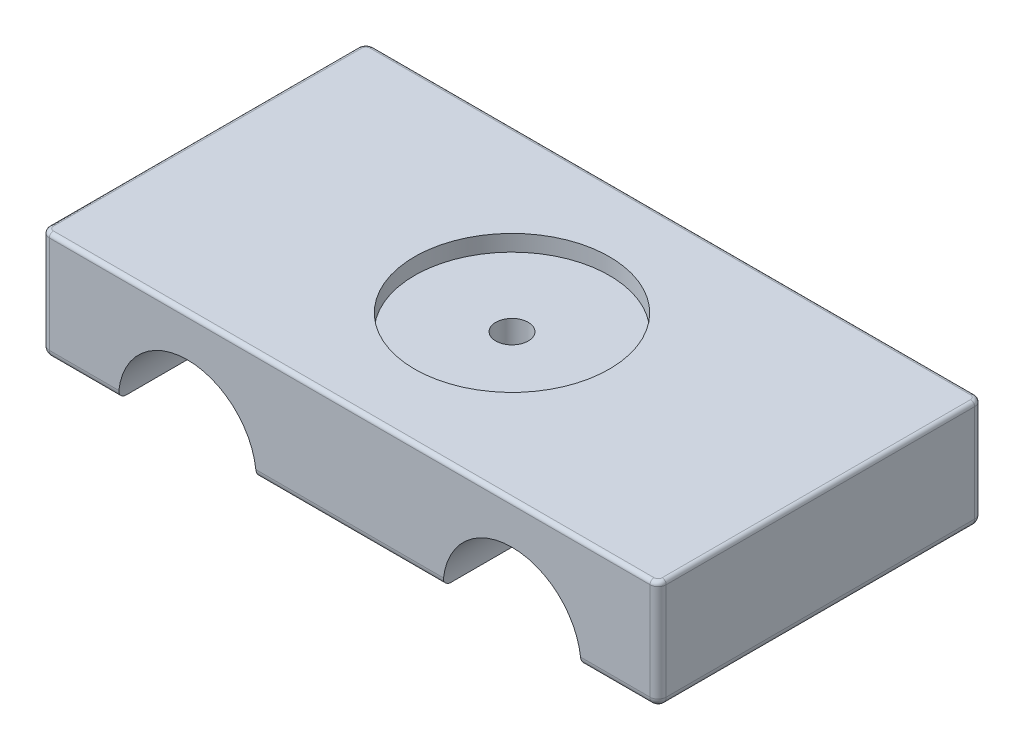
ISO-10303-21;
HEADER;
FILE_DESCRIPTION(('STEP AP214'),'2;1');
FILE_NAME('part.step','',(''),(''),'','','');
FILE_SCHEMA(('AUTOMOTIVE_DESIGN { 1 0 10303 214 1 1 1 1 }'));
ENDSEC;
DATA;
#1=APPLICATION_CONTEXT('core data for automotive mechanical design processes');
#2=APPLICATION_PROTOCOL_DEFINITION('international standard','automotive_design',2000,#1);
#3=PRODUCT_CONTEXT('',#1,'mechanical');
#4=PRODUCT('Part','Part','',(#3));
#5=PRODUCT_RELATED_PRODUCT_CATEGORY('part','',(#4));
#6=PRODUCT_DEFINITION_FORMATION('','',#4);
#7=PRODUCT_DEFINITION_CONTEXT('part definition',#1,'design');
#8=PRODUCT_DEFINITION('design','',#6,#7);
#9=PRODUCT_DEFINITION_SHAPE('','',#8);
#10=(LENGTH_UNIT() NAMED_UNIT(*) SI_UNIT(.MILLI.,.METRE.));
#11=(NAMED_UNIT(*) PLANE_ANGLE_UNIT() SI_UNIT($,.RADIAN.));
#12=(NAMED_UNIT(*) SI_UNIT($,.STERADIAN.) SOLID_ANGLE_UNIT());
#13=UNCERTAINTY_MEASURE_WITH_UNIT(LENGTH_MEASURE(1.E-05),#10,'distance_accuracy_value','');
#14=(GEOMETRIC_REPRESENTATION_CONTEXT(3) GLOBAL_UNCERTAINTY_ASSIGNED_CONTEXT((#13)) GLOBAL_UNIT_ASSIGNED_CONTEXT((#10,
#11,#12)) REPRESENTATION_CONTEXT('',''));
#15=CARTESIAN_POINT('',(0.,0.,0.));
#16=DIRECTION('',(0.,0.,1.));
#17=DIRECTION('',(1.,0.,0.));
#18=AXIS2_PLACEMENT_3D('',#15,#16,#17);
#19=CARTESIAN_POINT('',(0.,-75.,508.));
#20=DIRECTION('',(0.,1.,0.));
#21=DIRECTION('',(0.,0.,1.));
#22=AXIS2_PLACEMENT_3D('',#19,#20,#21);
#23=PLANE('',#22);
#24=DIRECTION('',(1.,0.,0.));
#25=VECTOR('',#24,1.);
#26=CARTESIAN_POINT('',(858.012,-75.,26.162));
#27=LINE('',#26,#25);
#28=CARTESIAN_POINT('',(858.012,-75.,26.162));
#29=VERTEX_POINT('',#28);
#30=CARTESIAN_POINT('',(939.038,-75.,26.162));
#31=VERTEX_POINT('',#30);
#32=EDGE_CURVE('E347',#29,#31,#27,.T.);
#33=ORIENTED_EDGE('',*,*,#32,.F.);
#34=DIRECTION('',(0.,0.,-1.));
#35=VECTOR('',#34,1.);
#36=CARTESIAN_POINT('',(858.012,-75.,481.838));
#37=LINE('',#36,#35);
#38=CARTESIAN_POINT('',(858.012,-75.,481.838));
#39=VERTEX_POINT('',#38);
#40=EDGE_CURVE('E321',#39,#29,#37,.T.);
#41=ORIENTED_EDGE('',*,*,#40,.F.);
#42=DIRECTION('',(-1.,0.,0.));
#43=VECTOR('',#42,1.);
#44=CARTESIAN_POINT('',(858.012,-75.,481.838));
#45=LINE('',#44,#43);
#46=CARTESIAN_POINT('',(939.038,-75.,481.838));
#47=VERTEX_POINT('',#46);
#48=EDGE_CURVE('E332',#47,#39,#45,.T.);
#49=ORIENTED_EDGE('',*,*,#48,.F.);
#50=DIRECTION('',(0.,0.,1.));
#51=VECTOR('',#50,1.);
#52=CARTESIAN_POINT('',(939.038,-75.,481.838));
#53=LINE('',#52,#51);
#54=EDGE_CURVE('E351',#31,#47,#53,.T.);
#55=ORIENTED_EDGE('',*,*,#54,.F.);
#56=EDGE_LOOP('',(#33,#41,#49,#55));
#57=FACE_BOUND('',#56,.T.);
#58=DIRECTION('',(0.,0.,-1.));
#59=VECTOR('',#58,1.);
#60=CARTESIAN_POINT('',(844.55,-75.,508.));
#61=LINE('',#60,#59);
#62=CARTESIAN_POINT('',(844.55,-75.,495.3));
#63=VERTEX_POINT('',#62);
#64=CARTESIAN_POINT('',(844.55,-75.,12.7));
#65=VERTEX_POINT('',#64);
#66=EDGE_CURVE('E438',#63,#65,#61,.T.);
#67=ORIENTED_EDGE('',*,*,#66,.T.);
#68=DIRECTION('',(1.,0.,0.));
#69=VECTOR('',#68,1.);
#70=CARTESIAN_POINT('',(0.,-75.,12.7));
#71=LINE('',#70,#69);
#72=CARTESIAN_POINT('',(952.5,-75.,12.7));
#73=VERTEX_POINT('',#72);
#74=EDGE_CURVE('E508',#65,#73,#71,.T.);
#75=ORIENTED_EDGE('',*,*,#74,.T.);
#76=DIRECTION('',(0.,0.,-1.));
#77=VECTOR('',#76,1.);
#78=CARTESIAN_POINT('',(952.5,-75.,508.));
#79=LINE('',#78,#77);
#80=CARTESIAN_POINT('',(952.5,-75.,495.3));
#81=VERTEX_POINT('',#80);
#82=EDGE_CURVE('E474',#81,#73,#79,.T.);
#83=ORIENTED_EDGE('',*,*,#82,.F.);
#84=DIRECTION('',(1.,0.,0.));
#85=VECTOR('',#84,1.);
#86=CARTESIAN_POINT('',(844.55,-75.,495.3));
#87=LINE('',#86,#85);
#88=EDGE_CURVE('E505',#81,#63,#87,.F.);
#89=ORIENTED_EDGE('',*,*,#88,.T.);
#90=EDGE_LOOP('',(#67,#75,#83,#89));
#91=FACE_BOUND('',#90,.T.);
#92=ADVANCED_FACE('F45',(#57,#91),#23,.F.);
#93=CARTESIAN_POINT('',(952.5,-62.3,508.));
#94=DIRECTION('',(0.,0.,-1.));
#95=DIRECTION('',(-1.,0.,0.));
#96=AXIS2_PLACEMENT_3D('',#93,#94,#95);
#97=CYLINDRICAL_SURFACE('',#96,12.7);
#98=ORIENTED_EDGE('',*,*,#82,.T.);
#99=CARTESIAN_POINT('',(952.5,-62.3,12.7));
#100=DIRECTION('',(0.,0.,-1.));
#101=DIRECTION('',(-1.,0.,0.));
#102=AXIS2_PLACEMENT_3D('',#99,#100,#101);
#103=CIRCLE('',#102,12.7);
#104=CARTESIAN_POINT('',(965.2,-62.2999999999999,12.7));
#105=VERTEX_POINT('',#104);
#106=EDGE_CURVE('E1267',#73,#105,#103,.F.);
#107=ORIENTED_EDGE('',*,*,#106,.T.);
#108=DIRECTION('',(0.,0.,-1.));
#109=VECTOR('',#108,1.);
#110=CARTESIAN_POINT('',(965.2,-62.2999999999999,508.));
#111=LINE('',#110,#109);
#112=CARTESIAN_POINT('',(965.2,-62.2999999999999,495.3));
#113=VERTEX_POINT('',#112);
#114=EDGE_CURVE('E470',#113,#105,#111,.T.);
#115=ORIENTED_EDGE('',*,*,#114,.F.);
#116=CARTESIAN_POINT('',(952.5,-62.3,495.3));
#117=DIRECTION('',(0.,0.,-1.));
#118=DIRECTION('',(-1.,0.,0.));
#119=AXIS2_PLACEMENT_3D('',#116,#117,#118);
#120=CIRCLE('',#119,12.7);
#121=EDGE_CURVE('E1260',#113,#81,#120,.T.);
#122=ORIENTED_EDGE('',*,*,#121,.T.);
#123=EDGE_LOOP('',(#98,#107,#115,#122));
#124=FACE_BOUND('',#123,.T.);
#125=ADVANCED_FACE('F639',(#124),#97,.T.);
#126=CARTESIAN_POINT('',(965.2,0.,508.));
#127=DIRECTION('',(-1.,0.,0.));
#128=DIRECTION('',(0.,0.,1.));
#129=AXIS2_PLACEMENT_3D('',#126,#127,#128);
#130=PLANE('',#129);
#131=DIRECTION('',(0.,1.,0.));
#132=VECTOR('',#131,1.);
#133=CARTESIAN_POINT('',(965.2,0.,12.7));
#134=LINE('',#133,#132);
#135=CARTESIAN_POINT('',(965.2,90.05,12.7));
#136=VERTEX_POINT('',#135);
#137=EDGE_CURVE('E681',#105,#136,#134,.T.);
#138=ORIENTED_EDGE('',*,*,#137,.T.);
#139=DIRECTION('',(0.,0.,-1.));
#140=VECTOR('',#139,1.);
#141=CARTESIAN_POINT('',(965.2,90.05,495.3));
#142=LINE('',#141,#140);
#143=CARTESIAN_POINT('',(965.2,90.05,495.3));
#144=VERTEX_POINT('',#143);
#145=EDGE_CURVE('E1335',#136,#144,#142,.F.);
#146=ORIENTED_EDGE('',*,*,#145,.T.);
#147=DIRECTION('',(0.,1.,0.));
#148=VECTOR('',#147,1.);
#149=CARTESIAN_POINT('',(965.2,-62.2999999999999,495.3));
#150=LINE('',#149,#148);
#151=EDGE_CURVE('E1282',#144,#113,#150,.F.);
#152=ORIENTED_EDGE('',*,*,#151,.T.);
#153=ORIENTED_EDGE('',*,*,#114,.T.);
#154=EDGE_LOOP('',(#138,#146,#152,#153));
#155=FACE_BOUND('',#154,.T.);
#156=ADVANCED_FACE('F644',(#155),#130,.F.);
#157=CARTESIAN_POINT('',(0.,96.4,508.));
#158=DIRECTION('',(0.,1.,0.));
#159=DIRECTION('',(0.,0.,1.));
#160=AXIS2_PLACEMENT_3D('',#157,#158,#159);
#161=PLANE('',#160);
#162=CARTESIAN_POINT('',(482.6,96.4,254.));
#163=DIRECTION('',(0.,1.,0.));
#164=DIRECTION('',(0.,0.,1.));
#165=AXIS2_PLACEMENT_3D('',#162,#163,#164);
#166=CIRCLE('',#165,152.4);
#167=CARTESIAN_POINT('',(482.6,96.4,406.4));
#168=VERTEX_POINT('',#167);
#169=EDGE_CURVE('E1424',#168,#168,#166,.T.);
#170=ORIENTED_EDGE('',*,*,#169,.F.);
#171=EDGE_LOOP('',(#170));
#172=FACE_BOUND('',#171,.T.);
#173=DIRECTION('',(0.,0.,-1.));
#174=VECTOR('',#173,1.);
#175=CARTESIAN_POINT('',(6.35,96.4,508.));
#176=LINE('',#175,#174);
#177=CARTESIAN_POINT('',(6.35,96.4,12.7));
#178=VERTEX_POINT('',#177);
#179=CARTESIAN_POINT('',(6.35,96.4,495.3));
#180=VERTEX_POINT('',#179);
#181=EDGE_CURVE('E699',#178,#180,#176,.F.);
#182=ORIENTED_EDGE('',*,*,#181,.T.);
#183=CARTESIAN_POINT('',(12.7,96.4,495.3));
#184=DIRECTION('',(0.,1.,0.));
#185=DIRECTION('',(0.,0.,1.));
#186=AXIS2_PLACEMENT_3D('',#183,#184,#185);
#187=CIRCLE('',#186,6.35);
#188=CARTESIAN_POINT('',(12.7,96.4,501.65));
#189=VERTEX_POINT('',#188);
#190=EDGE_CURVE('E1338',#180,#189,#187,.T.);
#191=ORIENTED_EDGE('',*,*,#190,.T.);
#192=DIRECTION('',(1.,0.,0.));
#193=VECTOR('',#192,1.);
#194=CARTESIAN_POINT('',(0.,96.4,501.65));
#195=LINE('',#194,#193);
#196=CARTESIAN_POINT('',(952.5,96.4,501.65));
#197=VERTEX_POINT('',#196);
#198=EDGE_CURVE('E1390',#189,#197,#195,.T.);
#199=ORIENTED_EDGE('',*,*,#198,.T.);
#200=CARTESIAN_POINT('',(952.5,96.4,495.3));
#201=DIRECTION('',(0.,1.,0.));
#202=DIRECTION('',(0.,0.,1.));
#203=AXIS2_PLACEMENT_3D('',#200,#201,#202);
#204=CIRCLE('',#203,6.35);
#205=CARTESIAN_POINT('',(958.85,96.4,495.3));
#206=VERTEX_POINT('',#205);
#207=EDGE_CURVE('E1322',#197,#206,#204,.T.);
#208=ORIENTED_EDGE('',*,*,#207,.T.);
#209=DIRECTION('',(0.,0.,-1.));
#210=VECTOR('',#209,1.);
#211=CARTESIAN_POINT('',(958.85,96.4,12.7));
#212=LINE('',#211,#210);
#213=CARTESIAN_POINT('',(958.85,96.4,12.7));
#214=VERTEX_POINT('',#213);
#215=EDGE_CURVE('E1385',#206,#214,#212,.T.);
#216=ORIENTED_EDGE('',*,*,#215,.T.);
#217=CARTESIAN_POINT('',(952.5,96.4,12.7));
#218=DIRECTION('',(0.,1.,0.));
#219=DIRECTION('',(0.,0.,1.));
#220=AXIS2_PLACEMENT_3D('',#217,#218,#219);
#221=CIRCLE('',#220,6.35);
#222=CARTESIAN_POINT('',(952.5,96.4,6.35));
#223=VERTEX_POINT('',#222);
#224=EDGE_CURVE('E1379',#214,#223,#221,.T.);
#225=ORIENTED_EDGE('',*,*,#224,.T.);
#226=DIRECTION('',(1.,0.,0.));
#227=VECTOR('',#226,1.);
#228=CARTESIAN_POINT('',(12.7,96.4,6.35));
#229=LINE('',#228,#227);
#230=CARTESIAN_POINT('',(12.7,96.4,6.35));
#231=VERTEX_POINT('',#230);
#232=EDGE_CURVE('E1375',#223,#231,#229,.F.);
#233=ORIENTED_EDGE('',*,*,#232,.T.);
#234=CARTESIAN_POINT('',(12.7,96.4,12.7));
#235=DIRECTION('',(0.,1.,0.));
#236=DIRECTION('',(0.,0.,1.));
#237=AXIS2_PLACEMENT_3D('',#234,#235,#236);
#238=CIRCLE('',#237,6.35);
#239=EDGE_CURVE('E1411',#231,#178,#238,.T.);
#240=ORIENTED_EDGE('',*,*,#239,.T.);
#241=EDGE_LOOP('',(#182,#191,#199,#208,#216,#225,#233,#240));
#242=FACE_BOUND('',#241,.T.);
#243=ADVANCED_FACE('F1225',(#172,#242),#161,.T.);
#244=CARTESIAN_POINT('',(0.,0.,508.));
#245=DIRECTION('',(-1.,0.,0.));
#246=DIRECTION('',(0.,0.,1.));
#247=AXIS2_PLACEMENT_3D('',#244,#245,#246);
#248=PLANE('',#247);
#249=DIRECTION('',(0.,1.,0.));
#250=VECTOR('',#249,1.);
#251=CARTESIAN_POINT('',(0.,0.,495.3));
#252=LINE('',#251,#250);
#253=CARTESIAN_POINT('',(0.,-62.2999999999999,495.3));
#254=VERTEX_POINT('',#253);
#255=CARTESIAN_POINT('',(0.,90.05,495.3));
#256=VERTEX_POINT('',#255);
#257=EDGE_CURVE('E493',#254,#256,#252,.T.);
#258=ORIENTED_EDGE('',*,*,#257,.T.);
#259=DIRECTION('',(0.,0.,-1.));
#260=VECTOR('',#259,1.);
#261=CARTESIAN_POINT('',(0.,90.05,508.));
#262=LINE('',#261,#260);
#263=CARTESIAN_POINT('',(0.,90.05,12.7));
#264=VERTEX_POINT('',#263);
#265=EDGE_CURVE('E11',#256,#264,#262,.T.);
#266=ORIENTED_EDGE('',*,*,#265,.T.);
#267=DIRECTION('',(0.,1.,0.));
#268=VECTOR('',#267,1.);
#269=CARTESIAN_POINT('',(0.,-62.2999999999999,12.7));
#270=LINE('',#269,#268);
#271=CARTESIAN_POINT('',(0.,-62.2999999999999,12.7));
#272=VERTEX_POINT('',#271);
#273=EDGE_CURVE('E496',#264,#272,#270,.F.);
#274=ORIENTED_EDGE('',*,*,#273,.T.);
#275=DIRECTION('',(0.,0.,-1.));
#276=VECTOR('',#275,1.);
#277=CARTESIAN_POINT('',(0.,-62.2999999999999,508.));
#278=LINE('',#277,#276);
#279=EDGE_CURVE('E466',#254,#272,#278,.T.);
#280=ORIENTED_EDGE('',*,*,#279,.F.);
#281=EDGE_LOOP('',(#258,#266,#274,#280));
#282=FACE_BOUND('',#281,.T.);
#283=ADVANCED_FACE('F1217',(#282),#248,.T.);
#284=CARTESIAN_POINT('',(12.7,-62.3,508.));
#285=DIRECTION('',(0.,0.,-1.));
#286=DIRECTION('',(-1.,0.,0.));
#287=AXIS2_PLACEMENT_3D('',#284,#285,#286);
#288=CYLINDRICAL_SURFACE('',#287,12.7);
#289=ORIENTED_EDGE('',*,*,#279,.T.);
#290=CARTESIAN_POINT('',(12.7,-62.3,12.7));
#291=DIRECTION('',(0.,0.,-1.));
#292=DIRECTION('',(-1.,0.,0.));
#293=AXIS2_PLACEMENT_3D('',#290,#291,#292);
#294=CIRCLE('',#293,12.7);
#295=CARTESIAN_POINT('',(12.7000000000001,-75.,12.7));
#296=VERTEX_POINT('',#295);
#297=EDGE_CURVE('E502',#272,#296,#294,.F.);
#298=ORIENTED_EDGE('',*,*,#297,.T.);
#299=DIRECTION('',(0.,0.,-1.));
#300=VECTOR('',#299,1.);
#301=CARTESIAN_POINT('',(12.7000000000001,-75.,508.));
#302=LINE('',#301,#300);
#303=CARTESIAN_POINT('',(12.7000000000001,-75.,495.3));
#304=VERTEX_POINT('',#303);
#305=EDGE_CURVE('E462',#304,#296,#302,.T.);
#306=ORIENTED_EDGE('',*,*,#305,.F.);
#307=CARTESIAN_POINT('',(12.7,-62.3,495.3));
#308=DIRECTION('',(0.,0.,-1.));
#309=DIRECTION('',(-1.,0.,0.));
#310=AXIS2_PLACEMENT_3D('',#307,#308,#309);
#311=CIRCLE('',#310,12.7);
#312=EDGE_CURVE('E499',#304,#254,#311,.T.);
#313=ORIENTED_EDGE('',*,*,#312,.T.);
#314=EDGE_LOOP('',(#289,#298,#306,#313));
#315=FACE_BOUND('',#314,.T.);
#316=ADVANCED_FACE('F574',(#315),#288,.T.);
#317=DIRECTION('',(1.,0.,0.));
#318=VECTOR('',#317,1.);
#319=CARTESIAN_POINT('',(26.1620000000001,-75.,26.162));
#320=LINE('',#319,#318);
#321=CARTESIAN_POINT('',(26.1620000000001,-75.,26.162));
#322=VERTEX_POINT('',#321);
#323=CARTESIAN_POINT('',(107.188,-75.,26.162));
#324=VERTEX_POINT('',#323);
#325=EDGE_CURVE('E311',#322,#324,#320,.T.);
#326=ORIENTED_EDGE('',*,*,#325,.F.);
#327=DIRECTION('',(0.,0.,-1.));
#328=VECTOR('',#327,1.);
#329=CARTESIAN_POINT('',(26.1620000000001,-75.,481.838));
#330=LINE('',#329,#328);
#331=CARTESIAN_POINT('',(26.1620000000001,-75.,481.838));
#332=VERTEX_POINT('',#331);
#333=EDGE_CURVE('E275',#332,#322,#330,.T.);
#334=ORIENTED_EDGE('',*,*,#333,.F.);
#335=DIRECTION('',(-1.,0.,0.));
#336=VECTOR('',#335,1.);
#337=CARTESIAN_POINT('',(26.1620000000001,-75.,481.838));
#338=LINE('',#337,#336);
#339=CARTESIAN_POINT('',(107.188,-75.,481.838));
#340=VERTEX_POINT('',#339);
#341=EDGE_CURVE('E295',#340,#332,#338,.T.);
#342=ORIENTED_EDGE('',*,*,#341,.F.);
#343=DIRECTION('',(0.,0.,1.));
#344=VECTOR('',#343,1.);
#345=CARTESIAN_POINT('',(107.188,-75.,481.838));
#346=LINE('',#345,#344);
#347=EDGE_CURVE('E299',#324,#340,#346,.T.);
#348=ORIENTED_EDGE('',*,*,#347,.F.);
#349=EDGE_LOOP('',(#326,#334,#342,#348));
#350=FACE_BOUND('',#349,.T.);
#351=ORIENTED_EDGE('',*,*,#305,.T.);
#352=DIRECTION('',(1.,0.,0.));
#353=VECTOR('',#352,1.);
#354=CARTESIAN_POINT('',(0.,-75.,12.7));
#355=LINE('',#354,#353);
#356=CARTESIAN_POINT('',(120.65,-75.,12.7));
#357=VERTEX_POINT('',#356);
#358=EDGE_CURVE('E560',#296,#357,#355,.T.);
#359=ORIENTED_EDGE('',*,*,#358,.T.);
#360=DIRECTION('',(0.,0.,-1.));
#361=VECTOR('',#360,1.);
#362=CARTESIAN_POINT('',(120.65,-75.,508.));
#363=LINE('',#362,#361);
#364=CARTESIAN_POINT('',(120.65,-75.,495.3));
#365=VERTEX_POINT('',#364);
#366=EDGE_CURVE('E458',#365,#357,#363,.T.);
#367=ORIENTED_EDGE('',*,*,#366,.F.);
#368=DIRECTION('',(1.,0.,0.));
#369=VECTOR('',#368,1.);
#370=CARTESIAN_POINT('',(12.7000000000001,-75.,495.3));
#371=LINE('',#370,#369);
#372=EDGE_CURVE('E1269',#365,#304,#371,.F.);
#373=ORIENTED_EDGE('',*,*,#372,.T.);
#374=EDGE_LOOP('',(#351,#359,#367,#373));
#375=FACE_BOUND('',#374,.T.);
#376=ADVANCED_FACE('F572',(#350,#375),#23,.F.);
#377=CARTESIAN_POINT('',(228.6,-75.,508.));
#378=DIRECTION('',(0.,0.,-1.));
#379=DIRECTION('',(-1.,0.,0.));
#380=AXIS2_PLACEMENT_3D('',#377,#378,#379);
#381=CYLINDRICAL_SURFACE('',#380,107.95);
#382=CARTESIAN_POINT('',(228.6,32.95,462.28));
#383=CARTESIAN_POINT('',(228.813800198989,32.9500003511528,462.279998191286));
#384=CARTESIAN_POINT('',(229.027571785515,32.9493635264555,462.289001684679));
#385=CARTESIAN_POINT('',(229.45366287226,32.9468347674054,462.32495084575));
#386=CARTESIAN_POINT('',(229.665981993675,32.9449425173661,462.351901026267));
#387=CARTESIAN_POINT('',(230.087762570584,32.9399536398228,462.423586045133));
#388=CARTESIAN_POINT('',(230.297221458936,32.9368559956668,462.468335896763));
#389=CARTESIAN_POINT('',(230.711689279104,32.9295429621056,462.575316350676));
#390=CARTESIAN_POINT('',(230.916696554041,32.9253271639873,462.63755334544));
#391=CARTESIAN_POINT('',(231.320539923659,32.9159020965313,462.778989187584));
#392=CARTESIAN_POINT('',(231.519381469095,32.9106937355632,462.85817253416));
#393=CARTESIAN_POINT('',(231.909754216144,32.8994262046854,463.033000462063));
#394=CARTESIAN_POINT('',(232.101282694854,32.8933667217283,463.128651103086));
#395=CARTESIAN_POINT('',(232.475520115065,32.8805723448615,463.335668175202));
#396=CARTESIAN_POINT('',(232.658232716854,32.8738377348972,463.44702800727));
#397=CARTESIAN_POINT('',(233.013639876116,32.8598809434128,463.684705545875));
#398=CARTESIAN_POINT('',(233.186334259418,32.8526587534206,463.811023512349));
#399=CARTESIAN_POINT('',(233.52075939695,32.8379186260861,464.07794083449));
#400=CARTESIAN_POINT('',(233.682471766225,32.830400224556,464.21856319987));
#401=CARTESIAN_POINT('',(233.99348460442,32.8152914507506,464.512925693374));
#402=CARTESIAN_POINT('',(234.142784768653,32.8077010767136,464.666666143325));
#403=CARTESIAN_POINT('',(234.427893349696,32.7926645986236,464.98615301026));
#404=CARTESIAN_POINT('',(234.563703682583,32.7852184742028,465.151897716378));
#405=CARTESIAN_POINT('',(234.820939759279,32.7706779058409,465.494301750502));
#406=CARTESIAN_POINT('',(234.942360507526,32.7635835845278,465.670964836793));
#407=CARTESIAN_POINT('',(235.169997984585,32.7499449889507,466.034061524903));
#408=CARTESIAN_POINT('',(235.276201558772,32.7434011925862,466.220503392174));
#409=CARTESIAN_POINT('',(235.472523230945,32.7310568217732,466.601699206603));
#410=CARTESIAN_POINT('',(235.5626411,32.7252562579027,466.79645327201));
#411=CARTESIAN_POINT('',(235.726140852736,32.714564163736,467.192882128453));
#412=CARTESIAN_POINT('',(235.799523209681,32.7096726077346,467.394556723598));
#413=CARTESIAN_POINT('',(235.92902808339,32.7009380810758,467.803400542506));
#414=CARTESIAN_POINT('',(235.985150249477,32.6970951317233,468.010569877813));
#415=CARTESIAN_POINT('',(236.079638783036,32.6905740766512,468.428530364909));
#416=CARTESIAN_POINT('',(236.118038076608,32.6878938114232,468.63931403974));
#417=CARTESIAN_POINT('',(236.176967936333,32.6837635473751,469.063451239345));
#418=CARTESIAN_POINT('',(236.19749231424,32.6823139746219,469.276805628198));
#419=CARTESIAN_POINT('',(236.220498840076,32.6806882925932,469.704448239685));
#420=CARTESIAN_POINT('',(236.222984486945,32.6805119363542,469.918736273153));
#421=CARTESIAN_POINT('',(236.209904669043,32.6814370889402,470.346761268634));
#422=CARTESIAN_POINT('',(236.194338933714,32.6825386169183,470.56049822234));
#423=CARTESIAN_POINT('',(236.145313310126,32.6859849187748,470.985505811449));
#424=CARTESIAN_POINT('',(236.111885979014,32.6883274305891,471.196780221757));
#425=CARTESIAN_POINT('',(236.027397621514,32.6941876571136,471.615761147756));
#426=CARTESIAN_POINT('',(235.976336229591,32.6977053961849,471.823467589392));
#427=CARTESIAN_POINT('',(235.856957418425,32.7058152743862,472.2337987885));
#428=CARTESIAN_POINT('',(235.788643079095,32.7104072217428,472.436424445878));
#429=CARTESIAN_POINT('',(235.635216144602,32.7205372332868,472.835268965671));
#430=CARTESIAN_POINT('',(235.550097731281,32.7260756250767,473.031485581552));
#431=CARTESIAN_POINT('',(235.363634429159,32.7379435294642,473.416156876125));
#432=CARTESIAN_POINT('',(235.262280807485,32.744273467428,473.604607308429));
#433=CARTESIAN_POINT('',(235.044060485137,32.7575451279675,473.972372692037));
#434=CARTESIAN_POINT('',(234.9271880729,32.7644870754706,474.151684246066));
#435=CARTESIAN_POINT('',(234.678809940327,32.7787828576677,474.499802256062));
#436=CARTESIAN_POINT('',(234.547306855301,32.786136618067,474.668610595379));
#437=CARTESIAN_POINT('',(234.270577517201,32.8010493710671,474.994571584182));
#438=CARTESIAN_POINT('',(234.125351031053,32.8086083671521,475.151724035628));
#439=CARTESIAN_POINT('',(233.821869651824,32.8237344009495,475.453591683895));
#440=CARTESIAN_POINT('',(233.663587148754,32.8313014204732,475.598279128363));
#441=CARTESIAN_POINT('',(233.335388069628,32.8462126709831,475.873810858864));
#442=CARTESIAN_POINT('',(233.165471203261,32.8535568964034,476.004654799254));
#443=CARTESIAN_POINT('',(232.815222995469,32.8678129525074,476.251548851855));
#444=CARTESIAN_POINT('',(232.634893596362,32.8747248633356,476.367601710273));
#445=CARTESIAN_POINT('',(232.265069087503,32.8879238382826,476.584134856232));
#446=CARTESIAN_POINT('',(232.075570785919,32.8942106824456,476.684609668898));
#447=CARTESIAN_POINT('',(231.495442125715,32.9118524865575,476.961446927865));
#448=CARTESIAN_POINT('',(231.092824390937,32.922003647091,477.113470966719));
#449=CARTESIAN_POINT('',(230.267671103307,32.9379052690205,477.347629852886));
#450=CARTESIAN_POINT('',(229.845135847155,32.9436557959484,477.429765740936));
#451=CARTESIAN_POINT('',(229.20629669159,32.9485090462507,477.498866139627));
#452=CARTESIAN_POINT('',(228.99262821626,32.9494985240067,477.512889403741));
#453=CARTESIAN_POINT('',(228.564889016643,32.9502054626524,477.522916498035));
#454=CARTESIAN_POINT('',(228.350818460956,32.9499233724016,477.518926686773));
#455=CARTESIAN_POINT('',(227.923752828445,32.9480932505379,477.492949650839));
#456=CARTESIAN_POINT('',(227.710757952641,32.9465449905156,477.470959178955));
#457=CARTESIAN_POINT('',(227.287386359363,32.9422269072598,477.409141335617));
#458=CARTESIAN_POINT('',(227.077009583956,32.939457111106,477.369314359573));
#459=CARTESIAN_POINT('',(226.660578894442,32.9327775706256,477.272158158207));
#460=CARTESIAN_POINT('',(226.45452086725,32.9288689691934,477.214846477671));
#461=CARTESIAN_POINT('',(226.047972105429,32.9200212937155,477.083119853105));
#462=CARTESIAN_POINT('',(225.847481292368,32.9150822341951,477.008705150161));
#463=CARTESIAN_POINT('',(225.453444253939,32.9043119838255,476.843288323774));
#464=CARTESIAN_POINT('',(225.259899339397,32.8984806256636,476.75228308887));
#465=CARTESIAN_POINT('',(224.881224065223,32.8860931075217,476.554376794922));
#466=CARTESIAN_POINT('',(224.696090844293,32.8795371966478,476.44748119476));
#467=CARTESIAN_POINT('',(224.335131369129,32.8658707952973,476.218313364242));
#468=CARTESIAN_POINT('',(224.159323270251,32.8587592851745,476.09601259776));
#469=CARTESIAN_POINT('',(223.818633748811,32.8441936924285,475.837062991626));
#470=CARTESIAN_POINT('',(223.653752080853,32.8367396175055,475.700414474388));
#471=CARTESIAN_POINT('',(223.336068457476,32.8216992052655,475.413728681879));
#472=CARTESIAN_POINT('',(223.183266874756,32.8141128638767,475.263690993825));
#473=CARTESIAN_POINT('',(222.890829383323,32.799022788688,474.951291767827));
#474=CARTESIAN_POINT('',(222.75119327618,32.7915190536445,474.788930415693));
#475=CARTESIAN_POINT('',(222.485809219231,32.7767919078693,474.452695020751));
#476=CARTESIAN_POINT('',(222.360089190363,32.7695690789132,474.278798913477));
#477=CARTESIAN_POINT('',(222.123792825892,32.7556274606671,473.921078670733));
#478=CARTESIAN_POINT('',(222.013210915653,32.7489084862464,473.737258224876));
#479=CARTESIAN_POINT('',(221.807888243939,32.7361606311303,473.360865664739));
#480=CARTESIAN_POINT('',(221.713153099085,32.7301319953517,473.168290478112));
#481=CARTESIAN_POINT('',(221.540280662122,32.7189415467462,472.775884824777));
#482=CARTESIAN_POINT('',(221.462137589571,32.7137794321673,472.576056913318));
#483=CARTESIAN_POINT('',(221.323020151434,32.7044703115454,472.170651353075));
#484=CARTESIAN_POINT('',(221.262033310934,32.7003225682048,471.965078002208));
#485=CARTESIAN_POINT('',(221.157593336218,32.6931558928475,471.54950993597));
#486=CARTESIAN_POINT('',(221.114139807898,32.6901369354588,471.339515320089));
#487=CARTESIAN_POINT('',(221.045078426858,32.6853140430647,470.916596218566));
#488=CARTESIAN_POINT('',(221.019470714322,32.6835101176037,470.703671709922));
#489=CARTESIAN_POINT('',(220.986287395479,32.6811690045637,470.276418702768));
#490=CARTESIAN_POINT('',(220.978711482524,32.680631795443,470.062090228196));
#491=CARTESIAN_POINT('',(220.981642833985,32.6808392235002,469.633988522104));
#492=CARTESIAN_POINT('',(220.992113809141,32.681581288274,469.420215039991));
#493=CARTESIAN_POINT('',(221.030986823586,32.684320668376,468.99438768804));
#494=CARTESIAN_POINT('',(221.059382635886,32.6863175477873,468.782333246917));
#495=CARTESIAN_POINT('',(221.133901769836,32.6915097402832,468.361337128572));
#496=CARTESIAN_POINT('',(221.18002836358,32.6947052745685,468.152396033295));
#497=CARTESIAN_POINT('',(221.289675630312,32.7022036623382,467.73915420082));
#498=CARTESIAN_POINT('',(221.353195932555,32.7065064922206,467.534853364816));
#499=CARTESIAN_POINT('',(221.49717501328,32.7160971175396,467.132335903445));
#500=CARTESIAN_POINT('',(221.577633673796,32.7213849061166,466.934119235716));
#501=CARTESIAN_POINT('',(221.754913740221,32.7327952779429,466.545172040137));
#502=CARTESIAN_POINT('',(221.851734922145,32.7389178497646,466.354441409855));
#503=CARTESIAN_POINT('',(222.061068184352,32.7518253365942,465.981779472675));
#504=CARTESIAN_POINT('',(222.173582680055,32.7586103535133,465.79984952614));
#505=CARTESIAN_POINT('',(222.413452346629,32.7726475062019,465.446162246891));
#506=CARTESIAN_POINT('',(222.540802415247,32.7798994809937,465.274401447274));
#507=CARTESIAN_POINT('',(222.809778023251,32.7946844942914,464.941817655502));
#508=CARTESIAN_POINT('',(222.951435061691,32.8022181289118,464.781020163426));
#509=CARTESIAN_POINT('',(223.247779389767,32.8173373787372,464.471927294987));
#510=CARTESIAN_POINT('',(223.402466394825,32.8249229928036,464.323631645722));
#511=CARTESIAN_POINT('',(223.723823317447,32.8399335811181,464.040549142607));
#512=CARTESIAN_POINT('',(223.890496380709,32.8473585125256,463.90576585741));
#513=CARTESIAN_POINT('',(224.234609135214,32.8618352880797,463.650709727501));
#514=CARTESIAN_POINT('',(224.412048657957,32.868887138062,463.530436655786));
#515=CARTESIAN_POINT('',(224.776744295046,32.8824293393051,463.305067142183));
#516=CARTESIAN_POINT('',(224.964016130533,32.8889187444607,463.199996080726));
#517=CARTESIAN_POINT('',(225.346705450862,32.9011362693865,463.006055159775));
#518=CARTESIAN_POINT('',(225.542119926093,32.9068646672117,462.917179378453));
#519=CARTESIAN_POINT('',(225.939604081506,32.9173956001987,462.756288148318));
#520=CARTESIAN_POINT('',(226.141667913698,32.9221989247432,462.684258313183));
#521=CARTESIAN_POINT('',(226.551100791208,32.930748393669,462.55749776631));
#522=CARTESIAN_POINT('',(226.758468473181,32.9344948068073,462.502762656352));
#523=CARTESIAN_POINT('',(227.235554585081,32.9417083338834,462.398147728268));
#524=CARTESIAN_POINT('',(227.506528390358,32.9448059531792,462.353882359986));
#525=CARTESIAN_POINT('',(228.051683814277,32.9489515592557,462.294809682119));
#526=CARTESIAN_POINT('',(228.325865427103,32.9499995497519,462.280002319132));
#527=CARTESIAN_POINT('',(228.6,32.95,462.28));
#528=B_SPLINE_CURVE_WITH_KNOTS('',3,(#382,#383,#384,#385,#386,#387,#388,#389,#390,#391,#392,
#393,#394,#395,#396,#397,#398,#399,#400,#401,#402,#403,#404,#405,#406,#407,#408,#409,#410,#411,
#412,#413,#414,#415,#416,#417,#418,#419,#420,#421,#422,#423,#424,#425,#426,#427,#428,#429,#430,
#431,#432,#433,#434,#435,#436,#437,#438,#439,#440,#441,#442,#443,#444,#445,#446,#447,#448,#449,
#450,#451,#452,#453,#454,#455,#456,#457,#458,#459,#460,#461,#462,#463,#464,#465,#466,#467,#468,
#469,#470,#471,#472,#473,#474,#475,#476,#477,#478,#479,#480,#481,#482,#483,#484,#485,#486,#487,
#488,#489,#490,#491,#492,#493,#494,#495,#496,#497,#498,#499,#500,#501,#502,#503,#504,#505,#506,
#507,#508,#509,#510,#511,#512,#513,#514,#515,#516,#517,#518,#519,#520,#521,#522,#523,#524,#525,
#526,#527),.UNSPECIFIED.,.T.,.F.,(4,2,2,2,2,2,2,2,2,2,2,2,2,2,2,2,2,2,2,2,2,2,2,2,2,2,2,2,2,2,2,
2,2,2,2,2,2,2,2,2,2,2,2,2,2,2,2,2,2,2,2,2,2,2,2,2,2,2,2,2,2,2,2,2,2,2,2,2,2,2,2,2,4),(0.,
0.641161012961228,1.28248331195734,1.92434769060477,2.56644701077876,3.20796149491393,
3.84971255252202,4.49119482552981,5.13268824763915,5.77523038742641,6.41778829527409,
7.06025480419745,7.70294370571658,8.34618487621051,8.98943520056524,9.63266733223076,
10.2759125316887,10.9179578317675,11.5602253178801,12.2023682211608,12.8445207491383,
13.485506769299,14.1265060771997,14.7673910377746,15.4084982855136,16.0499515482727,
16.69164155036,17.3332161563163,17.9748016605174,18.6177805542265,19.2607754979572,
19.903650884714,20.5467516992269,21.8316720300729,23.116573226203,23.7583278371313,
24.3998559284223,25.0414997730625,25.683129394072,26.3241172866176,26.965096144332,
27.606195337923,28.247074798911,28.8891593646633,29.5312295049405,30.1733194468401,
30.8153997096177,31.4587457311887,32.1018541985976,32.745190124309,33.3883015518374,
34.0309441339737,34.6735722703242,35.3162054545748,35.9588277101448,36.6001592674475,
37.2412681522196,37.8824954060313,38.5237089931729,39.1649181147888,39.8061184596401,
40.4474176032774,41.0884968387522,41.731019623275,42.3735283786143,43.0162063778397,
43.6588743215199,44.3026031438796,44.9460961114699,45.5890375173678,46.2318152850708,
47.0539132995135,47.8760098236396),.UNSPECIFIED.);
#529=CARTESIAN_POINT('',(228.6,32.95,462.28));
#530=VERTEX_POINT('',#529);
#531=EDGE_CURVE('E605',#530,#530,#528,.T.);
#532=ORIENTED_EDGE('',*,*,#531,.F.);
#533=EDGE_LOOP('',(#532));
#534=FACE_BOUND('',#533,.T.);
#535=CARTESIAN_POINT('',(228.6,32.95,30.48));
#536=CARTESIAN_POINT('',(228.813800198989,32.9500003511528,30.4799981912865));
#537=CARTESIAN_POINT('',(229.027571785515,32.9493635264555,30.4890016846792));
#538=CARTESIAN_POINT('',(229.45366287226,32.9468347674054,30.5249508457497));
#539=CARTESIAN_POINT('',(229.665981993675,32.9449425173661,30.5519010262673));
#540=CARTESIAN_POINT('',(230.087762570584,32.9399536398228,30.6235860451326));
#541=CARTESIAN_POINT('',(230.297221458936,32.9368559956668,30.6683358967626));
#542=CARTESIAN_POINT('',(230.711689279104,32.9295429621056,30.7753163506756));
#543=CARTESIAN_POINT('',(230.916696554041,32.9253271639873,30.8375533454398));
#544=CARTESIAN_POINT('',(231.320539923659,32.9159020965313,30.9789891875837));
#545=CARTESIAN_POINT('',(231.519381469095,32.9106937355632,31.0581725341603));
#546=CARTESIAN_POINT('',(231.909754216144,32.8994262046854,31.2330004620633));
#547=CARTESIAN_POINT('',(232.101282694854,32.8933667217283,31.3286511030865));
#548=CARTESIAN_POINT('',(232.475520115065,32.8805723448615,31.5356681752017));
#549=CARTESIAN_POINT('',(232.658232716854,32.8738377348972,31.6470280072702));
#550=CARTESIAN_POINT('',(233.013639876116,32.8598809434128,31.8847055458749));
#551=CARTESIAN_POINT('',(233.186334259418,32.8526587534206,32.0110235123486));
#552=CARTESIAN_POINT('',(233.52075939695,32.8379186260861,32.2779408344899));
#553=CARTESIAN_POINT('',(233.682471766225,32.830400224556,32.4185631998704));
#554=CARTESIAN_POINT('',(233.99348460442,32.8152914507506,32.7129256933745));
#555=CARTESIAN_POINT('',(234.142784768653,32.8077010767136,32.8666661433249));
#556=CARTESIAN_POINT('',(234.427893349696,32.7926645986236,33.1861530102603));
#557=CARTESIAN_POINT('',(234.563703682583,32.7852184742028,33.3518977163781));
#558=CARTESIAN_POINT('',(234.820939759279,32.7706779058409,33.6943017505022));
#559=CARTESIAN_POINT('',(234.942360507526,32.7635835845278,33.8709648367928));
#560=CARTESIAN_POINT('',(235.169997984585,32.7499449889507,34.2340615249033));
#561=CARTESIAN_POINT('',(235.276201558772,32.7434011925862,34.4205033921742));
#562=CARTESIAN_POINT('',(235.472523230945,32.7310568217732,34.8016992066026));
#563=CARTESIAN_POINT('',(235.5626411,32.7252562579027,34.9964532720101));
#564=CARTESIAN_POINT('',(235.726140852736,32.714564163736,35.3928821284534));
#565=CARTESIAN_POINT('',(235.799523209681,32.7096726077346,35.5945567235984));
#566=CARTESIAN_POINT('',(235.92902808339,32.7009380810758,36.003400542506));
#567=CARTESIAN_POINT('',(235.985150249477,32.6970951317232,36.2105698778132));
#568=CARTESIAN_POINT('',(236.079638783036,32.6905740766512,36.6285303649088));
#569=CARTESIAN_POINT('',(236.118038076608,32.6878938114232,36.8393140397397));
#570=CARTESIAN_POINT('',(236.176967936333,32.6837635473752,37.2634512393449));
#571=CARTESIAN_POINT('',(236.19749231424,32.6823139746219,37.4768056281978));
#572=CARTESIAN_POINT('',(236.220498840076,32.6806882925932,37.904448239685));
#573=CARTESIAN_POINT('',(236.222984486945,32.6805119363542,38.1187362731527));
#574=CARTESIAN_POINT('',(236.209904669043,32.6814370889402,38.5467612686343));
#575=CARTESIAN_POINT('',(236.194338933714,32.6825386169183,38.7604982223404));
#576=CARTESIAN_POINT('',(236.145313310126,32.6859849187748,39.1855058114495));
#577=CARTESIAN_POINT('',(236.111885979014,32.6883274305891,39.3967802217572));
#578=CARTESIAN_POINT('',(236.027397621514,32.6941876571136,39.8157611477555));
#579=CARTESIAN_POINT('',(235.976336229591,32.6977053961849,40.0234675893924));
#580=CARTESIAN_POINT('',(235.856957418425,32.7058152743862,40.4337987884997));
#581=CARTESIAN_POINT('',(235.788643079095,32.7104072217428,40.6364244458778));
#582=CARTESIAN_POINT('',(235.635216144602,32.7205372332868,41.0352689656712));
#583=CARTESIAN_POINT('',(235.550097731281,32.7260756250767,41.2314855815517));
#584=CARTESIAN_POINT('',(235.363634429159,32.7379435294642,41.6161568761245));
#585=CARTESIAN_POINT('',(235.262280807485,32.744273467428,41.8046073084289));
#586=CARTESIAN_POINT('',(235.044060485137,32.7575451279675,42.1723726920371));
#587=CARTESIAN_POINT('',(234.9271880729,32.7644870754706,42.3516842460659));
#588=CARTESIAN_POINT('',(234.678809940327,32.7787828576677,42.699802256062));
#589=CARTESIAN_POINT('',(234.547306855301,32.786136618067,42.8686105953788));
#590=CARTESIAN_POINT('',(234.270577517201,32.8010493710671,43.1945715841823));
#591=CARTESIAN_POINT('',(234.125351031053,32.8086083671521,43.3517240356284));
#592=CARTESIAN_POINT('',(233.821869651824,32.8237344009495,43.6535916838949));
#593=CARTESIAN_POINT('',(233.663587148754,32.8313014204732,43.7982791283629));
#594=CARTESIAN_POINT('',(233.335388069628,32.8462126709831,44.0738108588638));
#595=CARTESIAN_POINT('',(233.165471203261,32.8535568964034,44.2046547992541));
#596=CARTESIAN_POINT('',(232.815222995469,32.8678129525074,44.4515488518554));
#597=CARTESIAN_POINT('',(232.634893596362,32.8747248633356,44.5676017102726));
#598=CARTESIAN_POINT('',(232.265069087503,32.8879238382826,44.784134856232));
#599=CARTESIAN_POINT('',(232.075570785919,32.8942106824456,44.8846096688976));
#600=CARTESIAN_POINT('',(231.495442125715,32.9118524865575,45.1614469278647));
#601=CARTESIAN_POINT('',(231.092824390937,32.922003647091,45.3134709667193));
#602=CARTESIAN_POINT('',(230.267671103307,32.9379052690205,45.5476298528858));
#603=CARTESIAN_POINT('',(229.845135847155,32.9436557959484,45.6297657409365));
#604=CARTESIAN_POINT('',(229.20629669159,32.9485090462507,45.6988661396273));
#605=CARTESIAN_POINT('',(228.99262821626,32.9494985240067,45.7128894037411));
#606=CARTESIAN_POINT('',(228.564889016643,32.9502054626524,45.7229164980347));
#607=CARTESIAN_POINT('',(228.350818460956,32.9499233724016,45.7189266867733));
#608=CARTESIAN_POINT('',(227.923752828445,32.9480932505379,45.6929496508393));
#609=CARTESIAN_POINT('',(227.710757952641,32.9465449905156,45.6709591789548));
#610=CARTESIAN_POINT('',(227.287386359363,32.9422269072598,45.6091413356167));
#611=CARTESIAN_POINT('',(227.077009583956,32.939457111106,45.5693143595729));
#612=CARTESIAN_POINT('',(226.660578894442,32.9327775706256,45.4721581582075));
#613=CARTESIAN_POINT('',(226.45452086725,32.9288689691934,45.4148464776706));
#614=CARTESIAN_POINT('',(226.047972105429,32.9200212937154,45.2831198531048));
#615=CARTESIAN_POINT('',(225.847481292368,32.9150822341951,45.2087051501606));
#616=CARTESIAN_POINT('',(225.453444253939,32.9043119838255,45.0432883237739));
#617=CARTESIAN_POINT('',(225.259899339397,32.8984806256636,44.9522830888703));
#618=CARTESIAN_POINT('',(224.881224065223,32.8860931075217,44.7543767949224));
#619=CARTESIAN_POINT('',(224.696090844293,32.8795371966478,44.6474811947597));
#620=CARTESIAN_POINT('',(224.335131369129,32.8658707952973,44.4183133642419));
#621=CARTESIAN_POINT('',(224.159323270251,32.8587592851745,44.2960125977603));
#622=CARTESIAN_POINT('',(223.818633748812,32.8441936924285,44.0370629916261));
#623=CARTESIAN_POINT('',(223.653752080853,32.8367396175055,43.9004144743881));
#624=CARTESIAN_POINT('',(223.336068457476,32.8216992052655,43.6137286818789));
#625=CARTESIAN_POINT('',(223.183266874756,32.8141128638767,43.4636909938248));
#626=CARTESIAN_POINT('',(222.890829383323,32.799022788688,43.1512917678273));
#627=CARTESIAN_POINT('',(222.75119327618,32.7915190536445,42.9889304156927));
#628=CARTESIAN_POINT('',(222.485809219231,32.7767919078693,42.6526950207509));
#629=CARTESIAN_POINT('',(222.360089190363,32.7695690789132,42.4787989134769));
#630=CARTESIAN_POINT('',(222.123792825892,32.7556274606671,42.1210786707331));
#631=CARTESIAN_POINT('',(222.013210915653,32.7489084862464,41.9372582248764));
#632=CARTESIAN_POINT('',(221.807888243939,32.7361606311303,41.5608656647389));
#633=CARTESIAN_POINT('',(221.713153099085,32.7301319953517,41.3682904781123));
#634=CARTESIAN_POINT('',(221.540280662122,32.7189415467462,40.9758848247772));
#635=CARTESIAN_POINT('',(221.462137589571,32.7137794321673,40.776056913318));
#636=CARTESIAN_POINT('',(221.323020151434,32.7044703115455,40.3706513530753));
#637=CARTESIAN_POINT('',(221.262033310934,32.7003225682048,40.1650780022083));
#638=CARTESIAN_POINT('',(221.157593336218,32.6931558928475,39.7495099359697));
#639=CARTESIAN_POINT('',(221.114139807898,32.6901369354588,39.5395153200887));
#640=CARTESIAN_POINT('',(221.045078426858,32.6853140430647,39.1165962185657));
#641=CARTESIAN_POINT('',(221.019470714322,32.6835101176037,38.9036717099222));
#642=CARTESIAN_POINT('',(220.986287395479,32.6811690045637,38.4764187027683));
#643=CARTESIAN_POINT('',(220.978711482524,32.680631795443,38.2620902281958));
#644=CARTESIAN_POINT('',(220.981642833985,32.6808392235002,37.8339885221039));
#645=CARTESIAN_POINT('',(220.992113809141,32.681581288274,37.6202150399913));
#646=CARTESIAN_POINT('',(221.030986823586,32.684320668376,37.1943876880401));
#647=CARTESIAN_POINT('',(221.059382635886,32.6863175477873,36.9823332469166));
#648=CARTESIAN_POINT('',(221.133901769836,32.6915097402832,36.5613371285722));
#649=CARTESIAN_POINT('',(221.18002836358,32.6947052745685,36.352396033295));
#650=CARTESIAN_POINT('',(221.289675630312,32.7022036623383,35.9391542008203));
#651=CARTESIAN_POINT('',(221.353195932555,32.7065064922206,35.7348533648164));
#652=CARTESIAN_POINT('',(221.49717501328,32.7160971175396,35.3323359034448));
#653=CARTESIAN_POINT('',(221.577633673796,32.7213849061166,35.1341192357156));
#654=CARTESIAN_POINT('',(221.754913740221,32.7327952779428,34.7451720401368));
#655=CARTESIAN_POINT('',(221.851734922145,32.7389178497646,34.5544414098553));
#656=CARTESIAN_POINT('',(222.061068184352,32.7518253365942,34.1817794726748));
#657=CARTESIAN_POINT('',(222.173582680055,32.7586103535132,33.9998495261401));
#658=CARTESIAN_POINT('',(222.413452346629,32.7726475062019,33.6461622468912));
#659=CARTESIAN_POINT('',(222.540802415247,32.7798994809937,33.4744014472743));
#660=CARTESIAN_POINT('',(222.809778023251,32.7946844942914,33.1418176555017));
#661=CARTESIAN_POINT('',(222.951435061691,32.8022181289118,32.9810201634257));
#662=CARTESIAN_POINT('',(223.247779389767,32.8173373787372,32.6719272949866));
#663=CARTESIAN_POINT('',(223.402466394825,32.8249229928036,32.5236316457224));
#664=CARTESIAN_POINT('',(223.723823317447,32.8399335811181,32.2405491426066));
#665=CARTESIAN_POINT('',(223.890496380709,32.8473585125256,32.1057658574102));
#666=CARTESIAN_POINT('',(224.234609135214,32.8618352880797,31.850709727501));
#667=CARTESIAN_POINT('',(224.412048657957,32.868887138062,31.7304366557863));
#668=CARTESIAN_POINT('',(224.776744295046,32.8824293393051,31.5050671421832));
#669=CARTESIAN_POINT('',(224.964016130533,32.8889187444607,31.3999960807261));
#670=CARTESIAN_POINT('',(225.346705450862,32.9011362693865,31.2060551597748));
#671=CARTESIAN_POINT('',(225.542119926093,32.9068646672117,31.117179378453));
#672=CARTESIAN_POINT('',(225.939604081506,32.9173956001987,30.9562881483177));
#673=CARTESIAN_POINT('',(226.141667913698,32.9221989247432,30.8842583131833));
#674=CARTESIAN_POINT('',(226.551100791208,32.930748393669,30.7574977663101));
#675=CARTESIAN_POINT('',(226.758468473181,32.9344948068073,30.7027626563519));
#676=CARTESIAN_POINT('',(227.235554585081,32.9417083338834,30.5981477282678));
#677=CARTESIAN_POINT('',(227.506528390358,32.9448059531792,30.5538823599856));
#678=CARTESIAN_POINT('',(228.051683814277,32.9489515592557,30.4948096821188));
#679=CARTESIAN_POINT('',(228.325865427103,32.9499995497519,30.4800023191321));
#680=CARTESIAN_POINT('',(228.6,32.95,30.48));
#681=B_SPLINE_CURVE_WITH_KNOTS('',3,(#535,#536,#537,#538,#539,#540,#541,#542,#543,#544,#545,
#546,#547,#548,#549,#550,#551,#552,#553,#554,#555,#556,#557,#558,#559,#560,#561,#562,#563,#564,
#565,#566,#567,#568,#569,#570,#571,#572,#573,#574,#575,#576,#577,#578,#579,#580,#581,#582,#583,
#584,#585,#586,#587,#588,#589,#590,#591,#592,#593,#594,#595,#596,#597,#598,#599,#600,#601,#602,
#603,#604,#605,#606,#607,#608,#609,#610,#611,#612,#613,#614,#615,#616,#617,#618,#619,#620,#621,
#622,#623,#624,#625,#626,#627,#628,#629,#630,#631,#632,#633,#634,#635,#636,#637,#638,#639,#640,
#641,#642,#643,#644,#645,#646,#647,#648,#649,#650,#651,#652,#653,#654,#655,#656,#657,#658,#659,
#660,#661,#662,#663,#664,#665,#666,#667,#668,#669,#670,#671,#672,#673,#674,#675,#676,#677,#678,
#679,#680),.UNSPECIFIED.,.T.,.F.,(4,2,2,2,2,2,2,2,2,2,2,2,2,2,2,2,2,2,2,2,2,2,2,2,2,2,2,2,2,2,2,
2,2,2,2,2,2,2,2,2,2,2,2,2,2,2,2,2,2,2,2,2,2,2,2,2,2,2,2,2,2,2,2,2,2,2,2,2,2,2,2,2,4),(0.,
0.641161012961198,1.28248331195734,1.92434769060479,2.56644701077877,3.20796149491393,
3.84971255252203,4.49119482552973,5.13268824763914,5.77523038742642,6.41778829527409,
7.0602548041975,7.70294370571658,8.34618487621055,8.98943520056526,9.6326673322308,
10.2759125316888,10.9179578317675,11.5602253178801,12.2023682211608,12.8445207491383,
13.4855067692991,14.1265060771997,14.7673910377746,15.4084982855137,16.0499515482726,
16.69164155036,17.3332161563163,17.9748016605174,18.6177805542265,19.2607754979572,
19.903650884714,20.5467516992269,21.831672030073,23.1165732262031,23.7583278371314,
24.3998559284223,25.0414997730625,25.6831293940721,26.3241172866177,26.9650961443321,
27.6061953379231,28.247074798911,28.8891593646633,29.5312295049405,30.1733194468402,
30.8153997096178,31.4587457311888,32.1018541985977,32.745190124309,33.3883015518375,
34.0309441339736,34.6735722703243,35.3162054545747,35.9588277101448,36.6001592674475,
37.2412681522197,37.8824954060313,38.523708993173,39.1649181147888,39.8061184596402,
40.4474176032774,41.0884968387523,41.7310196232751,42.3735283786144,43.0162063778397,
43.65887432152,44.3026031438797,44.94609611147,45.5890375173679,46.2318152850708,
47.0539132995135,47.8760098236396),.UNSPECIFIED.);
#682=CARTESIAN_POINT('',(228.6,32.95,30.48));
#683=VERTEX_POINT('',#682);
#684=EDGE_CURVE('E597',#683,#683,#681,.T.);
#685=ORIENTED_EDGE('',*,*,#684,.F.);
#686=EDGE_LOOP('',(#685));
#687=FACE_BOUND('',#686,.T.);
#688=ORIENTED_EDGE('',*,*,#366,.T.);
#689=CARTESIAN_POINT('',(120.65,-75.,12.7));
#690=CARTESIAN_POINT('',(120.650013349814,-75.0000383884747,12.3428479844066));
#691=CARTESIAN_POINT('',(120.650000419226,-74.9849357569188,11.9857014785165));
#692=CARTESIAN_POINT('',(120.650018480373,-74.9247257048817,11.273962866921));
#693=CARTESIAN_POINT('',(120.650049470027,-74.8796197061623,10.9193706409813));
#694=CARTESIAN_POINT('',(120.650251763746,-74.7597239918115,10.2155071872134));
#695=CARTESIAN_POINT('',(120.65042296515,-74.6849560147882,9.86623225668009));
#696=CARTESIAN_POINT('',(120.651091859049,-74.5062802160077,9.1752222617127));
#697=CARTESIAN_POINT('',(120.651589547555,-74.4023727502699,8.83348710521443));
#698=CARTESIAN_POINT('',(120.653156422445,-74.1660940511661,8.15981323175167));
#699=CARTESIAN_POINT('',(120.654225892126,-74.0337087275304,7.82787945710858));
#700=CARTESIAN_POINT('',(120.657237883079,-73.7414481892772,7.17634727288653));
#701=CARTESIAN_POINT('',(120.65918040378,-73.5815729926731,6.8567488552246));
#702=CARTESIAN_POINT('',(120.664283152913,-73.2355017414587,6.23221584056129));
#703=CARTESIAN_POINT('',(120.667443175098,-73.0493101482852,5.92727876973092));
#704=CARTESIAN_POINT('',(120.675357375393,-72.6519172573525,5.33418516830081));
#705=CARTESIAN_POINT('',(120.680111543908,-72.4407161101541,5.04602853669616));
#706=CARTESIAN_POINT('',(120.691604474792,-71.9949480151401,4.48871291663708));
#707=CARTESIAN_POINT('',(120.698342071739,-71.7603948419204,4.21954288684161));
#708=CARTESIAN_POINT('',(120.714198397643,-71.2695040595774,3.70193239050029));
#709=CARTESIAN_POINT('',(120.723317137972,-71.0131663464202,3.45349202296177));
#710=CARTESIAN_POINT('',(120.744319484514,-70.4805188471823,2.97907798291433));
#711=CARTESIAN_POINT('',(120.756203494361,-70.2042061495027,2.75310759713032));
#712=CARTESIAN_POINT('',(120.783088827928,-69.6336501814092,2.32528482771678));
#713=CARTESIAN_POINT('',(120.798090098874,-69.3394072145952,2.12343203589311));
#714=CARTESIAN_POINT('',(120.831481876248,-68.7358050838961,1.74569120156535));
#715=CARTESIAN_POINT('',(120.849864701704,-68.4264813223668,1.56974591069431));
#716=CARTESIAN_POINT('',(120.890290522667,-67.794357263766,1.24450392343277));
#717=CARTESIAN_POINT('',(120.912333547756,-67.471556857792,1.09520744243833));
#718=CARTESIAN_POINT('',(120.960251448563,-66.8149346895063,0.82433511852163));
#719=CARTESIAN_POINT('',(120.986124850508,-66.4811172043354,0.70274865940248));
#720=CARTESIAN_POINT('',(121.041792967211,-65.8049038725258,0.488057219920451));
#721=CARTESIAN_POINT('',(121.071586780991,-65.4625100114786,0.394945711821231));
#722=CARTESIAN_POINT('',(121.145897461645,-64.6542949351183,0.211121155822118));
#723=CARTESIAN_POINT('',(121.191984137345,-64.1859278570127,0.13189014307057));
#724=CARTESIAN_POINT('',(121.266170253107,-63.4801207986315,0.052731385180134));
#725=CARTESIAN_POINT('',(121.291725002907,-63.2444496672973,0.0329597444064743));
#726=CARTESIAN_POINT('',(121.344476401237,-62.7725077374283,0.0065940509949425));
#727=CARTESIAN_POINT('',(121.371673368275,-62.5362368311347,2.56315941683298E-06));
#728=CARTESIAN_POINT('',(121.399661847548,-62.3,0.));
#729=B_SPLINE_CURVE_WITH_KNOTS('',3,(#689,#690,#691,#692,#693,#694,#695,#696,#697,#698,#699,
#700,#701,#702,#703,#704,#705,#706,#707,#708,#709,#710,#711,#712,#713,#714,#715,#716,#717,#718,
#719,#720,#721,#722,#723,#724,#725,#726,#727,#728),.UNSPECIFIED.,.F.,.F.,(4,2,2,2,2,2,2,2,2,2,2,
2,2,2,2,2,2,2,2,4),(0.,1.07112910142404,2.1422074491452,3.21250227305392,4.28278402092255,
5.3535965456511,6.42440836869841,7.49503887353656,8.5656629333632,9.63565916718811,
10.7056605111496,11.7758181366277,12.845957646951,13.9136957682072,14.9814425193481,
16.0487795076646,17.1158716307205,18.5441944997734,19.2575109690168,19.9709662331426),.UNSPECIFIED.);
#730=CARTESIAN_POINT('',(121.399661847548,-62.3,0.));
#731=VERTEX_POINT('',#730);
#732=EDGE_CURVE('E589',#357,#731,#729,.T.);
#733=ORIENTED_EDGE('',*,*,#732,.T.);
#734=CARTESIAN_POINT('',(228.6,-75.,0.));
#735=DIRECTION('',(0.,0.,1.));
#736=DIRECTION('',(1.,0.,0.));
#737=AXIS2_PLACEMENT_3D('',#734,#735,#736);
#738=CIRCLE('',#737,107.95);
#739=CARTESIAN_POINT('',(335.800338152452,-62.3,0.));
#740=VERTEX_POINT('',#739);
#741=EDGE_CURVE('E439',#740,#731,#738,.T.);
#742=ORIENTED_EDGE('',*,*,#741,.F.);
#743=CARTESIAN_POINT('',(335.800338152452,-62.3,0.));
#744=CARTESIAN_POINT('',(335.842351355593,-62.6544824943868,-3.90002745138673E-05));
#745=CARTESIAN_POINT('',(335.882572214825,-63.0091802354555,0.0148400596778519));
#746=CARTESIAN_POINT('',(335.959258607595,-63.7164892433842,0.0742624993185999));
#747=CARTESIAN_POINT('',(335.995724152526,-64.0691005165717,0.11880578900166));
#748=CARTESIAN_POINT('',(336.064706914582,-64.7694921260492,0.237346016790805));
#749=CARTESIAN_POINT('',(336.097226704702,-65.1172754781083,0.311323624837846));
#750=CARTESIAN_POINT('',(336.158297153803,-65.8057316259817,0.488278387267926));
#751=CARTESIAN_POINT('',(336.18684791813,-66.1464046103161,0.591254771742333));
#752=CARTESIAN_POINT('',(336.240038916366,-66.8184204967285,0.825632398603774));
#753=CARTESIAN_POINT('',(336.26467632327,-67.1497565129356,0.957054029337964));
#754=CARTESIAN_POINT('',(336.31014344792,-67.8004259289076,1.24739201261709));
#755=CARTESIAN_POINT('',(336.330973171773,-68.1197593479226,1.40630832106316));
#756=CARTESIAN_POINT('',(336.369025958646,-68.7440168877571,1.7504951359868));
#757=CARTESIAN_POINT('',(336.386249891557,-69.048944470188,1.93575926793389));
#758=CARTESIAN_POINT('',(336.417369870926,-69.6422472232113,2.33136784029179));
#759=CARTESIAN_POINT('',(336.431265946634,-69.9306225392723,2.54171206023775));
#760=CARTESIAN_POINT('',(336.456011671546,-70.4877140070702,2.98518474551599));
#761=CARTESIAN_POINT('',(336.466872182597,-70.7564976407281,3.21822784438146));
#762=CARTESIAN_POINT('',(336.48597485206,-71.273621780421,3.70608713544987));
#763=CARTESIAN_POINT('',(336.494217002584,-71.5219622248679,3.96090339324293));
#764=CARTESIAN_POINT('',(336.508469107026,-71.9964740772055,4.49056369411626));
#765=CARTESIAN_POINT('',(336.514478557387,-72.2226404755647,4.76541223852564));
#766=CARTESIAN_POINT('',(336.52465532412,-72.6511245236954,5.33313512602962));
#767=CARTESIAN_POINT('',(336.528822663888,-72.8534424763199,5.62600924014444));
#768=CARTESIAN_POINT('',(336.535706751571,-73.2331267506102,6.22824075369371));
#769=CARTESIAN_POINT('',(336.538420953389,-73.4104488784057,6.53762604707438));
#770=CARTESIAN_POINT('',(336.542753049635,-73.7384616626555,7.17021275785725));
#771=CARTESIAN_POINT('',(336.544370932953,-73.8891520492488,7.49341431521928));
#772=CARTESIAN_POINT('',(336.546840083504,-74.1627704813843,8.15121128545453));
#773=CARTESIAN_POINT('',(336.547691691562,-74.2857108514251,8.48580156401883));
#774=CARTESIAN_POINT('',(336.548910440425,-74.5030138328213,9.16399856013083));
#775=CARTESIAN_POINT('',(336.549277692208,-74.5973829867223,9.50760319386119));
#776=CARTESIAN_POINT('',(336.549839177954,-74.7843683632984,10.3210727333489));
#777=CARTESIAN_POINT('',(336.549930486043,-74.8652223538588,10.7937236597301));
#778=CARTESIAN_POINT('',(336.549989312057,-74.9460729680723,11.5066488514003));
#779=CARTESIAN_POINT('',(336.549995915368,-74.9662847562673,11.744820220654));
#780=CARTESIAN_POINT('',(336.550000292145,-74.993248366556,12.221973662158));
#781=CARTESIAN_POINT('',(336.549998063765,-74.9999973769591,12.4609558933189));
#782=CARTESIAN_POINT('',(336.55,-75.,12.7));
#783=B_SPLINE_CURVE_WITH_KNOTS('',3,(#743,#744,#745,#746,#747,#748,#749,#750,#751,#752,#753,
#754,#755,#756,#757,#758,#759,#760,#761,#762,#763,#764,#765,#766,#767,#768,#769,#770,#771,#772,
#773,#774,#775,#776,#777,#778,#779,#780,#781,#782),.UNSPECIFIED.,.F.,.F.,(4,2,2,2,2,2,2,2,2,2,2,
2,2,2,2,2,2,2,2,4),(0.,1.07058046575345,2.14115768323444,3.21103299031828,4.28087989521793,
5.35149617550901,6.4221107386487,7.49246671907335,8.56281329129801,9.62927943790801,
10.6957487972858,11.7624585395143,12.8291547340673,13.8977138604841,14.966283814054,
16.0343782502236,17.1022279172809,18.5372890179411,19.2540529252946,19.970966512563),.UNSPECIFIED.);
#784=CARTESIAN_POINT('',(336.55,-75.,12.7));
#785=VERTEX_POINT('',#784);
#786=EDGE_CURVE('E582',#740,#785,#783,.T.);
#787=ORIENTED_EDGE('',*,*,#786,.T.);
#788=DIRECTION('',(0.,0.,-1.));
#789=VECTOR('',#788,1.);
#790=CARTESIAN_POINT('',(336.55,-75.,508.));
#791=LINE('',#790,#789);
#792=CARTESIAN_POINT('',(336.55,-75.,495.3));
#793=VERTEX_POINT('',#792);
#794=EDGE_CURVE('E454',#793,#785,#791,.T.);
#795=ORIENTED_EDGE('',*,*,#794,.F.);
#796=CARTESIAN_POINT('',(336.55,-75.,495.3));
#797=CARTESIAN_POINT('',(336.549986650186,-75.0000383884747,495.657152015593));
#798=CARTESIAN_POINT('',(336.549999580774,-74.9849357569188,496.014298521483));
#799=CARTESIAN_POINT('',(336.549981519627,-74.9247257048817,496.726037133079));
#800=CARTESIAN_POINT('',(336.549950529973,-74.8796197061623,497.080629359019));
#801=CARTESIAN_POINT('',(336.549748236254,-74.7597239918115,497.784492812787));
#802=CARTESIAN_POINT('',(336.54957703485,-74.6849560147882,498.13376774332));
#803=CARTESIAN_POINT('',(336.548908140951,-74.5062802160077,498.824777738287));
#804=CARTESIAN_POINT('',(336.548410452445,-74.4023727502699,499.166512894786));
#805=CARTESIAN_POINT('',(336.546843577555,-74.1660940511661,499.840186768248));
#806=CARTESIAN_POINT('',(336.545774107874,-74.0337087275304,500.172120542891));
#807=CARTESIAN_POINT('',(336.542762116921,-73.7414481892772,500.823652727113));
#808=CARTESIAN_POINT('',(336.54081959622,-73.5815729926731,501.143251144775));
#809=CARTESIAN_POINT('',(336.535716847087,-73.2355017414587,501.767784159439));
#810=CARTESIAN_POINT('',(336.532556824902,-73.0493101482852,502.072721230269));
#811=CARTESIAN_POINT('',(336.524642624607,-72.6519172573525,502.665814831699));
#812=CARTESIAN_POINT('',(336.519888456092,-72.4407161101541,502.953971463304));
#813=CARTESIAN_POINT('',(336.508395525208,-71.9949480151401,503.511287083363));
#814=CARTESIAN_POINT('',(336.50165792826,-71.7603948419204,503.780457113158));
#815=CARTESIAN_POINT('',(336.485801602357,-71.2695040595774,504.2980676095));
#816=CARTESIAN_POINT('',(336.476682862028,-71.0131663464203,504.546507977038));
#817=CARTESIAN_POINT('',(336.455680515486,-70.4805188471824,505.020922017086));
#818=CARTESIAN_POINT('',(336.443796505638,-70.2042061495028,505.24689240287));
#819=CARTESIAN_POINT('',(336.416911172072,-69.6336501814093,505.674715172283));
#820=CARTESIAN_POINT('',(336.401909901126,-69.3394072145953,505.876567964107));
#821=CARTESIAN_POINT('',(336.368518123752,-68.7358050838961,506.254308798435));
#822=CARTESIAN_POINT('',(336.350135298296,-68.4264813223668,506.430254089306));
#823=CARTESIAN_POINT('',(336.309709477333,-67.7943572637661,506.755496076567));
#824=CARTESIAN_POINT('',(336.287666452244,-67.4715568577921,506.904792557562));
#825=CARTESIAN_POINT('',(336.239748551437,-66.8149346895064,507.175664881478));
#826=CARTESIAN_POINT('',(336.213875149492,-66.4811172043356,507.297251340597));
#827=CARTESIAN_POINT('',(336.158207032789,-65.8049038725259,507.511942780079));
#828=CARTESIAN_POINT('',(336.128413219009,-65.4625100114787,507.605054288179));
#829=CARTESIAN_POINT('',(336.054102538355,-64.6542949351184,507.788878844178));
#830=CARTESIAN_POINT('',(336.008015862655,-64.1859278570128,507.868109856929));
#831=CARTESIAN_POINT('',(335.933829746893,-63.4801207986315,507.94726861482));
#832=CARTESIAN_POINT('',(335.908274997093,-63.2444496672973,507.967040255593));
#833=CARTESIAN_POINT('',(335.855523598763,-62.7725077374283,507.993405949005));
#834=CARTESIAN_POINT('',(335.828326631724,-62.5362368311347,507.999997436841));
#835=CARTESIAN_POINT('',(335.800338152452,-62.3,508.));
#836=B_SPLINE_CURVE_WITH_KNOTS('',3,(#796,#797,#798,#799,#800,#801,#802,#803,#804,#805,#806,
#807,#808,#809,#810,#811,#812,#813,#814,#815,#816,#817,#818,#819,#820,#821,#822,#823,#824,#825,
#826,#827,#828,#829,#830,#831,#832,#833,#834,#835),.UNSPECIFIED.,.F.,.F.,(4,2,2,2,2,2,2,2,2,2,2,
2,2,2,2,2,2,2,2,4),(0.,1.071129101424,2.14220744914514,3.2125022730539,4.28278402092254,
5.35359654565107,6.42440836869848,7.49503887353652,8.56566293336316,9.6356591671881,
10.7056605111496,11.7758181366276,12.8459576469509,13.9136957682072,14.981442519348,
16.0487795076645,17.1158716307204,18.5441944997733,19.2575109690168,19.9709662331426),.UNSPECIFIED.);
#837=CARTESIAN_POINT('',(335.800338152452,-62.3,508.));
#838=VERTEX_POINT('',#837);
#839=EDGE_CURVE('E559',#793,#838,#836,.T.);
#840=ORIENTED_EDGE('',*,*,#839,.T.);
#841=CARTESIAN_POINT('',(228.6,-75.,508.));
#842=DIRECTION('',(0.,0.,1.));
#843=DIRECTION('',(1.,0.,0.));
#844=AXIS2_PLACEMENT_3D('',#841,#842,#843);
#845=CIRCLE('',#844,107.95);
#846=CARTESIAN_POINT('',(121.399661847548,-62.3,508.));
#847=VERTEX_POINT('',#846);
#848=EDGE_CURVE('E429',#838,#847,#845,.T.);
#849=ORIENTED_EDGE('',*,*,#848,.T.);
#850=CARTESIAN_POINT('',(121.399661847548,-62.3,508.));
#851=CARTESIAN_POINT('',(121.357648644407,-62.6544824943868,508.000039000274));
#852=CARTESIAN_POINT('',(121.317427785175,-63.0091802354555,507.985159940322));
#853=CARTESIAN_POINT('',(121.240741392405,-63.7164892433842,507.925737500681));
#854=CARTESIAN_POINT('',(121.204275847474,-64.0691005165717,507.881194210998));
#855=CARTESIAN_POINT('',(121.135293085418,-64.7694921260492,507.762653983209));
#856=CARTESIAN_POINT('',(121.102773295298,-65.1172754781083,507.688676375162));
#857=CARTESIAN_POINT('',(121.041702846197,-65.8057316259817,507.511721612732));
#858=CARTESIAN_POINT('',(121.01315208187,-66.1464046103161,507.408745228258));
#859=CARTESIAN_POINT('',(120.959961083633,-66.8184204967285,507.174367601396));
#860=CARTESIAN_POINT('',(120.93532367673,-67.1497565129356,507.042945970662));
#861=CARTESIAN_POINT('',(120.88985655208,-67.8004259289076,506.752607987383));
#862=CARTESIAN_POINT('',(120.869026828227,-68.1197593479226,506.593691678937));
#863=CARTESIAN_POINT('',(120.830974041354,-68.7440168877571,506.249504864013));
#864=CARTESIAN_POINT('',(120.813750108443,-69.048944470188,506.064240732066));
#865=CARTESIAN_POINT('',(120.782630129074,-69.6422472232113,505.668632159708));
#866=CARTESIAN_POINT('',(120.768734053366,-69.9306225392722,505.458287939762));
#867=CARTESIAN_POINT('',(120.743988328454,-70.4877140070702,505.014815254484));
#868=CARTESIAN_POINT('',(120.733127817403,-70.7564976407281,504.781772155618));
#869=CARTESIAN_POINT('',(120.71402514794,-71.273621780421,504.29391286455));
#870=CARTESIAN_POINT('',(120.705782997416,-71.5219622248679,504.039096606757));
#871=CARTESIAN_POINT('',(120.691530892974,-71.9964740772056,503.509436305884));
#872=CARTESIAN_POINT('',(120.685521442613,-72.2226404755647,503.234587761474));
#873=CARTESIAN_POINT('',(120.675344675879,-72.6511245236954,502.66686487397));
#874=CARTESIAN_POINT('',(120.671177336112,-72.8534424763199,502.373990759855));
#875=CARTESIAN_POINT('',(120.664293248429,-73.2331267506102,501.771759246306));
#876=CARTESIAN_POINT('',(120.661579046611,-73.4104488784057,501.462373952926));
#877=CARTESIAN_POINT('',(120.657246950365,-73.7384616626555,500.829787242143));
#878=CARTESIAN_POINT('',(120.655629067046,-73.8891520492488,500.506585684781));
#879=CARTESIAN_POINT('',(120.653159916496,-74.1627704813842,499.848788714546));
#880=CARTESIAN_POINT('',(120.652308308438,-74.2857108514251,499.514198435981));
#881=CARTESIAN_POINT('',(120.651089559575,-74.5030138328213,498.836001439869));
#882=CARTESIAN_POINT('',(120.650722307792,-74.5973829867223,498.492396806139));
#883=CARTESIAN_POINT('',(120.650160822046,-74.7843683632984,497.678927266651));
#884=CARTESIAN_POINT('',(120.650069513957,-74.8652223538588,497.20627634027));
#885=CARTESIAN_POINT('',(120.650010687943,-74.9460729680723,496.4933511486));
#886=CARTESIAN_POINT('',(120.650004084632,-74.9662847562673,496.255179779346));
#887=CARTESIAN_POINT('',(120.649999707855,-74.993248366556,495.778026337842));
#888=CARTESIAN_POINT('',(120.650001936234,-74.9999973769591,495.539044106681));
#889=CARTESIAN_POINT('',(120.65,-75.,495.3));
#890=B_SPLINE_CURVE_WITH_KNOTS('',3,(#850,#851,#852,#853,#854,#855,#856,#857,#858,#859,#860,
#861,#862,#863,#864,#865,#866,#867,#868,#869,#870,#871,#872,#873,#874,#875,#876,#877,#878,#879,
#880,#881,#882,#883,#884,#885,#886,#887,#888,#889),.UNSPECIFIED.,.F.,.F.,(4,2,2,2,2,2,2,2,2,2,2,
2,2,2,2,2,2,2,2,4),(0.,1.07058046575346,2.14115768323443,3.21103299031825,4.28087989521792,
5.35149617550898,6.42211073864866,7.49246671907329,8.56281329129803,9.62927943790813,
10.6957487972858,11.7624585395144,12.8291547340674,13.8977138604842,14.966283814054,
16.0343782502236,17.1022279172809,18.5372890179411,19.2540529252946,19.9709665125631),.UNSPECIFIED.);
#891=EDGE_CURVE('E550',#847,#365,#890,.T.);
#892=ORIENTED_EDGE('',*,*,#891,.T.);
#893=EDGE_LOOP('',(#688,#733,#742,#787,#795,#840,#849,#892));
#894=FACE_BOUND('',#893,.T.);
#895=ADVANCED_FACE('F567',(#534,#687,#894),#381,.F.);
#896=DIRECTION('',(0.,0.,-1.));
#897=VECTOR('',#896,1.);
#898=CARTESIAN_POINT('',(615.188,-75.,481.838));
#899=LINE('',#898,#897);
#900=CARTESIAN_POINT('',(615.188,-75.,481.838));
#901=VERTEX_POINT('',#900);
#902=CARTESIAN_POINT('',(615.188,-75.,26.162));
#903=VERTEX_POINT('',#902);
#904=EDGE_CURVE('E389',#901,#903,#899,.T.);
#905=ORIENTED_EDGE('',*,*,#904,.T.);
#906=DIRECTION('',(1.,0.,0.));
#907=VECTOR('',#906,1.);
#908=CARTESIAN_POINT('',(350.012,-75.,26.162));
#909=LINE('',#908,#907);
#910=CARTESIAN_POINT('',(350.012,-75.,26.162));
#911=VERTEX_POINT('',#910);
#912=EDGE_CURVE('E361',#911,#903,#909,.T.);
#913=ORIENTED_EDGE('',*,*,#912,.F.);
#914=DIRECTION('',(0.,0.,-1.));
#915=VECTOR('',#914,1.);
#916=CARTESIAN_POINT('',(350.012,-75.,481.838));
#917=LINE('',#916,#915);
#918=CARTESIAN_POINT('',(350.012,-75.,481.838));
#919=VERTEX_POINT('',#918);
#920=EDGE_CURVE('E376',#919,#911,#917,.T.);
#921=ORIENTED_EDGE('',*,*,#920,.F.);
#922=DIRECTION('',(1.,0.,0.));
#923=VECTOR('',#922,1.);
#924=CARTESIAN_POINT('',(350.012,-75.,481.838));
#925=LINE('',#924,#923);
#926=EDGE_CURVE('E393',#919,#901,#925,.T.);
#927=ORIENTED_EDGE('',*,*,#926,.T.);
#928=EDGE_LOOP('',(#905,#913,#921,#927));
#929=FACE_BOUND('',#928,.T.);
#930=ORIENTED_EDGE('',*,*,#794,.T.);
#931=DIRECTION('',(1.,0.,0.));
#932=VECTOR('',#931,1.);
#933=CARTESIAN_POINT('',(0.,-75.,12.7));
#934=LINE('',#933,#932);
#935=CARTESIAN_POINT('',(628.65,-75.,12.7));
#936=VERTEX_POINT('',#935);
#937=EDGE_CURVE('E664',#785,#936,#934,.T.);
#938=ORIENTED_EDGE('',*,*,#937,.T.);
#939=DIRECTION('',(0.,0.,-1.));
#940=VECTOR('',#939,1.);
#941=CARTESIAN_POINT('',(628.65,-75.,508.));
#942=LINE('',#941,#940);
#943=CARTESIAN_POINT('',(628.65,-75.,495.3));
#944=VERTEX_POINT('',#943);
#945=EDGE_CURVE('E450',#944,#936,#942,.T.);
#946=ORIENTED_EDGE('',*,*,#945,.F.);
#947=DIRECTION('',(1.,0.,0.));
#948=VECTOR('',#947,1.);
#949=CARTESIAN_POINT('',(336.55,-75.,495.3));
#950=LINE('',#949,#948);
#951=EDGE_CURVE('E666',#944,#793,#950,.F.);
#952=ORIENTED_EDGE('',*,*,#951,.T.);
#953=EDGE_LOOP('',(#930,#938,#946,#952));
#954=FACE_BOUND('',#953,.T.);
#955=ADVANCED_FACE('F571',(#929,#954),#23,.F.);
#956=CARTESIAN_POINT('',(736.6,-75.,508.));
#957=DIRECTION('',(0.,0.,-1.));
#958=DIRECTION('',(-1.,0.,0.));
#959=AXIS2_PLACEMENT_3D('',#956,#957,#958);
#960=CYLINDRICAL_SURFACE('',#959,107.95);
#961=CARTESIAN_POINT('',(736.6,32.95,30.48));
#962=CARTESIAN_POINT('',(736.813800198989,32.9500003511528,30.4799981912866));
#963=CARTESIAN_POINT('',(737.027571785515,32.9493635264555,30.4890016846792));
#964=CARTESIAN_POINT('',(737.45366287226,32.9468347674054,30.5249508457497));
#965=CARTESIAN_POINT('',(737.665981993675,32.9449425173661,30.5519010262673));
#966=CARTESIAN_POINT('',(738.087762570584,32.9399536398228,30.6235860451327));
#967=CARTESIAN_POINT('',(738.297221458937,32.9368559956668,30.6683358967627));
#968=CARTESIAN_POINT('',(738.711689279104,32.9295429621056,30.7753163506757));
#969=CARTESIAN_POINT('',(738.916696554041,32.9253271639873,30.8375533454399));
#970=CARTESIAN_POINT('',(739.320539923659,32.9159020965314,30.9789891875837));
#971=CARTESIAN_POINT('',(739.519381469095,32.9106937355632,31.0581725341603));
#972=CARTESIAN_POINT('',(739.909754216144,32.8994262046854,31.2330004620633));
#973=CARTESIAN_POINT('',(740.101282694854,32.8933667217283,31.3286511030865));
#974=CARTESIAN_POINT('',(740.475520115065,32.8805723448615,31.5356681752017));
#975=CARTESIAN_POINT('',(740.658232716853,32.8738377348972,31.6470280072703));
#976=CARTESIAN_POINT('',(741.013639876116,32.8598809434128,31.8847055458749));
#977=CARTESIAN_POINT('',(741.186334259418,32.8526587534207,32.0110235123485));
#978=CARTESIAN_POINT('',(741.52075939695,32.8379186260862,32.2779408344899));
#979=CARTESIAN_POINT('',(741.682471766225,32.8304002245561,32.4185631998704));
#980=CARTESIAN_POINT('',(741.99348460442,32.8152914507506,32.7129256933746));
#981=CARTESIAN_POINT('',(742.142784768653,32.8077010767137,32.866666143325));
#982=CARTESIAN_POINT('',(742.427893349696,32.7926645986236,33.1861530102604));
#983=CARTESIAN_POINT('',(742.563703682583,32.7852184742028,33.3518977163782));
#984=CARTESIAN_POINT('',(742.820939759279,32.7706779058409,33.6943017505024));
#985=CARTESIAN_POINT('',(742.942360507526,32.7635835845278,33.8709648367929));
#986=CARTESIAN_POINT('',(743.169997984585,32.7499449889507,34.2340615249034));
#987=CARTESIAN_POINT('',(743.276201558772,32.7434011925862,34.4205033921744));
#988=CARTESIAN_POINT('',(743.472523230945,32.7310568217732,34.8016992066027));
#989=CARTESIAN_POINT('',(743.562641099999,32.7252562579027,34.9964532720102));
#990=CARTESIAN_POINT('',(743.726140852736,32.714564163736,35.3928821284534));
#991=CARTESIAN_POINT('',(743.799523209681,32.7096726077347,35.5945567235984));
#992=CARTESIAN_POINT('',(743.92902808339,32.7009380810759,36.003400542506));
#993=CARTESIAN_POINT('',(743.985150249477,32.6970951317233,36.2105698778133));
#994=CARTESIAN_POINT('',(744.079638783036,32.6905740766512,36.6285303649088));
#995=CARTESIAN_POINT('',(744.118038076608,32.6878938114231,36.8393140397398));
#996=CARTESIAN_POINT('',(744.176967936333,32.6837635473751,37.2634512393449));
#997=CARTESIAN_POINT('',(744.19749231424,32.6823139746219,37.4768056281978));
#998=CARTESIAN_POINT('',(744.220498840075,32.6806882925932,37.904448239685));
#999=CARTESIAN_POINT('',(744.222984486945,32.6805119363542,38.1187362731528));
#1000=CARTESIAN_POINT('',(744.209904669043,32.6814370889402,38.5467612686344));
#1001=CARTESIAN_POINT('',(744.194338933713,32.6825386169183,38.7604982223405));
#1002=CARTESIAN_POINT('',(744.145313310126,32.6859849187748,39.1855058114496));
#1003=CARTESIAN_POINT('',(744.111885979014,32.6883274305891,39.3967802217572));
#1004=CARTESIAN_POINT('',(744.027397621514,32.6941876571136,39.8157611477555));
#1005=CARTESIAN_POINT('',(743.976336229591,32.697705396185,40.0234675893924));
#1006=CARTESIAN_POINT('',(743.856957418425,32.7058152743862,40.4337987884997));
#1007=CARTESIAN_POINT('',(743.788643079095,32.7104072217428,40.6364244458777));
#1008=CARTESIAN_POINT('',(743.635216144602,32.7205372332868,41.0352689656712));
#1009=CARTESIAN_POINT('',(743.550097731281,32.7260756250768,41.2314855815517));
#1010=CARTESIAN_POINT('',(743.363634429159,32.7379435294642,41.6161568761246));
#1011=CARTESIAN_POINT('',(743.262280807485,32.744273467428,41.8046073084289));
#1012=CARTESIAN_POINT('',(743.044060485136,32.7575451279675,42.172372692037));
#1013=CARTESIAN_POINT('',(742.9271880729,32.7644870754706,42.3516842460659));
#1014=CARTESIAN_POINT('',(742.678809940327,32.7787828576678,42.6998022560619));
#1015=CARTESIAN_POINT('',(742.547306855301,32.786136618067,42.8686105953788));
#1016=CARTESIAN_POINT('',(742.270577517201,32.8010493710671,43.1945715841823));
#1017=CARTESIAN_POINT('',(742.125351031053,32.8086083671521,43.3517240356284));
#1018=CARTESIAN_POINT('',(741.821869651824,32.8237344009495,43.6535916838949));
#1019=CARTESIAN_POINT('',(741.663587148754,32.8313014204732,43.7982791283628));
#1020=CARTESIAN_POINT('',(741.335388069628,32.8462126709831,44.0738108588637));
#1021=CARTESIAN_POINT('',(741.165471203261,32.8535568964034,44.2046547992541));
#1022=CARTESIAN_POINT('',(740.815222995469,32.8678129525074,44.4515488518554));
#1023=CARTESIAN_POINT('',(740.634893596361,32.8747248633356,44.5676017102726));
#1024=CARTESIAN_POINT('',(740.265069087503,32.8879238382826,44.7841348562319));
#1025=CARTESIAN_POINT('',(740.075570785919,32.8942106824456,44.8846096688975));
#1026=CARTESIAN_POINT('',(739.495442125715,32.9118524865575,45.1614469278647));
#1027=CARTESIAN_POINT('',(739.092824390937,32.922003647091,45.3134709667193));
#1028=CARTESIAN_POINT('',(738.267671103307,32.9379052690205,45.5476298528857));
#1029=CARTESIAN_POINT('',(737.845135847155,32.9436557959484,45.6297657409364));
#1030=CARTESIAN_POINT('',(737.20629669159,32.9485090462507,45.6988661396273));
#1031=CARTESIAN_POINT('',(736.99262821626,32.9494985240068,45.712889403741));
#1032=CARTESIAN_POINT('',(736.564889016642,32.9502054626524,45.7229164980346));
#1033=CARTESIAN_POINT('',(736.350818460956,32.9499233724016,45.7189266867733));
#1034=CARTESIAN_POINT('',(735.923752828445,32.9480932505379,45.6929496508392));
#1035=CARTESIAN_POINT('',(735.710757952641,32.9465449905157,45.6709591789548));
#1036=CARTESIAN_POINT('',(735.287386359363,32.9422269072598,45.6091413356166));
#1037=CARTESIAN_POINT('',(735.077009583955,32.939457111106,45.5693143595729));
#1038=CARTESIAN_POINT('',(734.660578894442,32.9327775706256,45.4721581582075));
#1039=CARTESIAN_POINT('',(734.45452086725,32.9288689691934,45.4148464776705));
#1040=CARTESIAN_POINT('',(734.047972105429,32.9200212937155,45.2831198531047));
#1041=CARTESIAN_POINT('',(733.847481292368,32.9150822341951,45.2087051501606));
#1042=CARTESIAN_POINT('',(733.453444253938,32.9043119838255,45.0432883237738));
#1043=CARTESIAN_POINT('',(733.259899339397,32.8984806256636,44.9522830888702));
#1044=CARTESIAN_POINT('',(732.881224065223,32.8860931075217,44.7543767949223));
#1045=CARTESIAN_POINT('',(732.696090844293,32.8795371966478,44.6474811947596));
#1046=CARTESIAN_POINT('',(732.335131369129,32.8658707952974,44.4183133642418));
#1047=CARTESIAN_POINT('',(732.159323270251,32.8587592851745,44.2960125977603));
#1048=CARTESIAN_POINT('',(731.818633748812,32.8441936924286,44.0370629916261));
#1049=CARTESIAN_POINT('',(731.653752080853,32.8367396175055,43.900414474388));
#1050=CARTESIAN_POINT('',(731.336068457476,32.8216992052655,43.6137286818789));
#1051=CARTESIAN_POINT('',(731.183266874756,32.8141128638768,43.4636909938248));
#1052=CARTESIAN_POINT('',(730.890829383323,32.799022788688,43.1512917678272));
#1053=CARTESIAN_POINT('',(730.75119327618,32.7915190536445,42.9889304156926));
#1054=CARTESIAN_POINT('',(730.485809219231,32.7767919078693,42.6526950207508));
#1055=CARTESIAN_POINT('',(730.360089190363,32.7695690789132,42.4787989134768));
#1056=CARTESIAN_POINT('',(730.123792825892,32.7556274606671,42.121078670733));
#1057=CARTESIAN_POINT('',(730.013210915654,32.7489084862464,41.9372582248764));
#1058=CARTESIAN_POINT('',(729.807888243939,32.7361606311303,41.5608656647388));
#1059=CARTESIAN_POINT('',(729.713153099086,32.7301319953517,41.3682904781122));
#1060=CARTESIAN_POINT('',(729.540280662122,32.7189415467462,40.9758848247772));
#1061=CARTESIAN_POINT('',(729.462137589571,32.7137794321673,40.776056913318));
#1062=CARTESIAN_POINT('',(729.323020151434,32.7044703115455,40.3706513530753));
#1063=CARTESIAN_POINT('',(729.262033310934,32.7003225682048,40.1650780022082));
#1064=CARTESIAN_POINT('',(729.157593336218,32.6931558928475,39.7495099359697));
#1065=CARTESIAN_POINT('',(729.114139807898,32.6901369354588,39.5395153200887));
#1066=CARTESIAN_POINT('',(729.045078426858,32.6853140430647,39.1165962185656));
#1067=CARTESIAN_POINT('',(729.019470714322,32.6835101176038,38.9036717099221));
#1068=CARTESIAN_POINT('',(728.986287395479,32.6811690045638,38.4764187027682));
#1069=CARTESIAN_POINT('',(728.978711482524,32.680631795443,38.2620902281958));
#1070=CARTESIAN_POINT('',(728.981642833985,32.6808392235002,37.8339885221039));
#1071=CARTESIAN_POINT('',(728.992113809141,32.681581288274,37.6202150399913));
#1072=CARTESIAN_POINT('',(729.030986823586,32.684320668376,37.19438768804));
#1073=CARTESIAN_POINT('',(729.059382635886,32.6863175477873,36.9823332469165));
#1074=CARTESIAN_POINT('',(729.133901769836,32.6915097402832,36.5613371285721));
#1075=CARTESIAN_POINT('',(729.18002836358,32.6947052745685,36.3523960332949));
#1076=CARTESIAN_POINT('',(729.289675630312,32.7022036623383,35.9391542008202));
#1077=CARTESIAN_POINT('',(729.353195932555,32.7065064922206,35.7348533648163));
#1078=CARTESIAN_POINT('',(729.49717501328,32.7160971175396,35.3323359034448));
#1079=CARTESIAN_POINT('',(729.577633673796,32.7213849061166,35.1341192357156));
#1080=CARTESIAN_POINT('',(729.754913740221,32.7327952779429,34.7451720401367));
#1081=CARTESIAN_POINT('',(729.851734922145,32.7389178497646,34.5544414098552));
#1082=CARTESIAN_POINT('',(730.061068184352,32.7518253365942,34.1817794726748));
#1083=CARTESIAN_POINT('',(730.173582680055,32.7586103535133,33.9998495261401));
#1084=CARTESIAN_POINT('',(730.413452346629,32.7726475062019,33.6461622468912));
#1085=CARTESIAN_POINT('',(730.540802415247,32.7798994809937,33.4744014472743));
#1086=CARTESIAN_POINT('',(730.809778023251,32.7946844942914,33.1418176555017));
#1087=CARTESIAN_POINT('',(730.951435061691,32.8022181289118,32.9810201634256));
#1088=CARTESIAN_POINT('',(731.247779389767,32.8173373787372,32.6719272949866));
#1089=CARTESIAN_POINT('',(731.402466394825,32.8249229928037,32.5236316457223));
#1090=CARTESIAN_POINT('',(731.723823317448,32.8399335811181,32.2405491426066));
#1091=CARTESIAN_POINT('',(731.890496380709,32.8473585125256,32.1057658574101));
#1092=CARTESIAN_POINT('',(732.234609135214,32.8618352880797,31.850709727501));
#1093=CARTESIAN_POINT('',(732.412048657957,32.868887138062,31.7304366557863));
#1094=CARTESIAN_POINT('',(732.776744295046,32.8824293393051,31.5050671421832));
#1095=CARTESIAN_POINT('',(732.964016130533,32.8889187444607,31.3999960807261));
#1096=CARTESIAN_POINT('',(733.346705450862,32.9011362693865,31.2060551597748));
#1097=CARTESIAN_POINT('',(733.542119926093,32.9068646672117,31.117179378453));
#1098=CARTESIAN_POINT('',(733.939604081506,32.9173956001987,30.9562881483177));
#1099=CARTESIAN_POINT('',(734.141667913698,32.9221989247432,30.8842583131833));
#1100=CARTESIAN_POINT('',(734.551100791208,32.930748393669,30.7574977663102));
#1101=CARTESIAN_POINT('',(734.758468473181,32.9344948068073,30.7027626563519));
#1102=CARTESIAN_POINT('',(735.235554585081,32.9417083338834,30.5981477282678));
#1103=CARTESIAN_POINT('',(735.506528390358,32.9448059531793,30.5538823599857));
#1104=CARTESIAN_POINT('',(736.051683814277,32.9489515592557,30.4948096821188));
#1105=CARTESIAN_POINT('',(736.325865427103,32.949999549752,30.4800023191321));
#1106=CARTESIAN_POINT('',(736.6,32.95,30.48));
#1107=B_SPLINE_CURVE_WITH_KNOTS('',3,(#961,#962,#963,#964,#965,#966,#967,#968,#969,#970,#971,
#972,#973,#974,#975,#976,#977,#978,#979,#980,#981,#982,#983,#984,#985,#986,#987,#988,#989,#990,
#991,#992,#993,#994,#995,#996,#997,#998,#999,#1000,#1001,#1002,#1003,#1004,#1005,#1006,#1007,
#1008,#1009,#1010,#1011,#1012,#1013,#1014,#1015,#1016,#1017,#1018,#1019,#1020,#1021,#1022,#1023,
#1024,#1025,#1026,#1027,#1028,#1029,#1030,#1031,#1032,#1033,#1034,#1035,#1036,#1037,#1038,#1039,
#1040,#1041,#1042,#1043,#1044,#1045,#1046,#1047,#1048,#1049,#1050,#1051,#1052,#1053,#1054,#1055,
#1056,#1057,#1058,#1059,#1060,#1061,#1062,#1063,#1064,#1065,#1066,#1067,#1068,#1069,#1070,#1071,
#1072,#1073,#1074,#1075,#1076,#1077,#1078,#1079,#1080,#1081,#1082,#1083,#1084,#1085,#1086,#1087,
#1088,#1089,#1090,#1091,#1092,#1093,#1094,#1095,#1096,#1097,#1098,#1099,#1100,#1101,#1102,#1103,
#1104,#1105,#1106),.UNSPECIFIED.,.T.,.F.,(4,2,2,2,2,2,2,2,2,2,2,2,2,2,2,2,2,2,2,2,2,2,2,2,2,2,2,
2,2,2,2,2,2,2,2,2,2,2,2,2,2,2,2,2,2,2,2,2,2,2,2,2,2,2,2,2,2,2,2,2,2,2,2,2,2,2,2,2,2,2,2,2,4),
(0.,0.641161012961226,1.2824833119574,1.92434769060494,2.56644701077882,3.20796149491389,
3.84971255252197,4.49119482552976,5.13268824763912,5.77523038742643,6.41778829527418,
7.06025480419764,7.7029437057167,8.34618487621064,8.98943520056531,9.63266733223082,
10.2759125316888,10.9179578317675,11.5602253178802,12.2023682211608,12.8445207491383,
13.4855067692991,14.1265060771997,14.7673910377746,15.4084982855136,16.0499515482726,
16.6916415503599,17.3332161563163,17.9748016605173,18.6177805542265,19.2607754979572,
19.903650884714,20.5467516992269,21.8316720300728,23.116573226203,23.7583278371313,
24.3998559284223,25.0414997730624,25.6831293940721,26.3241172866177,26.9650961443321,
27.6061953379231,28.247074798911,28.8891593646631,29.5312295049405,30.1733194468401,
30.8153997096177,31.4587457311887,32.1018541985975,32.7451901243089,33.3883015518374,
34.0309441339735,34.6735722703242,35.3162054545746,35.9588277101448,36.6001592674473,
37.2412681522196,37.8824954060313,38.5237089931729,39.1649181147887,39.8061184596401,
40.4474176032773,41.0884968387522,41.731019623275,42.3735283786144,43.0162063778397,
43.6588743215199,44.3026031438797,44.94609611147,45.5890375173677,46.2318152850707,
47.0539132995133,47.8760098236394),.UNSPECIFIED.);
#1108=CARTESIAN_POINT('',(736.6,32.95,30.48));
#1109=VERTEX_POINT('',#1108);
#1110=EDGE_CURVE('E606',#1109,#1109,#1107,.T.);
#1111=ORIENTED_EDGE('',*,*,#1110,.F.);
#1112=EDGE_LOOP('',(#1111));
#1113=FACE_BOUND('',#1112,.T.);
#1114=CARTESIAN_POINT('',(736.6,32.95,462.28));
#1115=CARTESIAN_POINT('',(736.813800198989,32.9500003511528,462.279998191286));
#1116=CARTESIAN_POINT('',(737.027571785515,32.9493635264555,462.289001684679));
#1117=CARTESIAN_POINT('',(737.45366287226,32.9468347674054,462.32495084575));
#1118=CARTESIAN_POINT('',(737.665981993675,32.9449425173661,462.351901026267));
#1119=CARTESIAN_POINT('',(738.087762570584,32.9399536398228,462.423586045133));
#1120=CARTESIAN_POINT('',(738.297221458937,32.9368559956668,462.468335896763));
#1121=CARTESIAN_POINT('',(738.711689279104,32.9295429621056,462.575316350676));
#1122=CARTESIAN_POINT('',(738.916696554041,32.9253271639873,462.63755334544));
#1123=CARTESIAN_POINT('',(739.320539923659,32.9159020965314,462.778989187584));
#1124=CARTESIAN_POINT('',(739.519381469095,32.9106937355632,462.85817253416));
#1125=CARTESIAN_POINT('',(739.909754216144,32.8994262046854,463.033000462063));
#1126=CARTESIAN_POINT('',(740.101282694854,32.8933667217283,463.128651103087));
#1127=CARTESIAN_POINT('',(740.475520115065,32.8805723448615,463.335668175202));
#1128=CARTESIAN_POINT('',(740.658232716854,32.8738377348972,463.44702800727));
#1129=CARTESIAN_POINT('',(741.013639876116,32.8598809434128,463.684705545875));
#1130=CARTESIAN_POINT('',(741.186334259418,32.8526587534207,463.811023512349));
#1131=CARTESIAN_POINT('',(741.52075939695,32.8379186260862,464.07794083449));
#1132=CARTESIAN_POINT('',(741.682471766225,32.8304002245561,464.21856319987));
#1133=CARTESIAN_POINT('',(741.99348460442,32.8152914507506,464.512925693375));
#1134=CARTESIAN_POINT('',(742.142784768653,32.8077010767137,464.666666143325));
#1135=CARTESIAN_POINT('',(742.427893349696,32.7926645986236,464.98615301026));
#1136=CARTESIAN_POINT('',(742.563703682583,32.7852184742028,465.151897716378));
#1137=CARTESIAN_POINT('',(742.820939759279,32.7706779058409,465.494301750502));
#1138=CARTESIAN_POINT('',(742.942360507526,32.7635835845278,465.670964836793));
#1139=CARTESIAN_POINT('',(743.169997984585,32.7499449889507,466.034061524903));
#1140=CARTESIAN_POINT('',(743.276201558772,32.7434011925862,466.220503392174));
#1141=CARTESIAN_POINT('',(743.472523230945,32.7310568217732,466.601699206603));
#1142=CARTESIAN_POINT('',(743.562641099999,32.7252562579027,466.79645327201));
#1143=CARTESIAN_POINT('',(743.726140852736,32.714564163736,467.192882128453));
#1144=CARTESIAN_POINT('',(743.799523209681,32.7096726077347,467.394556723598));
#1145=CARTESIAN_POINT('',(743.92902808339,32.7009380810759,467.803400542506));
#1146=CARTESIAN_POINT('',(743.985150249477,32.6970951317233,468.010569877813));
#1147=CARTESIAN_POINT('',(744.079638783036,32.6905740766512,468.428530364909));
#1148=CARTESIAN_POINT('',(744.118038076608,32.6878938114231,468.63931403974));
#1149=CARTESIAN_POINT('',(744.176967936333,32.6837635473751,469.063451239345));
#1150=CARTESIAN_POINT('',(744.19749231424,32.6823139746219,469.276805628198));
#1151=CARTESIAN_POINT('',(744.220498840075,32.6806882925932,469.704448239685));
#1152=CARTESIAN_POINT('',(744.222984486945,32.6805119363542,469.918736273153));
#1153=CARTESIAN_POINT('',(744.209904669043,32.6814370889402,470.346761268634));
#1154=CARTESIAN_POINT('',(744.194338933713,32.6825386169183,470.56049822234));
#1155=CARTESIAN_POINT('',(744.145313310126,32.6859849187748,470.98550581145));
#1156=CARTESIAN_POINT('',(744.111885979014,32.6883274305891,471.196780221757));
#1157=CARTESIAN_POINT('',(744.027397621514,32.6941876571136,471.615761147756));
#1158=CARTESIAN_POINT('',(743.976336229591,32.697705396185,471.823467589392));
#1159=CARTESIAN_POINT('',(743.856957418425,32.7058152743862,472.2337987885));
#1160=CARTESIAN_POINT('',(743.788643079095,32.7104072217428,472.436424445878));
#1161=CARTESIAN_POINT('',(743.635216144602,32.7205372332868,472.835268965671));
#1162=CARTESIAN_POINT('',(743.550097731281,32.7260756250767,473.031485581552));
#1163=CARTESIAN_POINT('',(743.363634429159,32.7379435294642,473.416156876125));
#1164=CARTESIAN_POINT('',(743.262280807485,32.744273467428,473.604607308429));
#1165=CARTESIAN_POINT('',(743.044060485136,32.7575451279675,473.972372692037));
#1166=CARTESIAN_POINT('',(742.9271880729,32.7644870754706,474.151684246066));
#1167=CARTESIAN_POINT('',(742.678809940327,32.7787828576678,474.499802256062));
#1168=CARTESIAN_POINT('',(742.547306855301,32.786136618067,474.668610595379));
#1169=CARTESIAN_POINT('',(742.270577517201,32.8010493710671,474.994571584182));
#1170=CARTESIAN_POINT('',(742.125351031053,32.8086083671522,475.151724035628));
#1171=CARTESIAN_POINT('',(741.821869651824,32.8237344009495,475.453591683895));
#1172=CARTESIAN_POINT('',(741.663587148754,32.8313014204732,475.598279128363));
#1173=CARTESIAN_POINT('',(741.335388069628,32.8462126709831,475.873810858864));
#1174=CARTESIAN_POINT('',(741.165471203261,32.8535568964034,476.004654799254));
#1175=CARTESIAN_POINT('',(740.815222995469,32.8678129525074,476.251548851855));
#1176=CARTESIAN_POINT('',(740.634893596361,32.8747248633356,476.367601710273));
#1177=CARTESIAN_POINT('',(740.265069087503,32.8879238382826,476.584134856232));
#1178=CARTESIAN_POINT('',(740.075570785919,32.8942106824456,476.684609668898));
#1179=CARTESIAN_POINT('',(739.495442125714,32.9118524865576,476.961446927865));
#1180=CARTESIAN_POINT('',(739.092824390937,32.922003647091,477.113470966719));
#1181=CARTESIAN_POINT('',(738.267671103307,32.9379052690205,477.347629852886));
#1182=CARTESIAN_POINT('',(737.845135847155,32.9436557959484,477.429765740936));
#1183=CARTESIAN_POINT('',(737.20629669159,32.9485090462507,477.498866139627));
#1184=CARTESIAN_POINT('',(736.99262821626,32.9494985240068,477.512889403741));
#1185=CARTESIAN_POINT('',(736.564889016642,32.9502054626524,477.522916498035));
#1186=CARTESIAN_POINT('',(736.350818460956,32.9499233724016,477.518926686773));
#1187=CARTESIAN_POINT('',(735.923752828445,32.9480932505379,477.492949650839));
#1188=CARTESIAN_POINT('',(735.710757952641,32.9465449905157,477.470959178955));
#1189=CARTESIAN_POINT('',(735.287386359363,32.9422269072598,477.409141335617));
#1190=CARTESIAN_POINT('',(735.077009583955,32.939457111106,477.369314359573));
#1191=CARTESIAN_POINT('',(734.660578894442,32.9327775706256,477.272158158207));
#1192=CARTESIAN_POINT('',(734.45452086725,32.9288689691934,477.214846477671));
#1193=CARTESIAN_POINT('',(734.047972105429,32.9200212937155,477.083119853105));
#1194=CARTESIAN_POINT('',(733.847481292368,32.9150822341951,477.00870515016));
#1195=CARTESIAN_POINT('',(733.453444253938,32.9043119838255,476.843288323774));
#1196=CARTESIAN_POINT('',(733.259899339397,32.8984806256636,476.75228308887));
#1197=CARTESIAN_POINT('',(732.881224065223,32.8860931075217,476.554376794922));
#1198=CARTESIAN_POINT('',(732.696090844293,32.8795371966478,476.44748119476));
#1199=CARTESIAN_POINT('',(732.335131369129,32.8658707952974,476.218313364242));
#1200=CARTESIAN_POINT('',(732.159323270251,32.8587592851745,476.09601259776));
#1201=CARTESIAN_POINT('',(731.818633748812,32.8441936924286,475.837062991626));
#1202=CARTESIAN_POINT('',(731.653752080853,32.8367396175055,475.700414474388));
#1203=CARTESIAN_POINT('',(731.336068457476,32.8216992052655,475.413728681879));
#1204=CARTESIAN_POINT('',(731.183266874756,32.8141128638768,475.263690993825));
#1205=CARTESIAN_POINT('',(730.890829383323,32.799022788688,474.951291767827));
#1206=CARTESIAN_POINT('',(730.75119327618,32.7915190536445,474.788930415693));
#1207=CARTESIAN_POINT('',(730.485809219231,32.7767919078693,474.452695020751));
#1208=CARTESIAN_POINT('',(730.360089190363,32.7695690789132,474.278798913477));
#1209=CARTESIAN_POINT('',(730.123792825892,32.7556274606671,473.921078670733));
#1210=CARTESIAN_POINT('',(730.013210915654,32.7489084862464,473.737258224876));
#1211=CARTESIAN_POINT('',(729.807888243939,32.7361606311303,473.360865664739));
#1212=CARTESIAN_POINT('',(729.713153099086,32.7301319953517,473.168290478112));
#1213=CARTESIAN_POINT('',(729.540280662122,32.7189415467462,472.775884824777));
#1214=CARTESIAN_POINT('',(729.462137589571,32.7137794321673,472.576056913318));
#1215=CARTESIAN_POINT('',(729.323020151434,32.7044703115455,472.170651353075));
#1216=CARTESIAN_POINT('',(729.262033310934,32.7003225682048,471.965078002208));
#1217=CARTESIAN_POINT('',(729.157593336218,32.6931558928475,471.54950993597));
#1218=CARTESIAN_POINT('',(729.114139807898,32.6901369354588,471.339515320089));
#1219=CARTESIAN_POINT('',(729.045078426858,32.6853140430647,470.916596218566));
#1220=CARTESIAN_POINT('',(729.019470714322,32.6835101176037,470.703671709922));
#1221=CARTESIAN_POINT('',(728.986287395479,32.6811690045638,470.276418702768));
#1222=CARTESIAN_POINT('',(728.978711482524,32.680631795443,470.062090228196));
#1223=CARTESIAN_POINT('',(728.981642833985,32.6808392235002,469.633988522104));
#1224=CARTESIAN_POINT('',(728.992113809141,32.681581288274,469.420215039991));
#1225=CARTESIAN_POINT('',(729.030986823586,32.684320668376,468.99438768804));
#1226=CARTESIAN_POINT('',(729.059382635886,32.6863175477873,468.782333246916));
#1227=CARTESIAN_POINT('',(729.133901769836,32.6915097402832,468.361337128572));
#1228=CARTESIAN_POINT('',(729.18002836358,32.6947052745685,468.152396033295));
#1229=CARTESIAN_POINT('',(729.289675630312,32.7022036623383,467.73915420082));
#1230=CARTESIAN_POINT('',(729.353195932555,32.7065064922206,467.534853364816));
#1231=CARTESIAN_POINT('',(729.49717501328,32.7160971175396,467.132335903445));
#1232=CARTESIAN_POINT('',(729.577633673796,32.7213849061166,466.934119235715));
#1233=CARTESIAN_POINT('',(729.754913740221,32.7327952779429,466.545172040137));
#1234=CARTESIAN_POINT('',(729.851734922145,32.7389178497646,466.354441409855));
#1235=CARTESIAN_POINT('',(730.061068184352,32.7518253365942,465.981779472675));
#1236=CARTESIAN_POINT('',(730.173582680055,32.7586103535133,465.79984952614));
#1237=CARTESIAN_POINT('',(730.413452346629,32.7726475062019,465.446162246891));
#1238=CARTESIAN_POINT('',(730.540802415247,32.7798994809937,465.274401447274));
#1239=CARTESIAN_POINT('',(730.809778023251,32.7946844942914,464.941817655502));
#1240=CARTESIAN_POINT('',(730.951435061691,32.8022181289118,464.781020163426));
#1241=CARTESIAN_POINT('',(731.247779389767,32.8173373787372,464.471927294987));
#1242=CARTESIAN_POINT('',(731.402466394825,32.8249229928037,464.323631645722));
#1243=CARTESIAN_POINT('',(731.723823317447,32.8399335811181,464.040549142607));
#1244=CARTESIAN_POINT('',(731.890496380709,32.8473585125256,463.90576585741));
#1245=CARTESIAN_POINT('',(732.234609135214,32.8618352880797,463.650709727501));
#1246=CARTESIAN_POINT('',(732.412048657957,32.868887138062,463.530436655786));
#1247=CARTESIAN_POINT('',(732.776744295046,32.8824293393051,463.305067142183));
#1248=CARTESIAN_POINT('',(732.964016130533,32.8889187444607,463.199996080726));
#1249=CARTESIAN_POINT('',(733.346705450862,32.9011362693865,463.006055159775));
#1250=CARTESIAN_POINT('',(733.542119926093,32.9068646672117,462.917179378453));
#1251=CARTESIAN_POINT('',(733.939604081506,32.9173956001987,462.756288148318));
#1252=CARTESIAN_POINT('',(734.141667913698,32.9221989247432,462.684258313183));
#1253=CARTESIAN_POINT('',(734.551100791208,32.930748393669,462.55749776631));
#1254=CARTESIAN_POINT('',(734.758468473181,32.9344948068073,462.502762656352));
#1255=CARTESIAN_POINT('',(735.235554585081,32.9417083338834,462.398147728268));
#1256=CARTESIAN_POINT('',(735.506528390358,32.9448059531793,462.353882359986));
#1257=CARTESIAN_POINT('',(736.051683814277,32.9489515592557,462.294809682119));
#1258=CARTESIAN_POINT('',(736.325865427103,32.949999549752,462.280002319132));
#1259=CARTESIAN_POINT('',(736.6,32.95,462.28));
#1260=B_SPLINE_CURVE_WITH_KNOTS('',3,(#1114,#1115,#1116,#1117,#1118,#1119,#1120,#1121,#1122,
#1123,#1124,#1125,#1126,#1127,#1128,#1129,#1130,#1131,#1132,#1133,#1134,#1135,#1136,#1137,#1138,
#1139,#1140,#1141,#1142,#1143,#1144,#1145,#1146,#1147,#1148,#1149,#1150,#1151,#1152,#1153,#1154,
#1155,#1156,#1157,#1158,#1159,#1160,#1161,#1162,#1163,#1164,#1165,#1166,#1167,#1168,#1169,#1170,
#1171,#1172,#1173,#1174,#1175,#1176,#1177,#1178,#1179,#1180,#1181,#1182,#1183,#1184,#1185,#1186,
#1187,#1188,#1189,#1190,#1191,#1192,#1193,#1194,#1195,#1196,#1197,#1198,#1199,#1200,#1201,#1202,
#1203,#1204,#1205,#1206,#1207,#1208,#1209,#1210,#1211,#1212,#1213,#1214,#1215,#1216,#1217,#1218,
#1219,#1220,#1221,#1222,#1223,#1224,#1225,#1226,#1227,#1228,#1229,#1230,#1231,#1232,#1233,#1234,
#1235,#1236,#1237,#1238,#1239,#1240,#1241,#1242,#1243,#1244,#1245,#1246,#1247,#1248,#1249,#1250,
#1251,#1252,#1253,#1254,#1255,#1256,#1257,#1258,#1259),.UNSPECIFIED.,.T.,.F.,(4,2,2,2,2,2,2,2,2,
2,2,2,2,2,2,2,2,2,2,2,2,2,2,2,2,2,2,2,2,2,2,2,2,2,2,2,2,2,2,2,2,2,2,2,2,2,2,2,2,2,2,2,2,2,2,2,2,
2,2,2,2,2,2,2,2,2,2,2,2,2,2,2,4),(0.,0.641161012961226,1.2824833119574,1.92434769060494,
2.56644701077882,3.20796149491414,3.84971255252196,4.49119482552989,5.13268824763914,
5.77523038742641,6.41778829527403,7.06025480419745,7.70294370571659,8.3461848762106,
8.98943520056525,9.63266733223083,10.2759125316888,10.9179578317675,11.5602253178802,
12.2023682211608,12.8445207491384,13.4855067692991,14.1265060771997,14.7673910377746,
15.4084982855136,16.0499515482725,16.6916415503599,17.3332161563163,17.9748016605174,
18.6177805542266,19.2607754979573,19.9036508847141,20.546751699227,21.831672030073,
23.1165732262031,23.7583278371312,24.3998559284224,25.0414997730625,25.6831293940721,
26.3241172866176,26.965096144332,27.6061953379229,28.2470747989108,28.8891593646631,
29.5312295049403,30.17331944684,30.8153997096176,31.4587457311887,32.1018541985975,
32.7451901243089,33.3883015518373,34.0309441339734,34.6735722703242,35.3162054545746,
35.9588277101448,36.6001592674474,37.2412681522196,37.8824954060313,38.5237089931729,
39.1649181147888,39.8061184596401,40.4474176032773,41.0884968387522,41.7310196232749,
42.3735283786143,43.0162063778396,43.6588743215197,44.3026031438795,44.9460961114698,
45.5890375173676,46.2318152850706,47.0539132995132,47.8760098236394),.UNSPECIFIED.);
#1261=CARTESIAN_POINT('',(736.6,32.95,462.28));
#1262=VERTEX_POINT('',#1261);
#1263=EDGE_CURVE('E428',#1262,#1262,#1260,.T.);
#1264=ORIENTED_EDGE('',*,*,#1263,.F.);
#1265=EDGE_LOOP('',(#1264));
#1266=FACE_BOUND('',#1265,.T.);
#1267=CARTESIAN_POINT('',(736.6,-75.,0.));
#1268=DIRECTION('',(0.,0.,1.));
#1269=DIRECTION('',(1.,0.,0.));
#1270=AXIS2_PLACEMENT_3D('',#1267,#1268,#1269);
#1271=CIRCLE('',#1270,107.95);
#1272=CARTESIAN_POINT('',(843.800338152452,-62.3,0.));
#1273=VERTEX_POINT('',#1272);
#1274=CARTESIAN_POINT('',(629.399661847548,-62.3,0.));
#1275=VERTEX_POINT('',#1274);
#1276=EDGE_CURVE('E434',#1273,#1275,#1271,.T.);
#1277=ORIENTED_EDGE('',*,*,#1276,.F.);
#1278=CARTESIAN_POINT('',(843.800338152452,-62.3,0.));
#1279=CARTESIAN_POINT('',(843.842351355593,-62.6544824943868,-3.90002745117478E-05));
#1280=CARTESIAN_POINT('',(843.882572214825,-63.0091802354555,0.0148400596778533));
#1281=CARTESIAN_POINT('',(843.959258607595,-63.7164892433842,0.0742624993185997));
#1282=CARTESIAN_POINT('',(843.995724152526,-64.0691005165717,0.118805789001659));
#1283=CARTESIAN_POINT('',(844.064706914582,-64.7694921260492,0.237346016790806));
#1284=CARTESIAN_POINT('',(844.097226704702,-65.1172754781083,0.311323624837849));
#1285=CARTESIAN_POINT('',(844.158297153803,-65.8057316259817,0.488278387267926));
#1286=CARTESIAN_POINT('',(844.18684791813,-66.1464046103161,0.591254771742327));
#1287=CARTESIAN_POINT('',(844.240038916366,-66.8184204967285,0.825632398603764));
#1288=CARTESIAN_POINT('',(844.26467632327,-67.1497565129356,0.957054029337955));
#1289=CARTESIAN_POINT('',(844.31014344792,-67.8004259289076,1.24739201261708));
#1290=CARTESIAN_POINT('',(844.330973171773,-68.1197593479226,1.40630832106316));
#1291=CARTESIAN_POINT('',(844.369025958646,-68.7440168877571,1.7504951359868));
#1292=CARTESIAN_POINT('',(844.386249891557,-69.048944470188,1.93575926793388));
#1293=CARTESIAN_POINT('',(844.417369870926,-69.6422472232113,2.33136784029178));
#1294=CARTESIAN_POINT('',(844.431265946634,-69.9306225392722,2.54171206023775));
#1295=CARTESIAN_POINT('',(844.456011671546,-70.4877140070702,2.98518474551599));
#1296=CARTESIAN_POINT('',(844.466872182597,-70.7564976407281,3.21822784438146));
#1297=CARTESIAN_POINT('',(844.48597485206,-71.273621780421,3.70608713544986));
#1298=CARTESIAN_POINT('',(844.494217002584,-71.5219622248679,3.96090339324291));
#1299=CARTESIAN_POINT('',(844.508469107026,-71.9964740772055,4.49056369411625));
#1300=CARTESIAN_POINT('',(844.514478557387,-72.2226404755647,4.76541223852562));
#1301=CARTESIAN_POINT('',(844.52465532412,-72.6511245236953,5.3331351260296));
#1302=CARTESIAN_POINT('',(844.528822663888,-72.8534424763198,5.62600924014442));
#1303=CARTESIAN_POINT('',(844.535706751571,-73.2331267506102,6.22824075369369));
#1304=CARTESIAN_POINT('',(844.538420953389,-73.4104488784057,6.53762604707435));
#1305=CARTESIAN_POINT('',(844.542753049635,-73.7384616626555,7.17021275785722));
#1306=CARTESIAN_POINT('',(844.544370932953,-73.8891520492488,7.49341431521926));
#1307=CARTESIAN_POINT('',(844.546840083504,-74.1627704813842,8.15121128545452));
#1308=CARTESIAN_POINT('',(844.547691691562,-74.2857108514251,8.48580156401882));
#1309=CARTESIAN_POINT('',(844.548910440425,-74.5030138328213,9.16399856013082));
#1310=CARTESIAN_POINT('',(844.549277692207,-74.5973829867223,9.50760319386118));
#1311=CARTESIAN_POINT('',(844.549839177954,-74.7843683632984,10.3210727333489));
#1312=CARTESIAN_POINT('',(844.549930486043,-74.8652223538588,10.7937236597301));
#1313=CARTESIAN_POINT('',(844.549989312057,-74.9460729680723,11.5066488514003));
#1314=CARTESIAN_POINT('',(844.549995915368,-74.9662847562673,11.744820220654));
#1315=CARTESIAN_POINT('',(844.550000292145,-74.993248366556,12.221973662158));
#1316=CARTESIAN_POINT('',(844.549998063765,-74.9999973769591,12.4609558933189));
#1317=CARTESIAN_POINT('',(844.55,-75.,12.7));
#1318=B_SPLINE_CURVE_WITH_KNOTS('',3,(#1278,#1279,#1280,#1281,#1282,#1283,#1284,#1285,#1286,
#1287,#1288,#1289,#1290,#1291,#1292,#1293,#1294,#1295,#1296,#1297,#1298,#1299,#1300,#1301,#1302,
#1303,#1304,#1305,#1306,#1307,#1308,#1309,#1310,#1311,#1312,#1313,#1314,#1315,#1316,#1317),
.UNSPECIFIED.,.F.,.F.,(4,2,2,2,2,2,2,2,2,2,2,2,2,2,2,2,2,2,2,4),(0.,1.07058046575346,
2.14115768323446,3.21103299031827,4.28087989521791,5.35149617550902,6.42211073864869,
7.49246671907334,8.56281329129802,9.62927943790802,10.6957487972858,11.7624585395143,
12.8291547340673,13.8977138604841,14.966283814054,16.0343782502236,17.102227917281,
18.5372890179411,19.2540529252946,19.970966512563),.UNSPECIFIED.);
#1319=EDGE_CURVE('E1253',#1273,#65,#1318,.T.);
#1320=ORIENTED_EDGE('',*,*,#1319,.T.);
#1321=ORIENTED_EDGE('',*,*,#66,.F.);
#1322=CARTESIAN_POINT('',(844.55,-75.,495.3));
#1323=CARTESIAN_POINT('',(844.549986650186,-75.0000383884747,495.657152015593));
#1324=CARTESIAN_POINT('',(844.549999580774,-74.9849357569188,496.014298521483));
#1325=CARTESIAN_POINT('',(844.549981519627,-74.9247257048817,496.726037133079));
#1326=CARTESIAN_POINT('',(844.549950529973,-74.8796197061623,497.080629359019));
#1327=CARTESIAN_POINT('',(844.549748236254,-74.7597239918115,497.784492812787));
#1328=CARTESIAN_POINT('',(844.54957703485,-74.6849560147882,498.13376774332));
#1329=CARTESIAN_POINT('',(844.548908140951,-74.5062802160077,498.824777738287));
#1330=CARTESIAN_POINT('',(844.548410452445,-74.40237275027,499.166512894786));
#1331=CARTESIAN_POINT('',(844.546843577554,-74.1660940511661,499.840186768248));
#1332=CARTESIAN_POINT('',(844.545774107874,-74.0337087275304,500.172120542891));
#1333=CARTESIAN_POINT('',(844.542762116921,-73.7414481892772,500.823652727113));
#1334=CARTESIAN_POINT('',(844.54081959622,-73.5815729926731,501.143251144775));
#1335=CARTESIAN_POINT('',(844.535716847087,-73.2355017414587,501.767784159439));
#1336=CARTESIAN_POINT('',(844.532556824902,-73.0493101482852,502.072721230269));
#1337=CARTESIAN_POINT('',(844.524642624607,-72.6519172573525,502.665814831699));
#1338=CARTESIAN_POINT('',(844.519888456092,-72.4407161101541,502.953971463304));
#1339=CARTESIAN_POINT('',(844.508395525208,-71.9949480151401,503.511287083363));
#1340=CARTESIAN_POINT('',(844.50165792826,-71.7603948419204,503.780457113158));
#1341=CARTESIAN_POINT('',(844.485801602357,-71.2695040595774,504.2980676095));
#1342=CARTESIAN_POINT('',(844.476682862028,-71.0131663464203,504.546507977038));
#1343=CARTESIAN_POINT('',(844.455680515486,-70.4805188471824,505.020922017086));
#1344=CARTESIAN_POINT('',(844.443796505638,-70.2042061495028,505.24689240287));
#1345=CARTESIAN_POINT('',(844.416911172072,-69.6336501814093,505.674715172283));
#1346=CARTESIAN_POINT('',(844.401909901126,-69.3394072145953,505.876567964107));
#1347=CARTESIAN_POINT('',(844.368518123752,-68.7358050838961,506.254308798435));
#1348=CARTESIAN_POINT('',(844.350135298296,-68.4264813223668,506.430254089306));
#1349=CARTESIAN_POINT('',(844.309709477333,-67.7943572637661,506.755496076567));
#1350=CARTESIAN_POINT('',(844.287666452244,-67.4715568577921,506.904792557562));
#1351=CARTESIAN_POINT('',(844.239748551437,-66.8149346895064,507.175664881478));
#1352=CARTESIAN_POINT('',(844.213875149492,-66.4811172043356,507.297251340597));
#1353=CARTESIAN_POINT('',(844.158207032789,-65.8049038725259,507.511942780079));
#1354=CARTESIAN_POINT('',(844.128413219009,-65.4625100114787,507.605054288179));
#1355=CARTESIAN_POINT('',(844.054102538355,-64.6542949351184,507.788878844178));
#1356=CARTESIAN_POINT('',(844.008015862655,-64.1859278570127,507.868109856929));
#1357=CARTESIAN_POINT('',(843.933829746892,-63.4801207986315,507.94726861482));
#1358=CARTESIAN_POINT('',(843.908274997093,-63.2444496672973,507.967040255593));
#1359=CARTESIAN_POINT('',(843.855523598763,-62.7725077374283,507.993405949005));
#1360=CARTESIAN_POINT('',(843.828326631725,-62.5362368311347,507.999997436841));
#1361=CARTESIAN_POINT('',(843.800338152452,-62.3,508.));
#1362=B_SPLINE_CURVE_WITH_KNOTS('',3,(#1322,#1323,#1324,#1325,#1326,#1327,#1328,#1329,#1330,
#1331,#1332,#1333,#1334,#1335,#1336,#1337,#1338,#1339,#1340,#1341,#1342,#1343,#1344,#1345,#1346,
#1347,#1348,#1349,#1350,#1351,#1352,#1353,#1354,#1355,#1356,#1357,#1358,#1359,#1360,#1361),
.UNSPECIFIED.,.F.,.F.,(4,2,2,2,2,2,2,2,2,2,2,2,2,2,2,2,2,2,2,4),(0.,1.071129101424,
2.14220744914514,3.21250227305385,4.28278402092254,5.35359654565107,6.42440836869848,
7.49503887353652,8.56566293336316,9.6356591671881,10.7056605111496,11.7758181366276,
12.8459576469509,13.9136957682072,14.981442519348,16.0487795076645,17.1158716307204,
18.5441944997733,19.2575109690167,19.9709662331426),.UNSPECIFIED.);
#1363=CARTESIAN_POINT('',(843.800338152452,-62.3,508.));
#1364=VERTEX_POINT('',#1363);
#1365=EDGE_CURVE('E512',#63,#1364,#1362,.T.);
#1366=ORIENTED_EDGE('',*,*,#1365,.T.);
#1367=CARTESIAN_POINT('',(736.6,-75.,508.));
#1368=DIRECTION('',(0.,0.,1.));
#1369=DIRECTION('',(1.,0.,0.));
#1370=AXIS2_PLACEMENT_3D('',#1367,#1368,#1369);
#1371=CIRCLE('',#1370,107.95);
#1372=CARTESIAN_POINT('',(629.399661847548,-62.3,508.));
#1373=VERTEX_POINT('',#1372);
#1374=EDGE_CURVE('E433',#1364,#1373,#1371,.T.);
#1375=ORIENTED_EDGE('',*,*,#1374,.T.);
#1376=CARTESIAN_POINT('',(629.399661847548,-62.3,508.));
#1377=CARTESIAN_POINT('',(629.357648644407,-62.6544824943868,508.000039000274));
#1378=CARTESIAN_POINT('',(629.317427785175,-63.0091802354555,507.985159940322));
#1379=CARTESIAN_POINT('',(629.240741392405,-63.7164892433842,507.925737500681));
#1380=CARTESIAN_POINT('',(629.204275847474,-64.0691005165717,507.881194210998));
#1381=CARTESIAN_POINT('',(629.135293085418,-64.7694921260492,507.762653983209));
#1382=CARTESIAN_POINT('',(629.102773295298,-65.1172754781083,507.688676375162));
#1383=CARTESIAN_POINT('',(629.041702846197,-65.8057316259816,507.511721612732));
#1384=CARTESIAN_POINT('',(629.01315208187,-66.1464046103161,507.408745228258));
#1385=CARTESIAN_POINT('',(628.959961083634,-66.8184204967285,507.174367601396));
#1386=CARTESIAN_POINT('',(628.93532367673,-67.1497565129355,507.042945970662));
#1387=CARTESIAN_POINT('',(628.88985655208,-67.8004259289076,506.752607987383));
#1388=CARTESIAN_POINT('',(628.869026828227,-68.1197593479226,506.593691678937));
#1389=CARTESIAN_POINT('',(628.830974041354,-68.7440168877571,506.249504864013));
#1390=CARTESIAN_POINT('',(628.813750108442,-69.048944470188,506.064240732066));
#1391=CARTESIAN_POINT('',(628.782630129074,-69.6422472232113,505.668632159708));
#1392=CARTESIAN_POINT('',(628.768734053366,-69.9306225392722,505.458287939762));
#1393=CARTESIAN_POINT('',(628.743988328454,-70.4877140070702,505.014815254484));
#1394=CARTESIAN_POINT('',(628.733127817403,-70.7564976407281,504.781772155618));
#1395=CARTESIAN_POINT('',(628.71402514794,-71.273621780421,504.29391286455));
#1396=CARTESIAN_POINT('',(628.705782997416,-71.5219622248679,504.039096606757));
#1397=CARTESIAN_POINT('',(628.691530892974,-71.9964740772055,503.509436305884));
#1398=CARTESIAN_POINT('',(628.685521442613,-72.2226404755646,503.234587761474));
#1399=CARTESIAN_POINT('',(628.675344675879,-72.6511245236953,502.66686487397));
#1400=CARTESIAN_POINT('',(628.671177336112,-72.8534424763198,502.373990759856));
#1401=CARTESIAN_POINT('',(628.664293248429,-73.2331267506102,501.771759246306));
#1402=CARTESIAN_POINT('',(628.661579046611,-73.4104488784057,501.462373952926));
#1403=CARTESIAN_POINT('',(628.657246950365,-73.7384616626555,500.829787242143));
#1404=CARTESIAN_POINT('',(628.655629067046,-73.8891520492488,500.506585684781));
#1405=CARTESIAN_POINT('',(628.653159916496,-74.1627704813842,499.848788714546));
#1406=CARTESIAN_POINT('',(628.652308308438,-74.2857108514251,499.514198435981));
#1407=CARTESIAN_POINT('',(628.651089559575,-74.5030138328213,498.836001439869));
#1408=CARTESIAN_POINT('',(628.650722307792,-74.5973829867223,498.492396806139));
#1409=CARTESIAN_POINT('',(628.650160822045,-74.7843683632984,497.678927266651));
#1410=CARTESIAN_POINT('',(628.650069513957,-74.8652223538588,497.20627634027));
#1411=CARTESIAN_POINT('',(628.650010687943,-74.9460729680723,496.4933511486));
#1412=CARTESIAN_POINT('',(628.650004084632,-74.9662847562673,496.255179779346));
#1413=CARTESIAN_POINT('',(628.649999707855,-74.993248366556,495.778026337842));
#1414=CARTESIAN_POINT('',(628.650001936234,-74.9999973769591,495.539044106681));
#1415=CARTESIAN_POINT('',(628.65,-75.,495.3));
#1416=B_SPLINE_CURVE_WITH_KNOTS('',3,(#1376,#1377,#1378,#1379,#1380,#1381,#1382,#1383,#1384,
#1385,#1386,#1387,#1388,#1389,#1390,#1391,#1392,#1393,#1394,#1395,#1396,#1397,#1398,#1399,#1400,
#1401,#1402,#1403,#1404,#1405,#1406,#1407,#1408,#1409,#1410,#1411,#1412,#1413,#1414,#1415),
.UNSPECIFIED.,.F.,.F.,(4,2,2,2,2,2,2,2,2,2,2,2,2,2,2,2,2,2,2,4),(0.,1.07058046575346,
2.14115768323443,3.21103299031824,4.28087989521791,5.35149617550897,6.42211073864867,
7.4924667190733,8.56281329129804,9.62927943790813,10.6957487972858,11.7624585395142,
12.8291547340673,13.8977138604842,14.9662838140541,16.0343782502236,17.1022279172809,
18.5372890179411,19.2540529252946,19.9709665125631),.UNSPECIFIED.);
#1417=EDGE_CURVE('E521',#1373,#944,#1416,.T.);
#1418=ORIENTED_EDGE('',*,*,#1417,.T.);
#1419=ORIENTED_EDGE('',*,*,#945,.T.);
#1420=CARTESIAN_POINT('',(628.65,-75.,12.7));
#1421=CARTESIAN_POINT('',(628.650013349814,-75.0000383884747,12.3428479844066));
#1422=CARTESIAN_POINT('',(628.650000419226,-74.9849357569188,11.9857014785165));
#1423=CARTESIAN_POINT('',(628.650018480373,-74.9247257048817,11.273962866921));
#1424=CARTESIAN_POINT('',(628.650049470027,-74.8796197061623,10.9193706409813));
#1425=CARTESIAN_POINT('',(628.650251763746,-74.7597239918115,10.2155071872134));
#1426=CARTESIAN_POINT('',(628.65042296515,-74.6849560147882,9.86623225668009));
#1427=CARTESIAN_POINT('',(628.651091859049,-74.5062802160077,9.1752222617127));
#1428=CARTESIAN_POINT('',(628.651589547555,-74.4023727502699,8.83348710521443));
#1429=CARTESIAN_POINT('',(628.653156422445,-74.1660940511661,8.15981323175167));
#1430=CARTESIAN_POINT('',(628.654225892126,-74.0337087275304,7.82787945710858));
#1431=CARTESIAN_POINT('',(628.657237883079,-73.7414481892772,7.17634727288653));
#1432=CARTESIAN_POINT('',(628.65918040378,-73.5815729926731,6.8567488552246));
#1433=CARTESIAN_POINT('',(628.664283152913,-73.2355017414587,6.23221584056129));
#1434=CARTESIAN_POINT('',(628.667443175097,-73.0493101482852,5.92727876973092));
#1435=CARTESIAN_POINT('',(628.675357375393,-72.6519172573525,5.33418516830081));
#1436=CARTESIAN_POINT('',(628.680111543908,-72.4407161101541,5.04602853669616));
#1437=CARTESIAN_POINT('',(628.691604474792,-71.9949480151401,4.48871291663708));
#1438=CARTESIAN_POINT('',(628.698342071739,-71.7603948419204,4.21954288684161));
#1439=CARTESIAN_POINT('',(628.714198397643,-71.2695040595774,3.70193239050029));
#1440=CARTESIAN_POINT('',(628.723317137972,-71.0131663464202,3.45349202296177));
#1441=CARTESIAN_POINT('',(628.744319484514,-70.4805188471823,2.97907798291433));
#1442=CARTESIAN_POINT('',(628.756203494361,-70.2042061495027,2.75310759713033));
#1443=CARTESIAN_POINT('',(628.783088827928,-69.6336501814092,2.32528482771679));
#1444=CARTESIAN_POINT('',(628.798090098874,-69.3394072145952,2.12343203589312));
#1445=CARTESIAN_POINT('',(628.831481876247,-68.7358050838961,1.74569120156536));
#1446=CARTESIAN_POINT('',(628.849864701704,-68.4264813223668,1.56974591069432));
#1447=CARTESIAN_POINT('',(628.890290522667,-67.794357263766,1.24450392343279));
#1448=CARTESIAN_POINT('',(628.912333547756,-67.471556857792,1.09520744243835));
#1449=CARTESIAN_POINT('',(628.960251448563,-66.8149346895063,0.82433511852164));
#1450=CARTESIAN_POINT('',(628.986124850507,-66.4811172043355,0.702748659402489));
#1451=CARTESIAN_POINT('',(629.041792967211,-65.8049038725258,0.488057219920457));
#1452=CARTESIAN_POINT('',(629.071586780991,-65.4625100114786,0.394945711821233));
#1453=CARTESIAN_POINT('',(629.145897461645,-64.6542949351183,0.211121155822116));
#1454=CARTESIAN_POINT('',(629.191984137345,-64.1859278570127,0.131890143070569));
#1455=CARTESIAN_POINT('',(629.266170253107,-63.4801207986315,0.0527313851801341));
#1456=CARTESIAN_POINT('',(629.291725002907,-63.2444496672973,0.0329597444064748));
#1457=CARTESIAN_POINT('',(629.344476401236,-62.7725077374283,0.00659405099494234));
#1458=CARTESIAN_POINT('',(629.371673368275,-62.5362368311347,2.56315941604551E-06));
#1459=CARTESIAN_POINT('',(629.399661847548,-62.3,0.));
#1460=B_SPLINE_CURVE_WITH_KNOTS('',3,(#1420,#1421,#1422,#1423,#1424,#1425,#1426,#1427,#1428,
#1429,#1430,#1431,#1432,#1433,#1434,#1435,#1436,#1437,#1438,#1439,#1440,#1441,#1442,#1443,#1444,
#1445,#1446,#1447,#1448,#1449,#1450,#1451,#1452,#1453,#1454,#1455,#1456,#1457,#1458,#1459),
.UNSPECIFIED.,.F.,.F.,(4,2,2,2,2,2,2,2,2,2,2,2,2,2,2,2,2,2,2,4),(0.,1.07112910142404,
2.1422074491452,3.21250227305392,4.28278402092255,5.35359654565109,6.42440836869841,
7.49503887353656,8.56566293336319,9.63565916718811,10.7056605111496,11.7758181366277,
12.845957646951,13.9136957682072,14.981442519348,16.0487795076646,17.1158716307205,
18.5441944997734,19.2575109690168,19.9709662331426),.UNSPECIFIED.);
#1461=EDGE_CURVE('E673',#936,#1275,#1460,.T.);
#1462=ORIENTED_EDGE('',*,*,#1461,.T.);
#1463=EDGE_LOOP('',(#1277,#1320,#1321,#1366,#1375,#1418,#1419,#1462));
#1464=FACE_BOUND('',#1463,.T.);
#1465=ADVANCED_FACE('F528',(#1113,#1266,#1464),#960,.F.);
#1466=CARTESIAN_POINT('',(0.,0.,508.));
#1467=DIRECTION('',(0.,0.,1.));
#1468=DIRECTION('',(1.,0.,0.));
#1469=AXIS2_PLACEMENT_3D('',#1466,#1467,#1468);
#1470=PLANE('',#1469);
#1471=DIRECTION('',(0.,1.,0.));
#1472=VECTOR('',#1471,1.);
#1473=CARTESIAN_POINT('',(952.5,96.4,508.));
#1474=LINE('',#1473,#1472);
#1475=CARTESIAN_POINT('',(952.5,-62.3,508.));
#1476=VERTEX_POINT('',#1475);
#1477=CARTESIAN_POINT('',(952.5,90.05,508.));
#1478=VERTEX_POINT('',#1477);
#1479=EDGE_CURVE('E691',#1476,#1478,#1474,.T.);
#1480=ORIENTED_EDGE('',*,*,#1479,.T.);
#1481=DIRECTION('',(1.,0.,0.));
#1482=VECTOR('',#1481,1.);
#1483=CARTESIAN_POINT('',(0.,90.05,508.));
#1484=LINE('',#1483,#1482);
#1485=CARTESIAN_POINT('',(12.7,90.05,508.));
#1486=VERTEX_POINT('',#1485);
#1487=EDGE_CURVE('E1315',#1478,#1486,#1484,.F.);
#1488=ORIENTED_EDGE('',*,*,#1487,.T.);
#1489=DIRECTION('',(0.,1.,0.));
#1490=VECTOR('',#1489,1.);
#1491=CARTESIAN_POINT('',(12.7,0.,508.));
#1492=LINE('',#1491,#1490);
#1493=CARTESIAN_POINT('',(12.7,-62.3,508.));
#1494=VERTEX_POINT('',#1493);
#1495=EDGE_CURVE('E675',#1486,#1494,#1492,.F.);
#1496=ORIENTED_EDGE('',*,*,#1495,.T.);
#1497=DIRECTION('',(1.,0.,0.));
#1498=VECTOR('',#1497,1.);
#1499=CARTESIAN_POINT('',(120.65,-62.3,508.));
#1500=LINE('',#1499,#1498);
#1501=EDGE_CURVE('E679',#1494,#847,#1500,.T.);
#1502=ORIENTED_EDGE('',*,*,#1501,.T.);
#1503=ORIENTED_EDGE('',*,*,#848,.F.);
#1504=DIRECTION('',(1.,0.,0.));
#1505=VECTOR('',#1504,1.);
#1506=CARTESIAN_POINT('',(628.65,-62.3,508.));
#1507=LINE('',#1506,#1505);
#1508=EDGE_CURVE('E695',#838,#1373,#1507,.T.);
#1509=ORIENTED_EDGE('',*,*,#1508,.T.);
#1510=ORIENTED_EDGE('',*,*,#1374,.F.);
#1511=DIRECTION('',(1.,0.,0.));
#1512=VECTOR('',#1511,1.);
#1513=CARTESIAN_POINT('',(952.5,-62.3,508.));
#1514=LINE('',#1513,#1512);
#1515=EDGE_CURVE('E688',#1364,#1476,#1514,.T.);
#1516=ORIENTED_EDGE('',*,*,#1515,.T.);
#1517=EDGE_LOOP('',(#1480,#1488,#1496,#1502,#1503,#1509,#1510,#1516));
#1518=FACE_BOUND('',#1517,.T.);
#1519=ADVANCED_FACE('F626',(#1518),#1470,.T.);
#1520=CARTESIAN_POINT('',(0.,0.,0.));
#1521=DIRECTION('',(0.,0.,1.));
#1522=DIRECTION('',(1.,0.,0.));
#1523=AXIS2_PLACEMENT_3D('',#1520,#1521,#1522);
#1524=PLANE('',#1523);
#1525=DIRECTION('',(0.,1.,0.));
#1526=VECTOR('',#1525,1.);
#1527=CARTESIAN_POINT('',(12.7,96.4,0.));
#1528=LINE('',#1527,#1526);
#1529=CARTESIAN_POINT('',(12.7,-62.3,0.));
#1530=VERTEX_POINT('',#1529);
#1531=CARTESIAN_POINT('',(12.7,90.05,0.));
#1532=VERTEX_POINT('',#1531);
#1533=EDGE_CURVE('E490',#1530,#1532,#1528,.T.);
#1534=ORIENTED_EDGE('',*,*,#1533,.T.);
#1535=DIRECTION('',(1.,0.,0.));
#1536=VECTOR('',#1535,1.);
#1537=CARTESIAN_POINT('',(952.5,90.05,0.));
#1538=LINE('',#1537,#1536);
#1539=CARTESIAN_POINT('',(952.5,90.05,0.));
#1540=VERTEX_POINT('',#1539);
#1541=EDGE_CURVE('E1347',#1532,#1540,#1538,.T.);
#1542=ORIENTED_EDGE('',*,*,#1541,.T.);
#1543=DIRECTION('',(0.,1.,0.));
#1544=VECTOR('',#1543,1.);
#1545=CARTESIAN_POINT('',(952.5,0.,0.));
#1546=LINE('',#1545,#1544);
#1547=CARTESIAN_POINT('',(952.5,-62.3,0.));
#1548=VERTEX_POINT('',#1547);
#1549=EDGE_CURVE('E481',#1540,#1548,#1546,.F.);
#1550=ORIENTED_EDGE('',*,*,#1549,.T.);
#1551=DIRECTION('',(1.,0.,0.));
#1552=VECTOR('',#1551,1.);
#1553=CARTESIAN_POINT('',(0.,-62.3,0.));
#1554=LINE('',#1553,#1552);
#1555=EDGE_CURVE('E484',#1548,#1273,#1554,.F.);
#1556=ORIENTED_EDGE('',*,*,#1555,.T.);
#1557=ORIENTED_EDGE('',*,*,#1276,.T.);
#1558=DIRECTION('',(1.,0.,0.));
#1559=VECTOR('',#1558,1.);
#1560=CARTESIAN_POINT('',(0.,-62.3,0.));
#1561=LINE('',#1560,#1559);
#1562=EDGE_CURVE('E478',#1275,#740,#1561,.F.);
#1563=ORIENTED_EDGE('',*,*,#1562,.T.);
#1564=ORIENTED_EDGE('',*,*,#741,.T.);
#1565=DIRECTION('',(1.,0.,0.));
#1566=VECTOR('',#1565,1.);
#1567=CARTESIAN_POINT('',(0.,-62.3,0.));
#1568=LINE('',#1567,#1566);
#1569=EDGE_CURVE('E487',#731,#1530,#1568,.F.);
#1570=ORIENTED_EDGE('',*,*,#1569,.T.);
#1571=EDGE_LOOP('',(#1534,#1542,#1550,#1556,#1557,#1563,#1564,#1570));
#1572=FACE_BOUND('',#1571,.T.);
#1573=ADVANCED_FACE('F628',(#1572),#1524,.F.);
#1574=CARTESIAN_POINT('',(0.,-62.3,12.7));
#1575=DIRECTION('',(1.,0.,0.));
#1576=DIRECTION('',(0.,0.,-1.));
#1577=AXIS2_PLACEMENT_3D('',#1574,#1575,#1576);
#1578=CYLINDRICAL_SURFACE('',#1577,12.7);
#1579=ORIENTED_EDGE('',*,*,#732,.F.);
#1580=ORIENTED_EDGE('',*,*,#358,.F.);
#1581=CARTESIAN_POINT('',(12.7,-62.3,12.7));
#1582=DIRECTION('',(-1.,0.,0.));
#1583=DIRECTION('',(0.,-1.,0.));
#1584=AXIS2_PLACEMENT_3D('',#1581,#1582,#1583);
#1585=CIRCLE('',#1584,12.7);
#1586=EDGE_CURVE('E443',#1530,#296,#1585,.T.);
#1587=ORIENTED_EDGE('',*,*,#1586,.F.);
#1588=ORIENTED_EDGE('',*,*,#1569,.F.);
#1589=EDGE_LOOP('',(#1579,#1580,#1587,#1588));
#1590=FACE_BOUND('',#1589,.T.);
#1591=ADVANCED_FACE('F631',(#1590),#1578,.T.);
#1592=CARTESIAN_POINT('',(12.7,-62.3,12.7));
#1593=DIRECTION('',(0.,0.,1.));
#1594=DIRECTION('',(1.,0.,0.));
#1595=AXIS2_PLACEMENT_3D('',#1592,#1593,#1594);
#1596=SPHERICAL_SURFACE('',#1595,12.7);
#1597=ORIENTED_EDGE('',*,*,#1586,.T.);
#1598=ORIENTED_EDGE('',*,*,#297,.F.);
#1599=CARTESIAN_POINT('',(12.7,-62.3,12.7));
#1600=DIRECTION('',(0.,1.,0.));
#1601=DIRECTION('',(-1.,0.,0.));
#1602=AXIS2_PLACEMENT_3D('',#1599,#1600,#1601);
#1603=CIRCLE('',#1602,12.7);
#1604=EDGE_CURVE('E700',#1530,#272,#1603,.T.);
#1605=ORIENTED_EDGE('',*,*,#1604,.F.);
#1606=EDGE_LOOP('',(#1597,#1598,#1605));
#1607=FACE_BOUND('',#1606,.T.);
#1608=ADVANCED_FACE('F636',(#1607),#1596,.T.);
#1609=CARTESIAN_POINT('',(12.7,0.,12.7));
#1610=DIRECTION('',(0.,-1.,0.));
#1611=DIRECTION('',(0.,0.,-1.));
#1612=AXIS2_PLACEMENT_3D('',#1609,#1610,#1611);
#1613=CYLINDRICAL_SURFACE('',#1612,12.7);
#1614=ORIENTED_EDGE('',*,*,#273,.F.);
#1615=CARTESIAN_POINT('',(12.7,90.05,12.7));
#1616=DIRECTION('',(0.,1.,0.));
#1617=DIRECTION('',(0.,0.,1.));
#1618=AXIS2_PLACEMENT_3D('',#1615,#1616,#1617);
#1619=CIRCLE('',#1618,12.7);
#1620=EDGE_CURVE('E55',#264,#1532,#1619,.F.);
#1621=ORIENTED_EDGE('',*,*,#1620,.T.);
#1622=ORIENTED_EDGE('',*,*,#1533,.F.);
#1623=ORIENTED_EDGE('',*,*,#1604,.T.);
#1624=EDGE_LOOP('',(#1614,#1621,#1622,#1623));
#1625=FACE_BOUND('',#1624,.T.);
#1626=ADVANCED_FACE('F1161',(#1625),#1613,.T.);
#1627=CARTESIAN_POINT('',(952.5,0.,12.7));
#1628=DIRECTION('',(0.,1.,0.));
#1629=DIRECTION('',(0.,0.,1.));
#1630=AXIS2_PLACEMENT_3D('',#1627,#1628,#1629);
#1631=CYLINDRICAL_SURFACE('',#1630,12.7);
#1632=ORIENTED_EDGE('',*,*,#1549,.F.);
#1633=CARTESIAN_POINT('',(952.5,90.05,12.7));
#1634=DIRECTION('',(0.,1.,0.));
#1635=DIRECTION('',(0.,0.,1.));
#1636=AXIS2_PLACEMENT_3D('',#1633,#1634,#1635);
#1637=CIRCLE('',#1636,12.7);
#1638=EDGE_CURVE('E1344',#1540,#136,#1637,.F.);
#1639=ORIENTED_EDGE('',*,*,#1638,.T.);
#1640=ORIENTED_EDGE('',*,*,#137,.F.);
#1641=CARTESIAN_POINT('',(952.5,-62.3,12.7));
#1642=DIRECTION('',(0.,-1.,0.));
#1643=DIRECTION('',(1.,0.,0.));
#1644=AXIS2_PLACEMENT_3D('',#1641,#1642,#1643);
#1645=CIRCLE('',#1644,12.7);
#1646=EDGE_CURVE('E704',#1548,#105,#1645,.T.);
#1647=ORIENTED_EDGE('',*,*,#1646,.F.);
#1648=EDGE_LOOP('',(#1632,#1639,#1640,#1647));
#1649=FACE_BOUND('',#1648,.T.);
#1650=ADVANCED_FACE('F1152',(#1649),#1631,.T.);
#1651=CARTESIAN_POINT('',(952.5,-62.3,12.7));
#1652=DIRECTION('',(0.,0.,1.));
#1653=DIRECTION('',(1.,0.,0.));
#1654=AXIS2_PLACEMENT_3D('',#1651,#1652,#1653);
#1655=SPHERICAL_SURFACE('',#1654,12.7);
#1656=ORIENTED_EDGE('',*,*,#1646,.T.);
#1657=ORIENTED_EDGE('',*,*,#106,.F.);
#1658=CARTESIAN_POINT('',(952.5,-62.3,12.7));
#1659=DIRECTION('',(-1.,0.,0.));
#1660=DIRECTION('',(0.,0.,1.));
#1661=AXIS2_PLACEMENT_3D('',#1658,#1659,#1660);
#1662=CIRCLE('',#1661,12.7);
#1663=EDGE_CURVE('E708',#1548,#73,#1662,.T.);
#1664=ORIENTED_EDGE('',*,*,#1663,.F.);
#1665=EDGE_LOOP('',(#1656,#1657,#1664));
#1666=FACE_BOUND('',#1665,.T.);
#1667=ADVANCED_FACE('F1143',(#1666),#1655,.T.);
#1668=CARTESIAN_POINT('',(0.,-62.3,12.7));
#1669=DIRECTION('',(1.,0.,0.));
#1670=DIRECTION('',(0.,0.,-1.));
#1671=AXIS2_PLACEMENT_3D('',#1668,#1669,#1670);
#1672=CYLINDRICAL_SURFACE('',#1671,12.7);
#1673=ORIENTED_EDGE('',*,*,#1319,.F.);
#1674=ORIENTED_EDGE('',*,*,#1555,.F.);
#1675=ORIENTED_EDGE('',*,*,#1663,.T.);
#1676=ORIENTED_EDGE('',*,*,#74,.F.);
#1677=EDGE_LOOP('',(#1673,#1674,#1675,#1676));
#1678=FACE_BOUND('',#1677,.T.);
#1679=ADVANCED_FACE('F1136',(#1678),#1672,.T.);
#1680=CARTESIAN_POINT('',(0.,-62.3,12.7));
#1681=DIRECTION('',(1.,0.,0.));
#1682=DIRECTION('',(0.,0.,-1.));
#1683=AXIS2_PLACEMENT_3D('',#1680,#1681,#1682);
#1684=CYLINDRICAL_SURFACE('',#1683,12.7);
#1685=ORIENTED_EDGE('',*,*,#786,.F.);
#1686=ORIENTED_EDGE('',*,*,#1562,.F.);
#1687=ORIENTED_EDGE('',*,*,#1461,.F.);
#1688=ORIENTED_EDGE('',*,*,#937,.F.);
#1689=EDGE_LOOP('',(#1685,#1686,#1687,#1688));
#1690=FACE_BOUND('',#1689,.T.);
#1691=ADVANCED_FACE('F671',(#1690),#1684,.T.);
#1692=CARTESIAN_POINT('',(0.,-62.3,495.3));
#1693=DIRECTION('',(-1.,0.,0.));
#1694=DIRECTION('',(0.,0.,1.));
#1695=AXIS2_PLACEMENT_3D('',#1692,#1693,#1694);
#1696=CYLINDRICAL_SURFACE('',#1695,12.7);
#1697=ORIENTED_EDGE('',*,*,#839,.F.);
#1698=ORIENTED_EDGE('',*,*,#951,.F.);
#1699=ORIENTED_EDGE('',*,*,#1417,.F.);
#1700=ORIENTED_EDGE('',*,*,#1508,.F.);
#1701=EDGE_LOOP('',(#1697,#1698,#1699,#1700));
#1702=FACE_BOUND('',#1701,.T.);
#1703=ADVANCED_FACE('F538',(#1702),#1696,.T.);
#1704=CARTESIAN_POINT('',(0.,-62.3,495.3));
#1705=DIRECTION('',(-1.,0.,0.));
#1706=DIRECTION('',(0.,0.,1.));
#1707=AXIS2_PLACEMENT_3D('',#1704,#1705,#1706);
#1708=CYLINDRICAL_SURFACE('',#1707,12.7);
#1709=ORIENTED_EDGE('',*,*,#1365,.F.);
#1710=ORIENTED_EDGE('',*,*,#88,.F.);
#1711=CARTESIAN_POINT('',(952.5,-62.3,495.3));
#1712=DIRECTION('',(1.,0.,0.));
#1713=DIRECTION('',(0.,0.,-1.));
#1714=AXIS2_PLACEMENT_3D('',#1711,#1712,#1713);
#1715=CIRCLE('',#1714,12.7);
#1716=EDGE_CURVE('E711',#1476,#81,#1715,.T.);
#1717=ORIENTED_EDGE('',*,*,#1716,.F.);
#1718=ORIENTED_EDGE('',*,*,#1515,.F.);
#1719=EDGE_LOOP('',(#1709,#1710,#1717,#1718));
#1720=FACE_BOUND('',#1719,.T.);
#1721=ADVANCED_FACE('F532',(#1720),#1708,.T.);
#1722=CARTESIAN_POINT('',(952.5,-62.3,495.3));
#1723=DIRECTION('',(0.,0.,1.));
#1724=DIRECTION('',(1.,0.,0.));
#1725=AXIS2_PLACEMENT_3D('',#1722,#1723,#1724);
#1726=SPHERICAL_SURFACE('',#1725,12.7);
#1727=ORIENTED_EDGE('',*,*,#1716,.T.);
#1728=ORIENTED_EDGE('',*,*,#121,.F.);
#1729=CARTESIAN_POINT('',(952.5,-62.3,495.3));
#1730=DIRECTION('',(0.,1.,0.));
#1731=DIRECTION('',(-1.,0.,0.));
#1732=AXIS2_PLACEMENT_3D('',#1729,#1730,#1731);
#1733=CIRCLE('',#1732,12.7);
#1734=EDGE_CURVE('E715',#1476,#113,#1733,.T.);
#1735=ORIENTED_EDGE('',*,*,#1734,.F.);
#1736=EDGE_LOOP('',(#1727,#1728,#1735));
#1737=FACE_BOUND('',#1736,.T.);
#1738=ADVANCED_FACE('F537',(#1737),#1726,.T.);
#1739=CARTESIAN_POINT('',(952.5,0.,495.3));
#1740=DIRECTION('',(0.,-1.,0.));
#1741=DIRECTION('',(0.,0.,-1.));
#1742=AXIS2_PLACEMENT_3D('',#1739,#1740,#1741);
#1743=CYLINDRICAL_SURFACE('',#1742,12.7);
#1744=ORIENTED_EDGE('',*,*,#151,.F.);
#1745=CARTESIAN_POINT('',(952.5,90.05,495.3));
#1746=DIRECTION('',(0.,1.,0.));
#1747=DIRECTION('',(0.,0.,1.));
#1748=AXIS2_PLACEMENT_3D('',#1745,#1746,#1747);
#1749=CIRCLE('',#1748,12.7);
#1750=EDGE_CURVE('E1312',#144,#1478,#1749,.F.);
#1751=ORIENTED_EDGE('',*,*,#1750,.T.);
#1752=ORIENTED_EDGE('',*,*,#1479,.F.);
#1753=ORIENTED_EDGE('',*,*,#1734,.T.);
#1754=EDGE_LOOP('',(#1744,#1751,#1752,#1753));
#1755=FACE_BOUND('',#1754,.T.);
#1756=ADVANCED_FACE('F1102',(#1755),#1743,.T.);
#1757=CARTESIAN_POINT('',(12.7,0.,495.3));
#1758=DIRECTION('',(0.,1.,0.));
#1759=DIRECTION('',(0.,0.,1.));
#1760=AXIS2_PLACEMENT_3D('',#1757,#1758,#1759);
#1761=CYLINDRICAL_SURFACE('',#1760,12.7);
#1762=ORIENTED_EDGE('',*,*,#1495,.F.);
#1763=CARTESIAN_POINT('',(12.7,90.05,495.3));
#1764=DIRECTION('',(0.,1.,0.));
#1765=DIRECTION('',(0.,0.,1.));
#1766=AXIS2_PLACEMENT_3D('',#1763,#1764,#1765);
#1767=CIRCLE('',#1766,12.7);
#1768=EDGE_CURVE('E1331',#1486,#256,#1767,.F.);
#1769=ORIENTED_EDGE('',*,*,#1768,.T.);
#1770=ORIENTED_EDGE('',*,*,#257,.F.);
#1771=CARTESIAN_POINT('',(12.7,-62.3,495.3));
#1772=DIRECTION('',(0.,-1.,0.));
#1773=DIRECTION('',(1.,0.,0.));
#1774=AXIS2_PLACEMENT_3D('',#1771,#1772,#1773);
#1775=CIRCLE('',#1774,12.7);
#1776=EDGE_CURVE('E719',#1494,#254,#1775,.T.);
#1777=ORIENTED_EDGE('',*,*,#1776,.F.);
#1778=EDGE_LOOP('',(#1762,#1769,#1770,#1777));
#1779=FACE_BOUND('',#1778,.T.);
#1780=ADVANCED_FACE('F1094',(#1779),#1761,.T.);
#1781=CARTESIAN_POINT('',(12.7,-62.3,495.3));
#1782=DIRECTION('',(0.,0.,1.));
#1783=DIRECTION('',(1.,0.,0.));
#1784=AXIS2_PLACEMENT_3D('',#1781,#1782,#1783);
#1785=SPHERICAL_SURFACE('',#1784,12.7);
#1786=ORIENTED_EDGE('',*,*,#1776,.T.);
#1787=ORIENTED_EDGE('',*,*,#312,.F.);
#1788=CARTESIAN_POINT('',(12.7,-62.3,495.3));
#1789=DIRECTION('',(1.,0.,0.));
#1790=DIRECTION('',(0.,1.,0.));
#1791=AXIS2_PLACEMENT_3D('',#1788,#1789,#1790);
#1792=CIRCLE('',#1791,12.7);
#1793=EDGE_CURVE('E723',#1494,#304,#1792,.T.);
#1794=ORIENTED_EDGE('',*,*,#1793,.F.);
#1795=EDGE_LOOP('',(#1786,#1787,#1794));
#1796=FACE_BOUND('',#1795,.T.);
#1797=ADVANCED_FACE('F546',(#1796),#1785,.T.);
#1798=CARTESIAN_POINT('',(0.,-62.3,495.3));
#1799=DIRECTION('',(-1.,0.,0.));
#1800=DIRECTION('',(0.,0.,1.));
#1801=AXIS2_PLACEMENT_3D('',#1798,#1799,#1800);
#1802=CYLINDRICAL_SURFACE('',#1801,12.7);
#1803=ORIENTED_EDGE('',*,*,#1793,.T.);
#1804=ORIENTED_EDGE('',*,*,#372,.F.);
#1805=ORIENTED_EDGE('',*,*,#891,.F.);
#1806=ORIENTED_EDGE('',*,*,#1501,.F.);
#1807=EDGE_LOOP('',(#1803,#1804,#1805,#1806));
#1808=FACE_BOUND('',#1807,.T.);
#1809=ADVANCED_FACE('F541',(#1808),#1802,.T.);
#1810=CARTESIAN_POINT('',(736.6,57.08,469.9));
#1811=DIRECTION('',(0.,-1.,0.));
#1812=DIRECTION('',(0.,0.,-1.));
#1813=AXIS2_PLACEMENT_3D('',#1810,#1811,#1812);
#1814=CYLINDRICAL_SURFACE('',#1813,7.61999999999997);
#1815=ORIENTED_EDGE('',*,*,#1263,.T.);
#1816=EDGE_LOOP('',(#1815));
#1817=FACE_BOUND('',#1816,.T.);
#1818=CARTESIAN_POINT('',(736.6,57.08,469.9));
#1819=DIRECTION('',(0.,-1.,0.));
#1820=DIRECTION('',(0.,0.,-1.));
#1821=AXIS2_PLACEMENT_3D('',#1818,#1819,#1820);
#1822=CIRCLE('',#1821,7.61999999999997);
#1823=CARTESIAN_POINT('',(736.6,57.08,462.28));
#1824=VERTEX_POINT('',#1823);
#1825=EDGE_CURVE('E418',#1824,#1824,#1822,.T.);
#1826=ORIENTED_EDGE('',*,*,#1825,.F.);
#1827=EDGE_LOOP('',(#1826));
#1828=FACE_BOUND('',#1827,.T.);
#1829=ADVANCED_FACE('F545',(#1817,#1828),#1814,.F.);
#1830=CARTESIAN_POINT('',(736.6,57.08,469.9));
#1831=DIRECTION('',(0.,-1.,0.));
#1832=DIRECTION('',(0.,0.,-1.));
#1833=AXIS2_PLACEMENT_3D('',#1830,#1831,#1832);
#1834=PLANE('',#1833);
#1835=ORIENTED_EDGE('',*,*,#1825,.T.);
#1836=EDGE_LOOP('',(#1835));
#1837=FACE_BOUND('',#1836,.T.);
#1838=ADVANCED_FACE('F739',(#1837),#1834,.T.);
#1839=CARTESIAN_POINT('',(736.6,57.08,38.1));
#1840=DIRECTION('',(0.,-1.,0.));
#1841=DIRECTION('',(0.,0.,-1.));
#1842=AXIS2_PLACEMENT_3D('',#1839,#1840,#1841);
#1843=CYLINDRICAL_SURFACE('',#1842,7.61999999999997);
#1844=ORIENTED_EDGE('',*,*,#1110,.T.);
#1845=EDGE_LOOP('',(#1844));
#1846=FACE_BOUND('',#1845,.T.);
#1847=CARTESIAN_POINT('',(736.6,57.08,38.1));
#1848=DIRECTION('',(0.,-1.,0.));
#1849=DIRECTION('',(0.,0.,-1.));
#1850=AXIS2_PLACEMENT_3D('',#1847,#1848,#1849);
#1851=CIRCLE('',#1850,7.61999999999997);
#1852=CARTESIAN_POINT('',(736.6,57.08,30.48));
#1853=VERTEX_POINT('',#1852);
#1854=EDGE_CURVE('E403',#1853,#1853,#1851,.T.);
#1855=ORIENTED_EDGE('',*,*,#1854,.F.);
#1856=EDGE_LOOP('',(#1855));
#1857=FACE_BOUND('',#1856,.T.);
#1858=ADVANCED_FACE('F743',(#1846,#1857),#1843,.F.);
#1859=CARTESIAN_POINT('',(736.6,57.08,38.1));
#1860=DIRECTION('',(0.,-1.,0.));
#1861=DIRECTION('',(0.,0.,-1.));
#1862=AXIS2_PLACEMENT_3D('',#1859,#1860,#1861);
#1863=PLANE('',#1862);
#1864=ORIENTED_EDGE('',*,*,#1854,.T.);
#1865=EDGE_LOOP('',(#1864));
#1866=FACE_BOUND('',#1865,.T.);
#1867=ADVANCED_FACE('F623',(#1866),#1863,.T.);
#1868=CARTESIAN_POINT('',(228.6,57.08,38.1));
#1869=DIRECTION('',(0.,-1.,0.));
#1870=DIRECTION('',(0.,0.,-1.));
#1871=AXIS2_PLACEMENT_3D('',#1868,#1869,#1870);
#1872=CYLINDRICAL_SURFACE('',#1871,7.62);
#1873=ORIENTED_EDGE('',*,*,#684,.T.);
#1874=EDGE_LOOP('',(#1873));
#1875=FACE_BOUND('',#1874,.T.);
#1876=CARTESIAN_POINT('',(228.6,57.08,38.1));
#1877=DIRECTION('',(0.,-1.,0.));
#1878=DIRECTION('',(0.,0.,-1.));
#1879=AXIS2_PLACEMENT_3D('',#1876,#1877,#1878);
#1880=CIRCLE('',#1879,7.62);
#1881=CARTESIAN_POINT('',(228.6,57.08,30.48));
#1882=VERTEX_POINT('',#1881);
#1883=EDGE_CURVE('E417',#1882,#1882,#1880,.T.);
#1884=ORIENTED_EDGE('',*,*,#1883,.F.);
#1885=EDGE_LOOP('',(#1884));
#1886=FACE_BOUND('',#1885,.T.);
#1887=ADVANCED_FACE('F617',(#1875,#1886),#1872,.F.);
#1888=CARTESIAN_POINT('',(228.6,57.08,38.1));
#1889=DIRECTION('',(0.,-1.,0.));
#1890=DIRECTION('',(0.,0.,-1.));
#1891=AXIS2_PLACEMENT_3D('',#1888,#1889,#1890);
#1892=PLANE('',#1891);
#1893=ORIENTED_EDGE('',*,*,#1883,.T.);
#1894=EDGE_LOOP('',(#1893));
#1895=FACE_BOUND('',#1894,.T.);
#1896=ADVANCED_FACE('F622',(#1895),#1892,.T.);
#1897=CARTESIAN_POINT('',(228.6,57.08,469.9));
#1898=DIRECTION('',(0.,-1.,0.));
#1899=DIRECTION('',(0.,0.,-1.));
#1900=AXIS2_PLACEMENT_3D('',#1897,#1898,#1899);
#1901=CYLINDRICAL_SURFACE('',#1900,7.61999999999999);
#1902=ORIENTED_EDGE('',*,*,#531,.T.);
#1903=EDGE_LOOP('',(#1902));
#1904=FACE_BOUND('',#1903,.T.);
#1905=CARTESIAN_POINT('',(228.6,57.08,469.9));
#1906=DIRECTION('',(0.,-1.,0.));
#1907=DIRECTION('',(0.,0.,-1.));
#1908=AXIS2_PLACEMENT_3D('',#1905,#1906,#1907);
#1909=CIRCLE('',#1908,7.61999999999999);
#1910=CARTESIAN_POINT('',(228.6,57.08,462.28));
#1911=VERTEX_POINT('',#1910);
#1912=EDGE_CURVE('E413',#1911,#1911,#1909,.T.);
#1913=ORIENTED_EDGE('',*,*,#1912,.F.);
#1914=EDGE_LOOP('',(#1913));
#1915=FACE_BOUND('',#1914,.T.);
#1916=ADVANCED_FACE('F766',(#1904,#1915),#1901,.F.);
#1917=CARTESIAN_POINT('',(228.6,57.08,469.9));
#1918=DIRECTION('',(0.,-1.,0.));
#1919=DIRECTION('',(0.,0.,-1.));
#1920=AXIS2_PLACEMENT_3D('',#1917,#1918,#1919);
#1921=PLANE('',#1920);
#1922=ORIENTED_EDGE('',*,*,#1912,.T.);
#1923=EDGE_LOOP('',(#1922));
#1924=FACE_BOUND('',#1923,.T.);
#1925=ADVANCED_FACE('F741',(#1924),#1921,.T.);
#1926=CARTESIAN_POINT('',(350.012,13.9,26.162));
#1927=DIRECTION('',(0.,0.,-1.));
#1928=DIRECTION('',(-1.,0.,0.));
#1929=AXIS2_PLACEMENT_3D('',#1926,#1927,#1928);
#1930=PLANE('',#1929);
#1931=ORIENTED_EDGE('',*,*,#912,.T.);
#1932=DIRECTION('',(0.,-1.,0.));
#1933=VECTOR('',#1932,1.);
#1934=CARTESIAN_POINT('',(615.188,13.9,26.162));
#1935=LINE('',#1934,#1933);
#1936=CARTESIAN_POINT('',(615.188,13.9,26.162));
#1937=VERTEX_POINT('',#1936);
#1938=EDGE_CURVE('E386',#1937,#903,#1935,.T.);
#1939=ORIENTED_EDGE('',*,*,#1938,.F.);
#1940=DIRECTION('',(1.,0.,0.));
#1941=VECTOR('',#1940,1.);
#1942=CARTESIAN_POINT('',(350.012,13.9,26.162));
#1943=LINE('',#1942,#1941);
#1944=CARTESIAN_POINT('',(350.012,13.9,26.162));
#1945=VERTEX_POINT('',#1944);
#1946=EDGE_CURVE('E371',#1945,#1937,#1943,.T.);
#1947=ORIENTED_EDGE('',*,*,#1946,.F.);
#1948=DIRECTION('',(0.,-1.,0.));
#1949=VECTOR('',#1948,1.);
#1950=CARTESIAN_POINT('',(350.012,13.9,26.162));
#1951=LINE('',#1950,#1949);
#1952=EDGE_CURVE('E400',#1945,#911,#1951,.T.);
#1953=ORIENTED_EDGE('',*,*,#1952,.T.);
#1954=EDGE_LOOP('',(#1931,#1939,#1947,#1953));
#1955=FACE_BOUND('',#1954,.T.);
#1956=ADVANCED_FACE('F779',(#1955),#1930,.F.);
#1957=CARTESIAN_POINT('',(350.012,13.9,481.838));
#1958=DIRECTION('',(-1.,0.,0.));
#1959=DIRECTION('',(0.,0.,1.));
#1960=AXIS2_PLACEMENT_3D('',#1957,#1958,#1959);
#1961=PLANE('',#1960);
#1962=ORIENTED_EDGE('',*,*,#920,.T.);
#1963=ORIENTED_EDGE('',*,*,#1952,.F.);
#1964=DIRECTION('',(0.,0.,-1.));
#1965=VECTOR('',#1964,1.);
#1966=CARTESIAN_POINT('',(350.012,13.9,481.838));
#1967=LINE('',#1966,#1965);
#1968=CARTESIAN_POINT('',(350.012,13.9,481.838));
#1969=VERTEX_POINT('',#1968);
#1970=EDGE_CURVE('E382',#1969,#1945,#1967,.T.);
#1971=ORIENTED_EDGE('',*,*,#1970,.F.);
#1972=DIRECTION('',(0.,-1.,0.));
#1973=VECTOR('',#1972,1.);
#1974=CARTESIAN_POINT('',(350.012,13.9,481.838));
#1975=LINE('',#1974,#1973);
#1976=EDGE_CURVE('E404',#1969,#919,#1975,.T.);
#1977=ORIENTED_EDGE('',*,*,#1976,.T.);
#1978=EDGE_LOOP('',(#1962,#1963,#1971,#1977));
#1979=FACE_BOUND('',#1978,.T.);
#1980=ADVANCED_FACE('F786',(#1979),#1961,.F.);
#1981=CARTESIAN_POINT('',(350.012,13.9,481.838));
#1982=DIRECTION('',(0.,0.,-1.));
#1983=DIRECTION('',(-1.,0.,0.));
#1984=AXIS2_PLACEMENT_3D('',#1981,#1982,#1983);
#1985=PLANE('',#1984);
#1986=ORIENTED_EDGE('',*,*,#926,.F.);
#1987=ORIENTED_EDGE('',*,*,#1976,.F.);
#1988=DIRECTION('',(1.,0.,0.));
#1989=VECTOR('',#1988,1.);
#1990=CARTESIAN_POINT('',(350.012,13.9,481.838));
#1991=LINE('',#1990,#1989);
#1992=CARTESIAN_POINT('',(615.188,13.9,481.838));
#1993=VERTEX_POINT('',#1992);
#1994=EDGE_CURVE('E379',#1969,#1993,#1991,.T.);
#1995=ORIENTED_EDGE('',*,*,#1994,.T.);
#1996=DIRECTION('',(0.,-1.,0.));
#1997=VECTOR('',#1996,1.);
#1998=CARTESIAN_POINT('',(615.188,13.9,481.838));
#1999=LINE('',#1998,#1997);
#2000=EDGE_CURVE('E407',#1993,#901,#1999,.T.);
#2001=ORIENTED_EDGE('',*,*,#2000,.T.);
#2002=EDGE_LOOP('',(#1986,#1987,#1995,#2001));
#2003=FACE_BOUND('',#2002,.T.);
#2004=ADVANCED_FACE('F794',(#2003),#1985,.T.);
#2005=CARTESIAN_POINT('',(615.188,13.9,481.838));
#2006=DIRECTION('',(-1.,0.,0.));
#2007=DIRECTION('',(0.,0.,1.));
#2008=AXIS2_PLACEMENT_3D('',#2005,#2006,#2007);
#2009=PLANE('',#2008);
#2010=ORIENTED_EDGE('',*,*,#904,.F.);
#2011=ORIENTED_EDGE('',*,*,#2000,.F.);
#2012=DIRECTION('',(0.,0.,-1.));
#2013=VECTOR('',#2012,1.);
#2014=CARTESIAN_POINT('',(615.188,13.9,481.838));
#2015=LINE('',#2014,#2013);
#2016=EDGE_CURVE('E375',#1993,#1937,#2015,.T.);
#2017=ORIENTED_EDGE('',*,*,#2016,.T.);
#2018=ORIENTED_EDGE('',*,*,#1938,.T.);
#2019=EDGE_LOOP('',(#2010,#2011,#2017,#2018));
#2020=FACE_BOUND('',#2019,.T.);
#2021=ADVANCED_FACE('F802',(#2020),#2009,.T.);
#2022=CARTESIAN_POINT('',(0.,13.9,0.));
#2023=DIRECTION('',(0.,1.,0.));
#2024=DIRECTION('',(0.,0.,1.));
#2025=AXIS2_PLACEMENT_3D('',#2022,#2023,#2024);
#2026=PLANE('',#2025);
#2027=ORIENTED_EDGE('',*,*,#1946,.T.);
#2028=ORIENTED_EDGE('',*,*,#2016,.F.);
#2029=ORIENTED_EDGE('',*,*,#1994,.F.);
#2030=ORIENTED_EDGE('',*,*,#1970,.T.);
#2031=EDGE_LOOP('',(#2027,#2028,#2029,#2030));
#2032=FACE_BOUND('',#2031,.T.);
#2033=ADVANCED_FACE('F810',(#2032),#2026,.F.);
#2034=CARTESIAN_POINT('',(858.012,82.9880000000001,481.838));
#2035=DIRECTION('',(-1.,0.,0.));
#2036=DIRECTION('',(0.,0.,1.));
#2037=AXIS2_PLACEMENT_3D('',#2034,#2035,#2036);
#2038=PLANE('',#2037);
#2039=ORIENTED_EDGE('',*,*,#40,.T.);
#2040=DIRECTION('',(0.,-1.,0.));
#2041=VECTOR('',#2040,1.);
#2042=CARTESIAN_POINT('',(858.012,82.9880000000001,26.162));
#2043=LINE('',#2042,#2041);
#2044=CARTESIAN_POINT('',(858.012,82.9880000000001,26.162));
#2045=VERTEX_POINT('',#2044);
#2046=EDGE_CURVE('E344',#2045,#29,#2043,.T.);
#2047=ORIENTED_EDGE('',*,*,#2046,.F.);
#2048=DIRECTION('',(0.,0.,-1.));
#2049=VECTOR('',#2048,1.);
#2050=CARTESIAN_POINT('',(858.012,82.9880000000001,481.838));
#2051=LINE('',#2050,#2049);
#2052=CARTESIAN_POINT('',(858.012,82.9880000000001,481.838));
#2053=VERTEX_POINT('',#2052);
#2054=EDGE_CURVE('E327',#2053,#2045,#2051,.T.);
#2055=ORIENTED_EDGE('',*,*,#2054,.F.);
#2056=DIRECTION('',(0.,-1.,0.));
#2057=VECTOR('',#2056,1.);
#2058=CARTESIAN_POINT('',(858.012,82.9880000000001,481.838));
#2059=LINE('',#2058,#2057);
#2060=EDGE_CURVE('E358',#2053,#39,#2059,.T.);
#2061=ORIENTED_EDGE('',*,*,#2060,.T.);
#2062=EDGE_LOOP('',(#2039,#2047,#2055,#2061));
#2063=FACE_BOUND('',#2062,.T.);
#2064=ADVANCED_FACE('F818',(#2063),#2038,.F.);
#2065=CARTESIAN_POINT('',(858.012,82.9880000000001,481.838));
#2066=DIRECTION('',(0.,0.,1.));
#2067=DIRECTION('',(1.,0.,0.));
#2068=AXIS2_PLACEMENT_3D('',#2065,#2066,#2067);
#2069=PLANE('',#2068);
#2070=ORIENTED_EDGE('',*,*,#48,.T.);
#2071=ORIENTED_EDGE('',*,*,#2060,.F.);
#2072=DIRECTION('',(-1.,0.,0.));
#2073=VECTOR('',#2072,1.);
#2074=CARTESIAN_POINT('',(858.012,82.9880000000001,481.838));
#2075=LINE('',#2074,#2073);
#2076=CARTESIAN_POINT('',(939.038,82.9880000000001,481.838));
#2077=VERTEX_POINT('',#2076);
#2078=EDGE_CURVE('E340',#2077,#2053,#2075,.T.);
#2079=ORIENTED_EDGE('',*,*,#2078,.F.);
#2080=DIRECTION('',(0.,-1.,0.));
#2081=VECTOR('',#2080,1.);
#2082=CARTESIAN_POINT('',(939.038,82.9880000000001,481.838));
#2083=LINE('',#2082,#2081);
#2084=EDGE_CURVE('E362',#2077,#47,#2083,.T.);
#2085=ORIENTED_EDGE('',*,*,#2084,.T.);
#2086=EDGE_LOOP('',(#2070,#2071,#2079,#2085));
#2087=FACE_BOUND('',#2086,.T.);
#2088=ADVANCED_FACE('F826',(#2087),#2069,.F.);
#2089=CARTESIAN_POINT('',(939.038,82.9880000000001,481.838));
#2090=DIRECTION('',(1.,0.,0.));
#2091=DIRECTION('',(0.,0.,-1.));
#2092=AXIS2_PLACEMENT_3D('',#2089,#2090,#2091);
#2093=PLANE('',#2092);
#2094=ORIENTED_EDGE('',*,*,#54,.T.);
#2095=ORIENTED_EDGE('',*,*,#2084,.F.);
#2096=DIRECTION('',(0.,0.,1.));
#2097=VECTOR('',#2096,1.);
#2098=CARTESIAN_POINT('',(939.038,82.9880000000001,481.838));
#2099=LINE('',#2098,#2097);
#2100=CARTESIAN_POINT('',(939.038,82.9880000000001,26.162));
#2101=VERTEX_POINT('',#2100);
#2102=EDGE_CURVE('E336',#2101,#2077,#2099,.T.);
#2103=ORIENTED_EDGE('',*,*,#2102,.F.);
#2104=DIRECTION('',(0.,-1.,0.));
#2105=VECTOR('',#2104,1.);
#2106=CARTESIAN_POINT('',(939.038,82.9880000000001,26.162));
#2107=LINE('',#2106,#2105);
#2108=EDGE_CURVE('E365',#2101,#31,#2107,.T.);
#2109=ORIENTED_EDGE('',*,*,#2108,.T.);
#2110=EDGE_LOOP('',(#2094,#2095,#2103,#2109));
#2111=FACE_BOUND('',#2110,.T.);
#2112=ADVANCED_FACE('F834',(#2111),#2093,.F.);
#2113=CARTESIAN_POINT('',(858.012,82.9880000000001,26.162));
#2114=DIRECTION('',(0.,0.,-1.));
#2115=DIRECTION('',(-1.,0.,0.));
#2116=AXIS2_PLACEMENT_3D('',#2113,#2114,#2115);
#2117=PLANE('',#2116);
#2118=ORIENTED_EDGE('',*,*,#32,.T.);
#2119=ORIENTED_EDGE('',*,*,#2108,.F.);
#2120=DIRECTION('',(1.,0.,0.));
#2121=VECTOR('',#2120,1.);
#2122=CARTESIAN_POINT('',(858.012,82.9880000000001,26.162));
#2123=LINE('',#2122,#2121);
#2124=EDGE_CURVE('E331',#2045,#2101,#2123,.T.);
#2125=ORIENTED_EDGE('',*,*,#2124,.F.);
#2126=ORIENTED_EDGE('',*,*,#2046,.T.);
#2127=EDGE_LOOP('',(#2118,#2119,#2125,#2126));
#2128=FACE_BOUND('',#2127,.T.);
#2129=ADVANCED_FACE('F842',(#2128),#2117,.F.);
#2130=CARTESIAN_POINT('',(0.,82.9880000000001,0.));
#2131=DIRECTION('',(0.,-1.,0.));
#2132=DIRECTION('',(0.,0.,-1.));
#2133=AXIS2_PLACEMENT_3D('',#2130,#2131,#2132);
#2134=PLANE('',#2133);
#2135=ORIENTED_EDGE('',*,*,#2054,.T.);
#2136=ORIENTED_EDGE('',*,*,#2124,.T.);
#2137=ORIENTED_EDGE('',*,*,#2102,.T.);
#2138=ORIENTED_EDGE('',*,*,#2078,.T.);
#2139=EDGE_LOOP('',(#2135,#2136,#2137,#2138));
#2140=FACE_BOUND('',#2139,.T.);
#2141=ADVANCED_FACE('F850',(#2140),#2134,.T.);
#2142=CARTESIAN_POINT('',(26.1620000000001,-2.10199999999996,481.838));
#2143=DIRECTION('',(-1.,0.,0.));
#2144=DIRECTION('',(0.,0.,1.));
#2145=AXIS2_PLACEMENT_3D('',#2142,#2143,#2144);
#2146=PLANE('',#2145);
#2147=ORIENTED_EDGE('',*,*,#333,.T.);
#2148=DIRECTION('',(0.,-1.,0.));
#2149=VECTOR('',#2148,1.);
#2150=CARTESIAN_POINT('',(26.1620000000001,-2.10199999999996,26.162));
#2151=LINE('',#2150,#2149);
#2152=CARTESIAN_POINT('',(26.1620000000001,-2.10199999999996,26.162));
#2153=VERTEX_POINT('',#2152);
#2154=EDGE_CURVE('E268',#2153,#322,#2151,.T.);
#2155=ORIENTED_EDGE('',*,*,#2154,.F.);
#2156=DIRECTION('',(0.,0.,-1.));
#2157=VECTOR('',#2156,1.);
#2158=CARTESIAN_POINT('',(26.1620000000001,-2.10199999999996,481.838));
#2159=LINE('',#2158,#2157);
#2160=CARTESIAN_POINT('',(26.1620000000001,-2.10199999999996,481.838));
#2161=VERTEX_POINT('',#2160);
#2162=EDGE_CURVE('E272',#2161,#2153,#2159,.T.);
#2163=ORIENTED_EDGE('',*,*,#2162,.F.);
#2164=DIRECTION('',(0.,-1.,0.));
#2165=VECTOR('',#2164,1.);
#2166=CARTESIAN_POINT('',(26.1620000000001,-2.10199999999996,481.838));
#2167=LINE('',#2166,#2165);
#2168=EDGE_CURVE('E318',#2161,#332,#2167,.T.);
#2169=ORIENTED_EDGE('',*,*,#2168,.T.);
#2170=EDGE_LOOP('',(#2147,#2155,#2163,#2169));
#2171=FACE_BOUND('',#2170,.T.);
#2172=ADVANCED_FACE('F270',(#2171),#2146,.F.);
#2173=CARTESIAN_POINT('',(26.1620000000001,-2.10199999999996,481.838));
#2174=DIRECTION('',(0.,0.,1.));
#2175=DIRECTION('',(1.,0.,0.));
#2176=AXIS2_PLACEMENT_3D('',#2173,#2174,#2175);
#2177=PLANE('',#2176);
#2178=ORIENTED_EDGE('',*,*,#341,.T.);
#2179=ORIENTED_EDGE('',*,*,#2168,.F.);
#2180=DIRECTION('',(-1.,0.,0.));
#2181=VECTOR('',#2180,1.);
#2182=CARTESIAN_POINT('',(26.1620000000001,-2.10199999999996,481.838));
#2183=LINE('',#2182,#2181);
#2184=CARTESIAN_POINT('',(107.188,-2.10199999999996,481.838));
#2185=VERTEX_POINT('',#2184);
#2186=EDGE_CURVE('E281',#2185,#2161,#2183,.T.);
#2187=ORIENTED_EDGE('',*,*,#2186,.F.);
#2188=DIRECTION('',(0.,-1.,0.));
#2189=VECTOR('',#2188,1.);
#2190=CARTESIAN_POINT('',(107.188,-2.10199999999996,481.838));
#2191=LINE('',#2190,#2189);
#2192=EDGE_CURVE('E322',#2185,#340,#2191,.T.);
#2193=ORIENTED_EDGE('',*,*,#2192,.T.);
#2194=EDGE_LOOP('',(#2178,#2179,#2187,#2193));
#2195=FACE_BOUND('',#2194,.T.);
#2196=ADVANCED_FACE('F866',(#2195),#2177,.F.);
#2197=CARTESIAN_POINT('',(107.188,-2.10199999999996,481.838));
#2198=DIRECTION('',(1.,0.,0.));
#2199=DIRECTION('',(0.,0.,-1.));
#2200=AXIS2_PLACEMENT_3D('',#2197,#2198,#2199);
#2201=PLANE('',#2200);
#2202=ORIENTED_EDGE('',*,*,#347,.T.);
#2203=ORIENTED_EDGE('',*,*,#2192,.F.);
#2204=DIRECTION('',(0.,0.,1.));
#2205=VECTOR('',#2204,1.);
#2206=CARTESIAN_POINT('',(107.188,-2.10199999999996,481.838));
#2207=LINE('',#2206,#2205);
#2208=CARTESIAN_POINT('',(107.188,-2.10199999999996,26.162));
#2209=VERTEX_POINT('',#2208);
#2210=EDGE_CURVE('E290',#2209,#2185,#2207,.T.);
#2211=ORIENTED_EDGE('',*,*,#2210,.F.);
#2212=DIRECTION('',(0.,-1.,0.));
#2213=VECTOR('',#2212,1.);
#2214=CARTESIAN_POINT('',(107.188,-2.10199999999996,26.162));
#2215=LINE('',#2214,#2213);
#2216=EDGE_CURVE('E280',#2209,#324,#2215,.T.);
#2217=ORIENTED_EDGE('',*,*,#2216,.T.);
#2218=EDGE_LOOP('',(#2202,#2203,#2211,#2217));
#2219=FACE_BOUND('',#2218,.T.);
#2220=ADVANCED_FACE('F873',(#2219),#2201,.F.);
#2221=CARTESIAN_POINT('',(26.1620000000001,-2.10199999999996,26.162));
#2222=DIRECTION('',(0.,0.,-1.));
#2223=DIRECTION('',(-1.,0.,0.));
#2224=AXIS2_PLACEMENT_3D('',#2221,#2222,#2223);
#2225=PLANE('',#2224);
#2226=ORIENTED_EDGE('',*,*,#325,.T.);
#2227=ORIENTED_EDGE('',*,*,#2216,.F.);
#2228=DIRECTION('',(1.,0.,0.));
#2229=VECTOR('',#2228,1.);
#2230=CARTESIAN_POINT('',(26.1620000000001,-2.10199999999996,26.162));
#2231=LINE('',#2230,#2229);
#2232=EDGE_CURVE('E284',#2153,#2209,#2231,.T.);
#2233=ORIENTED_EDGE('',*,*,#2232,.F.);
#2234=ORIENTED_EDGE('',*,*,#2154,.T.);
#2235=EDGE_LOOP('',(#2226,#2227,#2233,#2234));
#2236=FACE_BOUND('',#2235,.T.);
#2237=ADVANCED_FACE('F285',(#2236),#2225,.F.);
#2238=CARTESIAN_POINT('',(0.,-2.10199999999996,0.));
#2239=DIRECTION('',(0.,-1.,0.));
#2240=DIRECTION('',(0.,0.,-1.));
#2241=AXIS2_PLACEMENT_3D('',#2238,#2239,#2240);
#2242=PLANE('',#2241);
#2243=ORIENTED_EDGE('',*,*,#2162,.T.);
#2244=ORIENTED_EDGE('',*,*,#2232,.T.);
#2245=ORIENTED_EDGE('',*,*,#2210,.T.);
#2246=ORIENTED_EDGE('',*,*,#2186,.T.);
#2247=EDGE_LOOP('',(#2243,#2244,#2245,#2246));
#2248=FACE_BOUND('',#2247,.T.);
#2249=ADVANCED_FACE('F292',(#2248),#2242,.T.);
#2250=CARTESIAN_POINT('',(952.5,90.05,12.7));
#2251=DIRECTION('',(0.,1.,0.));
#2252=DIRECTION('',(0.,0.,1.));
#2253=AXIS2_PLACEMENT_3D('',#2250,#2251,#2252);
#2254=DEGENERATE_TOROIDAL_SURFACE('',#2253,6.35,6.35,.T.);
#2255=CARTESIAN_POINT('',(958.85,90.05,12.7));
#2256=DIRECTION('',(0.,0.,1.));
#2257=DIRECTION('',(1.,0.,0.));
#2258=AXIS2_PLACEMENT_3D('',#2255,#2256,#2257);
#2259=CIRCLE('',#2258,6.35);
#2260=EDGE_CURVE('E1366',#136,#214,#2259,.T.);
#2261=ORIENTED_EDGE('',*,*,#2260,.F.);
#2262=ORIENTED_EDGE('',*,*,#1638,.F.);
#2263=CARTESIAN_POINT('',(952.5,90.05,6.34999999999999));
#2264=DIRECTION('',(-1.,0.,0.));
#2265=DIRECTION('',(0.,0.,1.));
#2266=AXIS2_PLACEMENT_3D('',#2263,#2264,#2265);
#2267=CIRCLE('',#2266,6.35);
#2268=EDGE_CURVE('E312',#223,#1540,#2267,.T.);
#2269=ORIENTED_EDGE('',*,*,#2268,.F.);
#2270=ORIENTED_EDGE('',*,*,#224,.F.);
#2271=EDGE_LOOP('',(#2261,#2262,#2269,#2270));
#2272=FACE_BOUND('',#2271,.T.);
#2273=ADVANCED_FACE('F47',(#2272),#2254,.T.);
#2274=CARTESIAN_POINT('',(0.,90.05,6.35));
#2275=DIRECTION('',(-1.,0.,0.));
#2276=DIRECTION('',(0.,0.,1.));
#2277=AXIS2_PLACEMENT_3D('',#2274,#2275,#2276);
#2278=CYLINDRICAL_SURFACE('',#2277,6.35);
#2279=ORIENTED_EDGE('',*,*,#2268,.T.);
#2280=ORIENTED_EDGE('',*,*,#1541,.F.);
#2281=CARTESIAN_POINT('',(12.7,90.05,6.35));
#2282=DIRECTION('',(-1.,0.,0.));
#2283=DIRECTION('',(0.,0.,1.));
#2284=AXIS2_PLACEMENT_3D('',#2281,#2282,#2283);
#2285=CIRCLE('',#2284,6.35);
#2286=EDGE_CURVE('E1362',#231,#1532,#2285,.T.);
#2287=ORIENTED_EDGE('',*,*,#2286,.F.);
#2288=ORIENTED_EDGE('',*,*,#232,.F.);
#2289=EDGE_LOOP('',(#2279,#2280,#2287,#2288));
#2290=FACE_BOUND('',#2289,.T.);
#2291=ADVANCED_FACE('F901',(#2290),#2278,.T.);
#2292=CARTESIAN_POINT('',(958.85,90.05,508.));
#2293=DIRECTION('',(0.,0.,1.));
#2294=DIRECTION('',(1.,0.,0.));
#2295=AXIS2_PLACEMENT_3D('',#2292,#2293,#2294);
#2296=CYLINDRICAL_SURFACE('',#2295,6.35);
#2297=ORIENTED_EDGE('',*,*,#2260,.T.);
#2298=ORIENTED_EDGE('',*,*,#215,.F.);
#2299=CARTESIAN_POINT('',(958.85,90.05,495.3));
#2300=DIRECTION('',(0.,0.,1.));
#2301=DIRECTION('',(1.,0.,0.));
#2302=AXIS2_PLACEMENT_3D('',#2299,#2300,#2301);
#2303=CIRCLE('',#2302,6.35);
#2304=EDGE_CURVE('E1359',#144,#206,#2303,.T.);
#2305=ORIENTED_EDGE('',*,*,#2304,.F.);
#2306=ORIENTED_EDGE('',*,*,#145,.F.);
#2307=EDGE_LOOP('',(#2297,#2298,#2305,#2306));
#2308=FACE_BOUND('',#2307,.T.);
#2309=ADVANCED_FACE('F909',(#2308),#2296,.T.);
#2310=CARTESIAN_POINT('',(12.7,90.05,12.7));
#2311=DIRECTION('',(0.,1.,0.));
#2312=DIRECTION('',(0.,0.,1.));
#2313=AXIS2_PLACEMENT_3D('',#2310,#2311,#2312);
#2314=DEGENERATE_TOROIDAL_SURFACE('',#2313,6.35,6.35,.T.);
#2315=ORIENTED_EDGE('',*,*,#2286,.T.);
#2316=ORIENTED_EDGE('',*,*,#1620,.F.);
#2317=CARTESIAN_POINT('',(6.35,90.05,12.7));
#2318=DIRECTION('',(0.,0.,1.));
#2319=DIRECTION('',(1.,0.,0.));
#2320=AXIS2_PLACEMENT_3D('',#2317,#2318,#2319);
#2321=CIRCLE('',#2320,6.35);
#2322=EDGE_CURVE('E1325',#178,#264,#2321,.T.);
#2323=ORIENTED_EDGE('',*,*,#2322,.F.);
#2324=ORIENTED_EDGE('',*,*,#239,.F.);
#2325=EDGE_LOOP('',(#2315,#2316,#2323,#2324));
#2326=FACE_BOUND('',#2325,.T.);
#2327=ADVANCED_FACE('F916',(#2326),#2314,.T.);
#2328=CARTESIAN_POINT('',(952.5,90.05,495.3));
#2329=DIRECTION('',(0.,1.,0.));
#2330=DIRECTION('',(0.,0.,1.));
#2331=AXIS2_PLACEMENT_3D('',#2328,#2329,#2330);
#2332=DEGENERATE_TOROIDAL_SURFACE('',#2331,6.35,6.35,.T.);
#2333=ORIENTED_EDGE('',*,*,#2304,.T.);
#2334=ORIENTED_EDGE('',*,*,#207,.F.);
#2335=CARTESIAN_POINT('',(952.5,90.05,501.65));
#2336=DIRECTION('',(-1.,0.,0.));
#2337=DIRECTION('',(0.,0.,1.));
#2338=AXIS2_PLACEMENT_3D('',#2335,#2336,#2337);
#2339=CIRCLE('',#2338,6.35);
#2340=EDGE_CURVE('E1320',#1478,#197,#2339,.T.);
#2341=ORIENTED_EDGE('',*,*,#2340,.F.);
#2342=ORIENTED_EDGE('',*,*,#1750,.F.);
#2343=EDGE_LOOP('',(#2333,#2334,#2341,#2342));
#2344=FACE_BOUND('',#2343,.T.);
#2345=ADVANCED_FACE('F924',(#2344),#2332,.T.);
#2346=CARTESIAN_POINT('',(6.35,90.05,508.));
#2347=DIRECTION('',(0.,0.,-1.));
#2348=DIRECTION('',(-1.,0.,0.));
#2349=AXIS2_PLACEMENT_3D('',#2346,#2347,#2348);
#2350=CYLINDRICAL_SURFACE('',#2349,6.35);
#2351=ORIENTED_EDGE('',*,*,#2322,.T.);
#2352=ORIENTED_EDGE('',*,*,#265,.F.);
#2353=CARTESIAN_POINT('',(6.35,90.05,495.3));
#2354=DIRECTION('',(0.,0.,1.));
#2355=DIRECTION('',(1.,0.,0.));
#2356=AXIS2_PLACEMENT_3D('',#2353,#2354,#2355);
#2357=CIRCLE('',#2356,6.35);
#2358=EDGE_CURVE('E1326',#180,#256,#2357,.T.);
#2359=ORIENTED_EDGE('',*,*,#2358,.F.);
#2360=ORIENTED_EDGE('',*,*,#181,.F.);
#2361=EDGE_LOOP('',(#2351,#2352,#2359,#2360));
#2362=FACE_BOUND('',#2361,.T.);
#2363=ADVANCED_FACE('F932',(#2362),#2350,.T.);
#2364=CARTESIAN_POINT('',(0.,90.05,501.65));
#2365=DIRECTION('',(1.,0.,0.));
#2366=DIRECTION('',(0.,0.,-1.));
#2367=AXIS2_PLACEMENT_3D('',#2364,#2365,#2366);
#2368=CYLINDRICAL_SURFACE('',#2367,6.35);
#2369=ORIENTED_EDGE('',*,*,#2340,.T.);
#2370=ORIENTED_EDGE('',*,*,#198,.F.);
#2371=CARTESIAN_POINT('',(12.7,90.05,501.65));
#2372=DIRECTION('',(-1.,0.,0.));
#2373=DIRECTION('',(0.,0.,1.));
#2374=AXIS2_PLACEMENT_3D('',#2371,#2372,#2373);
#2375=CIRCLE('',#2374,6.35);
#2376=EDGE_CURVE('E1329',#1486,#189,#2375,.T.);
#2377=ORIENTED_EDGE('',*,*,#2376,.F.);
#2378=ORIENTED_EDGE('',*,*,#1487,.F.);
#2379=EDGE_LOOP('',(#2369,#2370,#2377,#2378));
#2380=FACE_BOUND('',#2379,.T.);
#2381=ADVANCED_FACE('F940',(#2380),#2368,.T.);
#2382=CARTESIAN_POINT('',(12.7,90.05,495.3));
#2383=DIRECTION('',(0.,1.,0.));
#2384=DIRECTION('',(0.,0.,1.));
#2385=AXIS2_PLACEMENT_3D('',#2382,#2383,#2384);
#2386=DEGENERATE_TOROIDAL_SURFACE('',#2385,6.35,6.35,.T.);
#2387=ORIENTED_EDGE('',*,*,#2358,.T.);
#2388=ORIENTED_EDGE('',*,*,#1768,.F.);
#2389=ORIENTED_EDGE('',*,*,#2376,.T.);
#2390=ORIENTED_EDGE('',*,*,#190,.F.);
#2391=EDGE_LOOP('',(#2387,#2388,#2389,#2390));
#2392=FACE_BOUND('',#2391,.T.);
#2393=ADVANCED_FACE('F948',(#2392),#2386,.T.);
#2394=CARTESIAN_POINT('',(482.6,71.,254.));
#2395=DIRECTION('',(0.,1.,0.));
#2396=DIRECTION('',(0.,0.,1.));
#2397=AXIS2_PLACEMENT_3D('',#2394,#2395,#2396);
#2398=PLANE('',#2397);
#2399=CARTESIAN_POINT('',(482.6,71.,254.));
#2400=DIRECTION('',(0.,1.,0.));
#2401=DIRECTION('',(0.,0.,1.));
#2402=AXIS2_PLACEMENT_3D('',#2399,#2400,#2401);
#2403=CIRCLE('',#2402,152.4);
#2404=CARTESIAN_POINT('',(482.6,71.,406.4));
#2405=VERTEX_POINT('',#2404);
#2406=EDGE_CURVE('E1421',#2405,#2405,#2403,.T.);
#2407=ORIENTED_EDGE('',*,*,#2406,.T.);
#2408=EDGE_LOOP('',(#2407));
#2409=FACE_BOUND('',#2408,.T.);
#2410=CARTESIAN_POINT('',(482.6,71.,254.));
#2411=DIRECTION('',(0.,1.,0.));
#2412=DIRECTION('',(0.,0.,1.));
#2413=AXIS2_PLACEMENT_3D('',#2410,#2411,#2412);
#2414=CIRCLE('',#2413,25.4);
#2415=CARTESIAN_POINT('',(482.6,71.,279.4));
#2416=VERTEX_POINT('',#2415);
#2417=EDGE_CURVE('E49',#2416,#2416,#2414,.F.);
#2418=ORIENTED_EDGE('',*,*,#2417,.T.);
#2419=EDGE_LOOP('',(#2418));
#2420=FACE_BOUND('',#2419,.T.);
#2421=ADVANCED_FACE('F956',(#2409,#2420),#2398,.T.);
#2422=CARTESIAN_POINT('',(482.6,71.,254.));
#2423=DIRECTION('',(0.,1.,0.));
#2424=DIRECTION('',(0.,0.,1.));
#2425=AXIS2_PLACEMENT_3D('',#2422,#2423,#2424);
#2426=CYLINDRICAL_SURFACE('',#2425,152.4);
#2427=ORIENTED_EDGE('',*,*,#2406,.F.);
#2428=EDGE_LOOP('',(#2427));
#2429=FACE_BOUND('',#2428,.T.);
#2430=ORIENTED_EDGE('',*,*,#169,.T.);
#2431=EDGE_LOOP('',(#2430));
#2432=FACE_BOUND('',#2431,.T.);
#2433=ADVANCED_FACE('F965',(#2429,#2432),#2426,.F.);
#2434=CARTESIAN_POINT('',(0.,20.2,0.));
#2435=DIRECTION('',(0.,1.,0.));
#2436=DIRECTION('',(0.,0.,1.));
#2437=AXIS2_PLACEMENT_3D('',#2434,#2435,#2436);
#2438=PLANE('',#2437);
#2439=CARTESIAN_POINT('',(482.6,20.2,254.));
#2440=DIRECTION('',(0.,1.,0.));
#2441=DIRECTION('',(0.,0.,1.));
#2442=AXIS2_PLACEMENT_3D('',#2439,#2440,#2441);
#2443=CIRCLE('',#2442,25.4);
#2444=CARTESIAN_POINT('',(482.6,20.2,279.4));
#2445=VERTEX_POINT('',#2444);
#2446=EDGE_CURVE('E302',#2445,#2445,#2443,.T.);
#2447=ORIENTED_EDGE('',*,*,#2446,.T.);
#2448=EDGE_LOOP('',(#2447));
#2449=FACE_BOUND('',#2448,.T.);
#2450=ADVANCED_FACE('F974',(#2449),#2438,.T.);
#2451=CARTESIAN_POINT('',(482.6,20.2,254.));
#2452=DIRECTION('',(0.,1.,0.));
#2453=DIRECTION('',(0.,0.,1.));
#2454=AXIS2_PLACEMENT_3D('',#2451,#2452,#2453);
#2455=CYLINDRICAL_SURFACE('',#2454,25.4);
#2456=CARTESIAN_POINT('',(482.6,20.2,279.4));
#2457=CARTESIAN_POINT('',(482.6,20.7291666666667,279.4));
#2458=CARTESIAN_POINT('',(482.6,21.2583333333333,279.4));
#2459=CARTESIAN_POINT('',(482.6,22.3166666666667,279.4));
#2460=CARTESIAN_POINT('',(482.6,22.8458333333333,279.4));
#2461=CARTESIAN_POINT('',(482.6,23.9041666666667,279.4));
#2462=CARTESIAN_POINT('',(482.6,24.4333333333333,279.4));
#2463=CARTESIAN_POINT('',(482.6,25.4916666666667,279.4));
#2464=CARTESIAN_POINT('',(482.6,26.0208333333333,279.4));
#2465=CARTESIAN_POINT('',(482.6,27.0791666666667,279.4));
#2466=CARTESIAN_POINT('',(482.6,27.6083333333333,279.4));
#2467=CARTESIAN_POINT('',(482.6,28.6666666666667,279.4));
#2468=CARTESIAN_POINT('',(482.6,29.1958333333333,279.4));
#2469=CARTESIAN_POINT('',(482.6,30.2541666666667,279.4));
#2470=CARTESIAN_POINT('',(482.6,30.7833333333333,279.4));
#2471=CARTESIAN_POINT('',(482.6,31.8416666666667,279.4));
#2472=CARTESIAN_POINT('',(482.6,32.3708333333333,279.4));
#2473=CARTESIAN_POINT('',(482.6,33.4291666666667,279.4));
#2474=CARTESIAN_POINT('',(482.6,33.9583333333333,279.4));
#2475=CARTESIAN_POINT('',(482.6,35.0166666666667,279.4));
#2476=CARTESIAN_POINT('',(482.6,35.5458333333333,279.4));
#2477=CARTESIAN_POINT('',(482.6,36.6041666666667,279.4));
#2478=CARTESIAN_POINT('',(482.6,37.1333333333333,279.4));
#2479=CARTESIAN_POINT('',(482.6,38.1916666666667,279.4));
#2480=CARTESIAN_POINT('',(482.6,38.7208333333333,279.4));
#2481=CARTESIAN_POINT('',(482.6,39.7791666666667,279.4));
#2482=CARTESIAN_POINT('',(482.6,40.3083333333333,279.4));
#2483=CARTESIAN_POINT('',(482.6,41.3666666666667,279.4));
#2484=CARTESIAN_POINT('',(482.6,41.8958333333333,279.4));
#2485=CARTESIAN_POINT('',(482.6,42.9541666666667,279.4));
#2486=CARTESIAN_POINT('',(482.6,43.4833333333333,279.4));
#2487=CARTESIAN_POINT('',(482.6,44.5416666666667,279.4));
#2488=CARTESIAN_POINT('',(482.6,45.0708333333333,279.4));
#2489=CARTESIAN_POINT('',(482.6,46.1291666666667,279.4));
#2490=CARTESIAN_POINT('',(482.6,46.6583333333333,279.4));
#2491=CARTESIAN_POINT('',(482.6,47.7166666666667,279.4));
#2492=CARTESIAN_POINT('',(482.6,48.2458333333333,279.4));
#2493=CARTESIAN_POINT('',(482.6,49.3041666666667,279.4));
#2494=CARTESIAN_POINT('',(482.6,49.8333333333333,279.4));
#2495=CARTESIAN_POINT('',(482.6,50.8916666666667,279.4));
#2496=CARTESIAN_POINT('',(482.6,51.4208333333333,279.4));
#2497=CARTESIAN_POINT('',(482.6,52.4791666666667,279.4));
#2498=CARTESIAN_POINT('',(482.6,53.0083333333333,279.4));
#2499=CARTESIAN_POINT('',(482.6,54.0666666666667,279.4));
#2500=CARTESIAN_POINT('',(482.6,54.5958333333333,279.4));
#2501=CARTESIAN_POINT('',(482.6,55.6541666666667,279.4));
#2502=CARTESIAN_POINT('',(482.6,56.1833333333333,279.4));
#2503=CARTESIAN_POINT('',(482.6,57.2416666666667,279.4));
#2504=CARTESIAN_POINT('',(482.6,57.7708333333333,279.4));
#2505=CARTESIAN_POINT('',(482.6,58.8291666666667,279.4));
#2506=CARTESIAN_POINT('',(482.6,59.3583333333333,279.4));
#2507=CARTESIAN_POINT('',(482.6,60.4166666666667,279.4));
#2508=CARTESIAN_POINT('',(482.6,60.9458333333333,279.4));
#2509=CARTESIAN_POINT('',(482.6,62.0041666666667,279.4));
#2510=CARTESIAN_POINT('',(482.6,62.5333333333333,279.4));
#2511=CARTESIAN_POINT('',(482.6,63.5916666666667,279.4));
#2512=CARTESIAN_POINT('',(482.6,64.1208333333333,279.4));
#2513=CARTESIAN_POINT('',(482.6,65.1791666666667,279.4));
#2514=CARTESIAN_POINT('',(482.6,65.7083333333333,279.4));
#2515=CARTESIAN_POINT('',(482.6,66.7666666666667,279.4));
#2516=CARTESIAN_POINT('',(482.6,67.2958333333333,279.4));
#2517=CARTESIAN_POINT('',(482.6,68.3541666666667,279.4));
#2518=CARTESIAN_POINT('',(482.6,68.8833333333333,279.4));
#2519=CARTESIAN_POINT('',(482.6,69.9416666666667,279.4));
#2520=CARTESIAN_POINT('',(482.6,70.4708333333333,279.4));
#2521=CARTESIAN_POINT('',(482.6,71.,279.4));
#2522=B_SPLINE_CURVE_WITH_KNOTS('',3,(#2456,#2457,#2458,#2459,#2460,#2461,#2462,#2463,#2464,
#2465,#2466,#2467,#2468,#2469,#2470,#2471,#2472,#2473,#2474,#2475,#2476,#2477,#2478,#2479,#2480,
#2481,#2482,#2483,#2484,#2485,#2486,#2487,#2488,#2489,#2490,#2491,#2492,#2493,#2494,#2495,#2496,
#2497,#2498,#2499,#2500,#2501,#2502,#2503,#2504,#2505,#2506,#2507,#2508,#2509,#2510,#2511,#2512,
#2513,#2514,#2515,#2516,#2517,#2518,#2519,#2520,#2521),.UNSPECIFIED.,.F.,.F.,(4,2,2,2,2,2,2,2,2,
2,2,2,2,2,2,2,2,2,2,2,2,2,2,2,2,2,2,2,2,2,2,2,4),(0.,1.5875,3.175,4.7625,6.35,7.9375,9.525,
11.1125,12.7,14.2875,15.875,17.4625,19.05,20.6375,22.225,23.8125,25.4,26.9875,28.575,30.1625,
31.75,33.3375,34.925,36.5125,38.1,39.6875,41.275,42.8625,44.45,46.0375,47.625,49.2125,50.8),.UNSPECIFIED.);
#2523=EDGE_CURVE('BSEAM982',#2445,#2416,#2522,.T.);
#2524=ORIENTED_EDGE('',*,*,#2446,.F.);
#2525=ORIENTED_EDGE('',*,*,#2417,.F.);
#2526=ORIENTED_EDGE('',*,*,#2523,.T.);
#2527=ORIENTED_EDGE('',*,*,#2523,.F.);
#2528=EDGE_LOOP('',(#2524,#2526,#2525,#2527));
#2529=FACE_BOUND('',#2528,.T.);
#2530=ADVANCED_FACE('F982',(#2529),#2455,.F.);
#2531=CLOSED_SHELL('',(#92,#125,#156,#243,#283,#316,#376,#895,#955,#1465,#1519,#1573,#1591,
#1608,#1626,#1650,#1667,#1679,#1691,#1703,#1721,#1738,#1756,#1780,#1797,#1809,#1829,#1838,#1858,
#1867,#1887,#1896,#1916,#1925,#1956,#1980,#2004,#2021,#2033,#2064,#2088,#2112,#2129,#2141,#2172,
#2196,#2220,#2237,#2249,#2273,#2291,#2309,#2327,#2345,#2363,#2381,#2393,#2421,#2433,#2450,#2530));
#2532=MANIFOLD_SOLID_BREP('B2',#2531);
#2533=ADVANCED_BREP_SHAPE_REPRESENTATION('',(#18,#2532),#14);
#2534=SHAPE_DEFINITION_REPRESENTATION(#9,#2533);
ENDSEC;
END-ISO-10303-21;
